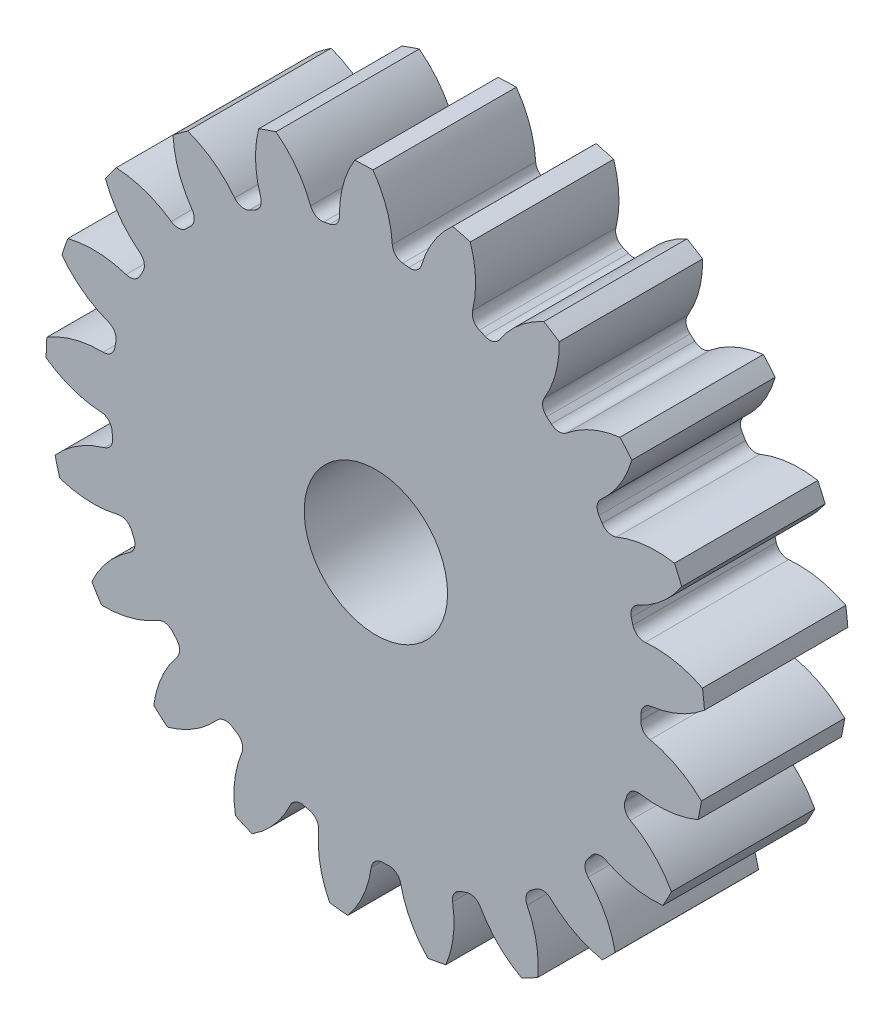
ISO-10303-21;
HEADER;
FILE_DESCRIPTION(('STEP AP214'),'2;1');
FILE_NAME('part.step','',(''),(''),'','','');
FILE_SCHEMA(('AUTOMOTIVE_DESIGN { 1 0 10303 214 1 1 1 1 }'));
ENDSEC;
DATA;
#1=APPLICATION_CONTEXT('core data for automotive mechanical design processes');
#2=APPLICATION_PROTOCOL_DEFINITION('international standard','automotive_design',2000,#1);
#3=PRODUCT_CONTEXT('',#1,'mechanical');
#4=PRODUCT('Part','Part','',(#3));
#5=PRODUCT_RELATED_PRODUCT_CATEGORY('part','',(#4));
#6=PRODUCT_DEFINITION_FORMATION('','',#4);
#7=PRODUCT_DEFINITION_CONTEXT('part definition',#1,'design');
#8=PRODUCT_DEFINITION('design','',#6,#7);
#9=PRODUCT_DEFINITION_SHAPE('','',#8);
#10=(LENGTH_UNIT() NAMED_UNIT(*) SI_UNIT(.MILLI.,.METRE.));
#11=(NAMED_UNIT(*) PLANE_ANGLE_UNIT() SI_UNIT($,.RADIAN.));
#12=(NAMED_UNIT(*) SI_UNIT($,.STERADIAN.) SOLID_ANGLE_UNIT());
#13=UNCERTAINTY_MEASURE_WITH_UNIT(LENGTH_MEASURE(1.E-05),#10,'distance_accuracy_value','');
#14=(GEOMETRIC_REPRESENTATION_CONTEXT(3) GLOBAL_UNCERTAINTY_ASSIGNED_CONTEXT((#13)) GLOBAL_UNIT_ASSIGNED_CONTEXT((#10,
#11,#12)) REPRESENTATION_CONTEXT('',''));
#15=CARTESIAN_POINT('',(0.,0.,0.));
#16=DIRECTION('',(0.,0.,1.));
#17=DIRECTION('',(1.,0.,0.));
#18=AXIS2_PLACEMENT_3D('',#15,#16,#17);
#19=CARTESIAN_POINT('',(0.,0.,101.6));
#20=DIRECTION('',(0.,0.,-1.));
#21=DIRECTION('',(-1.,0.,0.));
#22=AXIS2_PLACEMENT_3D('',#19,#20,#21);
#23=CYLINDRICAL_SURFACE('',#22,233.68);
#24=DIRECTION('',(0.,0.,-1.));
#25=VECTOR('',#24,1.);
#26=CARTESIAN_POINT('',(231.426100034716,32.3775017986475,50.8));
#27=LINE('',#26,#25);
#28=CARTESIAN_POINT('',(231.426100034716,32.3775017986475,101.6));
#29=VERTEX_POINT('',#28);
#30=CARTESIAN_POINT('',(231.426100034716,32.3775017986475,0.));
#31=VERTEX_POINT('',#30);
#32=EDGE_CURVE('E852',#29,#31,#27,.T.);
#33=ORIENTED_EDGE('',*,*,#32,.F.);
#34=CARTESIAN_POINT('',(0.,0.,101.6));
#35=DIRECTION('',(0.,0.,1.));
#36=DIRECTION('',(1.,0.,0.));
#37=AXIS2_PLACEMENT_3D('',#34,#35,#36);
#38=CIRCLE('',#37,233.68);
#39=CARTESIAN_POINT('',(232.862735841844,19.5266140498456,101.6));
#40=VERTEX_POINT('',#39);
#41=EDGE_CURVE('E1611',#40,#29,#38,.T.);
#42=ORIENTED_EDGE('',*,*,#41,.F.);
#43=DIRECTION('',(0.,0.,-1.));
#44=VECTOR('',#43,1.);
#45=CARTESIAN_POINT('',(232.862735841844,19.5266140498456,50.8));
#46=LINE('',#45,#44);
#47=CARTESIAN_POINT('',(232.862735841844,19.5266140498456,0.));
#48=VERTEX_POINT('',#47);
#49=EDGE_CURVE('E1605',#48,#40,#46,.F.);
#50=ORIENTED_EDGE('',*,*,#49,.F.);
#51=CARTESIAN_POINT('',(0.,0.,0.));
#52=DIRECTION('',(0.,0.,1.));
#53=DIRECTION('',(1.,0.,0.));
#54=AXIS2_PLACEMENT_3D('',#51,#52,#53);
#55=CIRCLE('',#54,233.68);
#56=EDGE_CURVE('E1616',#48,#31,#55,.T.);
#57=ORIENTED_EDGE('',*,*,#56,.T.);
#58=EDGE_LOOP('',(#33,#42,#50,#57));
#59=FACE_BOUND('',#58,.T.);
#60=ADVANCED_FACE('F33',(#59),#23,.T.);
#61=DIRECTION('',(0.,0.,-1.));
#62=VECTOR('',#61,1.);
#63=CARTESIAN_POINT('',(216.761727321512,87.296597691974,50.8));
#64=LINE('',#63,#62);
#65=CARTESIAN_POINT('',(216.761727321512,87.296597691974,0.));
#66=VERTEX_POINT('',#65);
#67=CARTESIAN_POINT('',(216.761727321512,87.296597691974,101.6));
#68=VERTEX_POINT('',#67);
#69=EDGE_CURVE('E823',#66,#68,#64,.F.);
#70=ORIENTED_EDGE('',*,*,#69,.F.);
#71=CARTESIAN_POINT('',(211.601051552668,99.1531007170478,0.));
#72=VERTEX_POINT('',#71);
#73=EDGE_CURVE('E1619',#66,#72,#55,.T.);
#74=ORIENTED_EDGE('',*,*,#73,.T.);
#75=DIRECTION('',(0.,0.,-1.));
#76=VECTOR('',#75,1.);
#77=CARTESIAN_POINT('',(211.601051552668,99.1531007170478,50.8));
#78=LINE('',#77,#76);
#79=CARTESIAN_POINT('',(211.601051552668,99.1531007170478,101.6));
#80=VERTEX_POINT('',#79);
#81=EDGE_CURVE('E885',#80,#72,#78,.T.);
#82=ORIENTED_EDGE('',*,*,#81,.F.);
#83=EDGE_CURVE('E1614',#68,#80,#38,.T.);
#84=ORIENTED_EDGE('',*,*,#83,.F.);
#85=EDGE_LOOP('',(#70,#74,#82,#84));
#86=FACE_BOUND('',#85,.T.);
#87=ADVANCED_FACE('F1856',(#86),#23,.T.);
#88=CARTESIAN_POINT('',(0.,0.,101.6));
#89=DIRECTION('',(0.,0.,1.));
#90=DIRECTION('',(1.,0.,0.));
#91=AXIS2_PLACEMENT_3D('',#88,#89,#90);
#92=PLANE('',#91);
#93=CARTESIAN_POINT('',(0.,0.,101.599999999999));
#94=DIRECTION('',(0.,0.,1.));
#95=DIRECTION('',(1.,0.,0.));
#96=AXIS2_PLACEMENT_3D('',#93,#94,#95);
#97=CIRCLE('',#96,50.8);
#98=CARTESIAN_POINT('',(50.8,0.,101.599999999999));
#99=VERTEX_POINT('',#98);
#100=EDGE_CURVE('E840',#99,#99,#97,.T.);
#101=ORIENTED_EDGE('',*,*,#100,.F.);
#102=EDGE_LOOP('',(#101));
#103=FACE_BOUND('',#102,.T.);
#104=ORIENTED_EDGE('',*,*,#41,.T.);
#105=CARTESIAN_POINT('',(197.601373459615,-33.927379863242,101.6));
#106=DIRECTION('',(0.,0.,-1.));
#107=DIRECTION('',(0.955572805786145,0.294755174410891,0.));
#108=AXIS2_PLACEMENT_3D('',#105,#106,#107);
#109=CIRCLE('',#108,74.4341955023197);
#110=CARTESIAN_POINT('',(190.901556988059,40.2046774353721,101.6));
#111=VERTEX_POINT('',#110);
#112=EDGE_CURVE('E832',#111,#29,#109,.T.);
#113=ORIENTED_EDGE('',*,*,#112,.F.);
#114=CARTESIAN_POINT('',(190.157153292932,48.4413474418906,101.6));
#115=DIRECTION('',(0.,0.,1.));
#116=DIRECTION('',(-0.955572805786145,-0.294755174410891,0.));
#117=AXIS2_PLACEMENT_3D('',#114,#115,#116);
#118=CIRCLE('',#117,8.27024000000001);
#119=CARTESIAN_POINT('',(182.142867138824,46.3997580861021,101.6));
#120=VERTEX_POINT('',#119);
#121=EDGE_CURVE('E830',#120,#111,#118,.T.);
#122=ORIENTED_EDGE('',*,*,#121,.F.);
#123=CARTESIAN_POINT('',(0.,0.,101.6));
#124=DIRECTION('',(0.,0.,-1.));
#125=DIRECTION('',(0.955572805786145,0.294755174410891,0.));
#126=AXIS2_PLACEMENT_3D('',#123,#124,#125);
#127=CIRCLE('',#126,187.96);
#128=CARTESIAN_POINT('',(181.02842571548,50.5734187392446,101.6));
#129=VERTEX_POINT('',#128);
#130=EDGE_CURVE('E815',#129,#120,#127,.T.);
#131=ORIENTED_EDGE('',*,*,#130,.F.);
#132=CARTESIAN_POINT('',(188.993676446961,52.7986491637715,101.6));
#133=DIRECTION('',(0.,0.,1.));
#134=DIRECTION('',(-0.955572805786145,-0.294755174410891,0.));
#135=AXIS2_PLACEMENT_3D('',#132,#133,#134);
#136=CIRCLE('',#135,8.27024000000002);
#137=CARTESIAN_POINT('',(185.533067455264,60.3100441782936,101.6));
#138=VERTEX_POINT('',#137);
#139=EDGE_CURVE('E807',#138,#129,#136,.T.);
#140=ORIENTED_EDGE('',*,*,#139,.F.);
#141=CARTESIAN_POINT('',(154.386734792,127.914448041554,101.6));
#142=DIRECTION('',(0.,0.,-1.));
#143=DIRECTION('',(-0.955572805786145,-0.294755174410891,0.));
#144=AXIS2_PLACEMENT_3D('',#141,#142,#143);
#145=CIRCLE('',#144,74.4341955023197);
#146=EDGE_CURVE('E837',#68,#138,#145,.T.);
#147=ORIENTED_EDGE('',*,*,#146,.F.);
#148=ORIENTED_EDGE('',*,*,#83,.T.);
#149=CARTESIAN_POINT('',(198.822769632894,25.8239457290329,101.6));
#150=DIRECTION('',(0.,0.,-1.));
#151=DIRECTION('',(0.826238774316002,0.563320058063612,0.));
#152=AXIS2_PLACEMENT_3D('',#149,#150,#151);
#153=CIRCLE('',#152,74.4341955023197);
#154=CARTESIAN_POINT('',(170.569799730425,94.687718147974,101.6));
#155=VERTEX_POINT('',#154);
#156=EDGE_CURVE('E861',#155,#80,#153,.T.);
#157=ORIENTED_EDGE('',*,*,#156,.F.);
#158=CARTESIAN_POINT('',(167.430666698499,102.339039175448,101.6));
#159=DIRECTION('',(0.,0.,1.));
#160=DIRECTION('',(-0.826238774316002,-0.563320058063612,0.));
#161=AXIS2_PLACEMENT_3D('',#158,#159,#160);
#162=CIRCLE('',#161,8.27024000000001);
#163=CARTESIAN_POINT('',(160.374201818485,98.0258995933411,101.6));
#164=VERTEX_POINT('',#163);
#165=EDGE_CURVE('E859',#164,#155,#162,.T.);
#166=ORIENTED_EDGE('',*,*,#165,.F.);
#167=CARTESIAN_POINT('',(0.,0.,101.6));
#168=DIRECTION('',(0.,0.,-1.));
#169=DIRECTION('',(0.826238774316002,0.563320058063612,0.));
#170=AXIS2_PLACEMENT_3D('',#167,#168,#169);
#171=CIRCLE('',#170,187.96);
#172=CARTESIAN_POINT('',(158.079063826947,101.685648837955,101.6));
#173=VERTEX_POINT('',#172);
#174=EDGE_CURVE('E856',#173,#164,#171,.T.);
#175=ORIENTED_EDGE('',*,*,#174,.F.);
#176=CARTESIAN_POINT('',(165.034542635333,106.159817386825,101.6));
#177=DIRECTION('',(0.,0.,1.));
#178=DIRECTION('',(-0.826238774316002,-0.563320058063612,0.));
#179=AXIS2_PLACEMENT_3D('',#176,#177,#178);
#180=CIRCLE('',#179,8.27024000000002);
#181=CARTESIAN_POINT('',(159.513656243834,112.317469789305,101.6));
#182=VERTEX_POINT('',#181);
#183=EDGE_CURVE('E854',#182,#173,#180,.T.);
#184=ORIENTED_EDGE('',*,*,#183,.F.);
#185=CARTESIAN_POINT('',(109.82431989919,167.737856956,101.6));
#186=DIRECTION('',(0.,0.,-1.));
#187=DIRECTION('',(-0.826238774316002,-0.563320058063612,0.));
#188=AXIS2_PLACEMENT_3D('',#185,#186,#187);
#189=CIRCLE('',#188,74.4341955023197);
#190=CARTESIAN_POINT('',(181.400488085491,147.309895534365,101.6));
#191=VERTEX_POINT('',#190);
#192=EDGE_CURVE('E864',#191,#182,#189,.T.);
#193=ORIENTED_EDGE('',*,*,#192,.F.);
#194=CARTESIAN_POINT('',(172.974321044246,157.118511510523,101.6));
#195=VERTEX_POINT('',#194);
#196=EDGE_CURVE('E1669',#191,#195,#38,.T.);
#197=ORIENTED_EDGE('',*,*,#196,.T.);
#198=CARTESIAN_POINT('',(182.377890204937,83.2807004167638,101.6));
#199=DIRECTION('',(0.,0.,-1.));
#200=DIRECTION('',(0.623489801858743,0.781831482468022,0.));
#201=AXIS2_PLACEMENT_3D('',#198,#199,#200);
#202=CIRCLE('',#201,74.4341955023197);
#203=CARTESIAN_POINT('',(135.082167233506,140.757339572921,101.6));
#204=VERTEX_POINT('',#203);
#205=EDGE_CURVE('E896',#204,#195,#202,.T.);
#206=ORIENTED_EDGE('',*,*,#205,.F.);
#207=CARTESIAN_POINT('',(129.827230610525,147.143458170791,101.6));
#208=DIRECTION('',(0.,0.,1.));
#209=DIRECTION('',(-0.623489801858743,-0.781831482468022,0.));
#210=AXIS2_PLACEMENT_3D('',#207,#208,#209);
#211=CIRCLE('',#210,8.27024000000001);
#212=CARTESIAN_POINT('',(124.355584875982,140.942009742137,101.6));
#213=VERTEX_POINT('',#212);
#214=EDGE_CURVE('E894',#213,#204,#211,.T.);
#215=ORIENTED_EDGE('',*,*,#214,.F.);
#216=CARTESIAN_POINT('',(0.,0.,101.6));
#217=DIRECTION('',(0.,0.,-1.));
#218=DIRECTION('',(0.623489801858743,0.781831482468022,0.));
#219=AXIS2_PLACEMENT_3D('',#216,#217,#218);
#220=CIRCLE('',#219,187.96);
#221=CARTESIAN_POINT('',(121.083683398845,143.762662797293,101.6));
#222=VERTEX_POINT('',#221);
#223=EDGE_CURVE('E891',#222,#213,#220,.T.);
#224=ORIENTED_EDGE('',*,*,#223,.F.);
#225=CARTESIAN_POINT('',(126.411365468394,150.088219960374,101.6));
#226=DIRECTION('',(0.,0.,1.));
#227=DIRECTION('',(-0.623489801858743,-0.781831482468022,0.));
#228=AXIS2_PLACEMENT_3D('',#225,#226,#227);
#229=CIRCLE('',#228,8.27024000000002);
#230=CARTESIAN_POINT('',(119.320756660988,154.344995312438,101.6));
#231=VERTEX_POINT('',#230);
#232=EDGE_CURVE('E889',#231,#222,#229,.T.);
#233=ORIENTED_EDGE('',*,*,#232,.F.);
#234=CARTESIAN_POINT('',(55.5035322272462,192.657021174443,101.6));
#235=DIRECTION('',(0.,0.,-1.));
#236=DIRECTION('',(-0.623489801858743,-0.781831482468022,0.));
#237=AXIS2_PLACEMENT_3D('',#234,#235,#236);
#238=CIRCLE('',#237,74.4341955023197);
#239=CARTESIAN_POINT('',(129.921019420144,194.234062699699,101.6));
#240=VERTEX_POINT('',#239);
#241=EDGE_CURVE('E899',#240,#231,#238,.T.);
#242=ORIENTED_EDGE('',*,*,#241,.F.);
#243=CARTESIAN_POINT('',(118.978063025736,201.123253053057,101.6));
#244=VERTEX_POINT('',#243);
#245=EDGE_CURVE('E1838',#240,#244,#38,.T.);
#246=ORIENTED_EDGE('',*,*,#245,.T.);
#247=CARTESIAN_POINT('',(149.727934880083,133.337599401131,101.6));
#248=DIRECTION('',(0.,0.,-1.));
#249=DIRECTION('',(0.365341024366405,0.9308737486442,0.));
#250=AXIS2_PLACEMENT_3D('',#247,#248,#249);
#251=CIRCLE('',#250,74.4341955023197);
#252=CARTESIAN_POINT('',(87.5918913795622,174.320053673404,101.6));
#253=VERTEX_POINT('',#252);
#254=EDGE_CURVE('E934',#253,#244,#251,.T.);
#255=ORIENTED_EDGE('',*,*,#254,.F.);
#256=CARTESIAN_POINT('',(80.6880753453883,178.873535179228,101.6));
#257=DIRECTION('',(0.,0.,1.));
#258=DIRECTION('',(-0.365341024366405,-0.9308737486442,0.));
#259=AXIS2_PLACEMENT_3D('',#256,#257,#258);
#260=CIRCLE('',#259,8.27024000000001);
#261=CARTESIAN_POINT('',(77.2874284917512,171.334803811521,101.6));
#262=VERTEX_POINT('',#261);
#263=EDGE_CURVE('E932',#262,#253,#260,.T.);
#264=ORIENTED_EDGE('',*,*,#263,.F.);
#265=CARTESIAN_POINT('',(0.,0.,101.6));
#266=DIRECTION('',(0.,0.,-1.));
#267=DIRECTION('',(0.365341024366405,0.9308737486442,0.));
#268=AXIS2_PLACEMENT_3D('',#265,#266,#267);
#269=CIRCLE('',#268,187.96);
#270=CARTESIAN_POINT('',(73.3294863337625,173.065733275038,101.6));
#271=VERTEX_POINT('',#270);
#272=EDGE_CURVE('E929',#271,#262,#269,.T.);
#273=ORIENTED_EDGE('',*,*,#272,.F.);
#274=CARTESIAN_POINT('',(76.555983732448,180.68062553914,101.6));
#275=DIRECTION('',(0.,0.,1.));
#276=DIRECTION('',(-0.365341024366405,-0.9308737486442,0.));
#277=AXIS2_PLACEMENT_3D('',#274,#275,#276);
#278=CIRCLE('',#277,8.27024000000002);
#279=CARTESIAN_POINT('',(68.5256842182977,182.658290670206,101.6));
#280=VERTEX_POINT('',#279);
#281=EDGE_CURVE('E927',#280,#271,#278,.T.);
#282=ORIENTED_EDGE('',*,*,#281,.F.);
#283=CARTESIAN_POINT('',(-3.74898785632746,200.457763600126,101.6));
#284=DIRECTION('',(0.,0.,-1.));
#285=DIRECTION('',(-0.365341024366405,-0.9308737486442,0.));
#286=AXIS2_PLACEMENT_3D('',#283,#284,#285);
#287=CIRCLE('',#286,74.4341955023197);
#288=CARTESIAN_POINT('',(66.8974980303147,223.899681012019,101.6));
#289=VERTEX_POINT('',#288);
#290=EDGE_CURVE('E937',#289,#280,#287,.T.);
#291=ORIENTED_EDGE('',*,*,#290,.F.);
#292=CARTESIAN_POINT('',(54.410081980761,227.257310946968,101.6));
#293=VERTEX_POINT('',#292);
#294=EDGE_CURVE('E1834',#289,#293,#38,.T.);
#295=ORIENTED_EDGE('',*,*,#294,.T.);
#296=CARTESIAN_POINT('',(103.773995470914,171.546867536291,101.6));
#297=DIRECTION('',(0.,0.,-1.));
#298=DIRECTION('',(0.074730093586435,0.997203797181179,0.));
#299=AXIS2_PLACEMENT_3D('',#296,#297,#298);
#300=CIRCLE('',#299,74.4341955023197);
#301=CARTESIAN_POINT('',(32.3186915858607,192.393666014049,101.6));
#302=VERTEX_POINT('',#301);
#303=EDGE_CURVE('E972',#302,#293,#300,.T.);
#304=ORIENTED_EDGE('',*,*,#303,.F.);
#305=CARTESIAN_POINT('',(24.3794304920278,194.709913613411,101.6));
#306=DIRECTION('',(0.,0.,1.));
#307=DIRECTION('',(-0.074730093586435,-0.997203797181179,0.));
#308=AXIS2_PLACEMENT_3D('',#305,#306,#307);
#309=CIRCLE('',#308,8.27024000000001);
#310=CARTESIAN_POINT('',(23.3519449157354,186.50374867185,101.6));
#311=VERTEX_POINT('',#310);
#312=EDGE_CURVE('E970',#311,#302,#309,.T.);
#313=ORIENTED_EDGE('',*,*,#312,.F.);
#314=CARTESIAN_POINT('',(0.,0.,101.6));
#315=DIRECTION('',(0.,0.,-1.));
#316=DIRECTION('',(0.074730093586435,0.997203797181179,0.));
#317=AXIS2_PLACEMENT_3D('',#314,#315,#316);
#318=CIRCLE('',#317,187.96);
#319=CARTESIAN_POINT('',(19.0596426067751,186.991153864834,101.6));
#320=VERTEX_POINT('',#319);
#321=EDGE_CURVE('E967',#320,#311,#318,.T.);
#322=ORIENTED_EDGE('',*,*,#321,.F.);
#323=CARTESIAN_POINT('',(19.8982668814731,195.218764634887,101.6));
#324=DIRECTION('',(0.,0.,1.));
#325=DIRECTION('',(-0.074730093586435,-0.997203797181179,0.));
#326=AXIS2_PLACEMENT_3D('',#323,#324,#325);
#327=CIRCLE('',#326,8.27024000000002);
#328=CARTESIAN_POINT('',(11.6418040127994,194.74159531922,101.6));
#329=VERTEX_POINT('',#328);
#330=EDGE_CURVE('E965',#329,#320,#327,.T.);
#331=ORIENTED_EDGE('',*,*,#330,.F.);
#332=CARTESIAN_POINT('',(-62.668393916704,190.446954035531,101.6));
#333=DIRECTION('',(0.,0.,-1.));
#334=DIRECTION('',(-0.074730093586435,-0.997203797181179,0.));
#335=AXIS2_PLACEMENT_3D('',#332,#333,#334);
#336=CIRCLE('',#335,74.4341955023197);
#337=CARTESIAN_POINT('',(-2.07015963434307,233.670830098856,101.6));
#338=VERTEX_POINT('',#337);
#339=EDGE_CURVE('E975',#338,#329,#336,.T.);
#340=ORIENTED_EDGE('',*,*,#339,.F.);
#341=CARTESIAN_POINT('',(-14.9924736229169,233.198559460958,101.6));
#342=VERTEX_POINT('',#341);
#343=EDGE_CURVE('E1830',#338,#342,#38,.T.);
#344=ORIENTED_EDGE('',*,*,#343,.T.);
#345=CARTESIAN_POINT('',(48.5992811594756,194.513443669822,101.6));
#346=DIRECTION('',(0.,0.,-1.));
#347=DIRECTION('',(-0.222520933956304,0.974927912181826,0.));
#348=AXIS2_PLACEMENT_3D('',#345,#346,#347);
#349=CIRCLE('',#348,74.4341955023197);
#350=CARTESIAN_POINT('',(-25.8261657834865,193.372256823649,101.6));
#351=VERTEX_POINT('',#350);
#352=EDGE_CURVE('E1010',#351,#342,#349,.T.);
#353=ORIENTED_EDGE('',*,*,#352,.F.);
#354=CARTESIAN_POINT('',(-34.095433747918,193.24546175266,101.6));
#355=DIRECTION('',(0.,0.,1.));
#356=DIRECTION('',(0.222520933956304,-0.974927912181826,0.));
#357=AXIS2_PLACEMENT_3D('',#354,#355,#356);
#358=CIRCLE('',#357,8.27024000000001);
#359=CARTESIAN_POINT('',(-32.6584614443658,185.101017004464,101.6));
#360=VERTEX_POINT('',#359);
#361=EDGE_CURVE('E1008',#360,#351,#358,.T.);
#362=ORIENTED_EDGE('',*,*,#361,.F.);
#363=CARTESIAN_POINT('',(0.,0.,101.6));
#364=DIRECTION('',(0.,0.,-1.));
#365=DIRECTION('',(-0.222520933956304,0.974927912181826,0.));
#366=AXIS2_PLACEMENT_3D('',#363,#364,#365);
#367=CIRCLE('',#366,187.96);
#368=CARTESIAN_POINT('',(-36.9037340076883,184.301589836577,101.6));
#369=VERTEX_POINT('',#368);
#370=EDGE_CURVE('E1005',#369,#360,#367,.T.);
#371=ORIENTED_EDGE('',*,*,#370,.F.);
#372=CARTESIAN_POINT('',(-38.5274983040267,192.410859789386,101.6));
#373=DIRECTION('',(0.,0.,1.));
#374=DIRECTION('',(0.222520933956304,-0.974927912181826,0.));
#375=AXIS2_PLACEMENT_3D('',#372,#373,#374);
#376=CIRCLE('',#375,8.27024000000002);
#377=CARTESIAN_POINT('',(-46.2765015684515,189.521254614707,101.6));
#378=VERTEX_POINT('',#377);
#379=EDGE_CURVE('E1003',#378,#369,#376,.T.);
#380=ORIENTED_EDGE('',*,*,#379,.F.);
#381=CARTESIAN_POINT('',(-116.019438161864,163.514096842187,101.6));
#382=DIRECTION('',(0.,0.,-1.));
#383=DIRECTION('',(0.222520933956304,-0.974927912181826,0.));
#384=AXIS2_PLACEMENT_3D('',#381,#382,#383);
#385=CIRCLE('',#384,74.4341955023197);
#386=CARTESIAN_POINT('',(-70.8538745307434,222.679300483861,101.6));
#387=VERTEX_POINT('',#386);
#388=EDGE_CURVE('E1013',#387,#378,#385,.T.);
#389=ORIENTED_EDGE('',*,*,#388,.F.);
#390=CARTESIAN_POINT('',(-83.0628821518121,218.41909259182,101.6));
#391=VERTEX_POINT('',#390);
#392=EDGE_CURVE('E1826',#387,#391,#38,.T.);
#393=ORIENTED_EDGE('',*,*,#392,.T.);
#394=CARTESIAN_POINT('',(-10.8936925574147,200.196646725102,101.6));
#395=DIRECTION('',(0.,0.,-1.));
#396=DIRECTION('',(-0.499999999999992,0.866025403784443,0.));
#397=AXIS2_PLACEMENT_3D('',#394,#395,#396);
#398=CIRCLE('',#397,74.4341955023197);
#399=CARTESIAN_POINT('',(-81.6762549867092,177.168874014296,101.6));
#400=VERTEX_POINT('',#399);
#401=EDGE_CURVE('E1048',#400,#391,#398,.T.);
#402=ORIENTED_EDGE('',*,*,#401,.F.);
#403=CARTESIAN_POINT('',(-89.5407690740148,174.610302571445,101.6));
#404=DIRECTION('',(0.,0.,1.));
#405=DIRECTION('',(0.499999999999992,-0.866025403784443,0.));
#406=AXIS2_PLACEMENT_3D('',#403,#404,#405);
#407=CIRCLE('',#406,8.27024000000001);
#408=CARTESIAN_POINT('',(-85.7670201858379,167.251247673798,101.6));
#409=VERTEX_POINT('',#408);
#410=EDGE_CURVE('E1046',#409,#400,#407,.T.);
#411=ORIENTED_EDGE('',*,*,#410,.F.);
#412=CARTESIAN_POINT('',(0.,0.,101.6));
#413=DIRECTION('',(0.,0.,-1.));
#414=DIRECTION('',(-0.499999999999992,0.866025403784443,0.));
#415=AXIS2_PLACEMENT_3D('',#412,#413,#414);
#416=CIRCLE('',#415,187.96);
#417=CARTESIAN_POINT('',(-89.5880519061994,165.236020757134,101.6));
#418=VERTEX_POINT('',#417);
#419=EDGE_CURVE('E1043',#418,#409,#416,.T.);
#420=ORIENTED_EDGE('',*,*,#419,.F.);
#421=CARTESIAN_POINT('',(-93.5299261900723,172.506405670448,101.6));
#422=DIRECTION('',(0.,0.,1.));
#423=DIRECTION('',(0.499999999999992,-0.866025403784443,0.));
#424=AXIS2_PLACEMENT_3D('',#421,#422,#423);
#425=CIRCLE('',#424,8.27024000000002);
#426=CARTESIAN_POINT('',(-100.082936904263,167.461118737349,101.6));
#427=VERTEX_POINT('',#426);
#428=EDGE_CURVE('E1041',#427,#418,#425,.T.);
#429=ORIENTED_EDGE('',*,*,#428,.F.);
#430=CARTESIAN_POINT('',(-159.061646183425,122.05229457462,101.6));
#431=DIRECTION('',(0.,0.,-1.));
#432=DIRECTION('',(0.499999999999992,-0.866025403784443,0.));
#433=AXIS2_PLACEMENT_3D('',#430,#431,#432);
#434=CIRCLE('',#433,74.4341955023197);
#435=CARTESIAN_POINT('',(-133.341911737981,191.90173780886,101.6));
#436=VERTEX_POINT('',#435);
#437=EDGE_CURVE('E1051',#436,#427,#434,.T.);
#438=ORIENTED_EDGE('',*,*,#437,.F.);
#439=CARTESIAN_POINT('',(-143.752789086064,184.232130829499,101.6));
#440=VERTEX_POINT('',#439);
#441=EDGE_CURVE('E1822',#436,#440,#38,.T.);
#442=ORIENTED_EDGE('',*,*,#441,.T.);
#443=CARTESIAN_POINT('',(-69.4187138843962,188.091499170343,101.6));
#444=DIRECTION('',(0.,0.,-1.));
#445=DIRECTION('',(-0.73305187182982,0.680172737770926,0.));
#446=AXIS2_PLACEMENT_3D('',#443,#444,#445);
#447=CIRCLE('',#446,74.4341955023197);
#448=CARTESIAN_POINT('',(-130.269050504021,145.223259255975,101.6));
#449=VERTEX_POINT('',#448);
#450=EDGE_CURVE('E1086',#449,#440,#447,.T.);
#451=ORIENTED_EDGE('',*,*,#450,.F.);
#452=CARTESIAN_POINT('',(-137.030014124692,140.460251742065,101.6));
#453=DIRECTION('',(0.,0.,1.));
#454=DIRECTION('',(0.73305187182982,-0.680172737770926,0.));
#455=AXIS2_PLACEMENT_3D('',#452,#453,#454);
#456=CIRCLE('',#455,8.27024000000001);
#457=CARTESIAN_POINT('',(-131.254802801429,134.540471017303,101.6));
#458=VERTEX_POINT('',#457);
#459=EDGE_CURVE('E1084',#458,#449,#456,.T.);
#460=ORIENTED_EDGE('',*,*,#459,.F.);
#461=CARTESIAN_POINT('',(0.,0.,101.6));
#462=DIRECTION('',(0.,0.,-1.));
#463=DIRECTION('',(-0.73305187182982,0.680172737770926,0.));
#464=AXIS2_PLACEMENT_3D('',#461,#462,#463);
#465=CIRCLE('',#464,187.96);
#466=CARTESIAN_POINT('',(-134.312078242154,131.488506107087,101.6));
#467=VERTEX_POINT('',#466);
#468=EDGE_CURVE('E1081',#467,#458,#465,.T.);
#469=ORIENTED_EDGE('',*,*,#468,.F.);
#470=CARTESIAN_POINT('',(-140.221809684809,137.274000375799,101.6));
#471=DIRECTION('',(0.,0.,1.));
#472=DIRECTION('',(0.73305187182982,-0.680172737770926,0.));
#473=AXIS2_PLACEMENT_3D('',#470,#471,#472);
#474=CIRCLE('',#473,8.27024000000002);
#475=CARTESIAN_POINT('',(-144.996564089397,130.521327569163,101.6));
#476=VERTEX_POINT('',#475);
#477=EDGE_CURVE('E1079',#476,#467,#474,.T.);
#478=ORIENTED_EDGE('',*,*,#477,.F.);
#479=CARTESIAN_POINT('',(-187.970528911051,69.7456103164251,101.6));
#480=DIRECTION('',(0.,0.,-1.));
#481=DIRECTION('',(0.73305187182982,-0.680172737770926,0.));
#482=AXIS2_PLACEMENT_3D('',#479,#480,#481);
#483=CIRCLE('',#482,74.4341955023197);
#484=CARTESIAN_POINT('',(-183.981934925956,144.072863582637,101.6));
#485=VERTEX_POINT('',#484);
#486=EDGE_CURVE('E1089',#485,#476,#483,.T.);
#487=ORIENTED_EDGE('',*,*,#486,.F.);
#488=CARTESIAN_POINT('',(-191.669629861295,133.675335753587,101.6));
#489=VERTEX_POINT('',#488);
#490=EDGE_CURVE('E1818',#485,#489,#38,.T.);
#491=ORIENTED_EDGE('',*,*,#490,.T.);
#492=CARTESIAN_POINT('',(-121.775577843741,159.273596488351,101.6));
#493=DIRECTION('',(0.,0.,-1.));
#494=DIRECTION('',(-0.900968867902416,0.433883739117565,0.));
#495=AXIS2_PLACEMENT_3D('',#492,#493,#494);
#496=CIRCLE('',#495,74.4341955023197);
#497=CARTESIAN_POINT('',(-167.286869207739,100.373920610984,101.6));
#498=VERTEX_POINT('',#497);
#499=EDGE_CURVE('E1124',#498,#489,#496,.T.);
#500=ORIENTED_EDGE('',*,*,#499,.F.);
#501=CARTESIAN_POINT('',(-172.343541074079,93.8296911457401,101.6));
#502=DIRECTION('',(0.,0.,1.));
#503=DIRECTION('',(0.900968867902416,-0.433883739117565,0.));
#504=AXIS2_PLACEMENT_3D('',#501,#502,#503);
#505=CIRCLE('',#504,8.27024000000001);
#506=CARTESIAN_POINT('',(-165.080020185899,89.8751830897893,101.6));
#507=VERTEX_POINT('',#506);
#508=EDGE_CURVE('E1122',#507,#498,#505,.T.);
#509=ORIENTED_EDGE('',*,*,#508,.F.);
#510=CARTESIAN_POINT('',(0.,0.,101.6));
#511=DIRECTION('',(0.,0.,-1.));
#512=DIRECTION('',(-0.900968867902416,0.433883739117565,0.));
#513=AXIS2_PLACEMENT_3D('',#510,#511,#512);
#514=CIRCLE('',#513,187.96);
#515=CARTESIAN_POINT('',(-167.101887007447,86.0576606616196,101.6));
#516=VERTEX_POINT('',#515);
#517=EDGE_CURVE('E1119',#516,#507,#514,.T.);
#518=ORIENTED_EDGE('',*,*,#517,.F.);
#519=CARTESIAN_POINT('',(-174.454370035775,89.8441977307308,101.6));
#520=DIRECTION('',(0.,0.,1.));
#521=DIRECTION('',(0.900968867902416,-0.433883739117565,0.));
#522=AXIS2_PLACEMENT_3D('',#519,#520,#521);
#523=CIRCLE('',#522,8.27024000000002);
#524=CARTESIAN_POINT('',(-177.026610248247,81.9841436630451,101.6));
#525=VERTEX_POINT('',#524);
#526=EDGE_CURVE('E1117',#525,#516,#523,.T.);
#527=ORIENTED_EDGE('',*,*,#526,.F.);
#528=CARTESIAN_POINT('',(-200.177405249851,11.2417225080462,101.6));
#529=DIRECTION('',(0.,0.,-1.));
#530=DIRECTION('',(0.900968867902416,-0.433883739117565,0.));
#531=AXIS2_PLACEMENT_3D('',#528,#529,#530);
#532=CIRCLE('',#531,74.4341955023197);
#533=CARTESIAN_POINT('',(-218.274355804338,83.4424831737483,101.6));
#534=VERTEX_POINT('',#533);
#535=EDGE_CURVE('E1127',#534,#525,#532,.T.);
#536=ORIENTED_EDGE('',*,*,#535,.F.);
#537=CARTESIAN_POINT('',(-222.555782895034,71.2409004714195,101.6));
#538=VERTEX_POINT('',#537);
#539=EDGE_CURVE('E1814',#534,#538,#38,.T.);
#540=ORIENTED_EDGE('',*,*,#539,.T.);
#541=CARTESIAN_POINT('',(-163.312147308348,116.303535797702,101.6));
#542=DIRECTION('',(0.,0.,-1.));
#543=DIRECTION('',(-0.988830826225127,0.149042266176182,0.));
#544=AXIS2_PLACEMENT_3D('',#541,#542,#543);
#545=CIRCLE('',#544,74.4341955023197);
#546=CARTESIAN_POINT('',(-189.440515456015,46.6059186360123,101.6));
#547=VERTEX_POINT('',#546);
#548=EDGE_CURVE('E1162',#547,#538,#545,.T.);
#549=ORIENTED_EDGE('',*,*,#548,.F.);
#550=CARTESIAN_POINT('',(-192.34358808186,38.8619507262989,101.6));
#551=DIRECTION('',(0.,0.,1.));
#552=DIRECTION('',(0.988830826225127,-0.149042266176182,0.));
#553=AXIS2_PLACEMENT_3D('',#550,#551,#552);
#554=CIRCLE('',#553,8.27024000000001);
#555=CARTESIAN_POINT('',(-184.237153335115,37.2240907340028,101.6));
#556=VERTEX_POINT('',#555);
#557=EDGE_CURVE('E1160',#556,#547,#554,.T.);
#558=ORIENTED_EDGE('',*,*,#557,.F.);
#559=CARTESIAN_POINT('',(0.,0.,101.6));
#560=DIRECTION('',(0.,0.,-1.));
#561=DIRECTION('',(-0.988830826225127,0.149042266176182,0.));
#562=AXIS2_PLACEMENT_3D('',#559,#560,#561);
#563=CIRCLE('',#562,187.96);
#564=CARTESIAN_POINT('',(-185.043959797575,32.9802144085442,101.6));
#565=VERTEX_POINT('',#564);
#566=EDGE_CURVE('E1157',#565,#556,#563,.T.);
#567=ORIENTED_EDGE('',*,*,#566,.F.);
#568=CARTESIAN_POINT('',(-193.185894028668,34.4313438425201,101.6));
#569=DIRECTION('',(0.,0.,1.));
#570=DIRECTION('',(0.988830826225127,-0.149042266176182,0.));
#571=AXIS2_PLACEMENT_3D('',#568,#569,#570);
#572=CIRCLE('',#571,8.27024000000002);
#573=CARTESIAN_POINT('',(-193.327065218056,26.162308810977,101.6));
#574=VERTEX_POINT('',#573);
#575=EDGE_CURVE('E1155',#574,#565,#572,.T.);
#576=ORIENTED_EDGE('',*,*,#575,.F.);
#577=CARTESIAN_POINT('',(-194.597640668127,-48.2610416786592,101.6));
#578=DIRECTION('',(0.,0.,-1.));
#579=DIRECTION('',(0.988830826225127,-0.149042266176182,0.));
#580=AXIS2_PLACEMENT_3D('',#577,#578,#579);
#581=CIRCLE('',#580,74.4341955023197);
#582=CARTESIAN_POINT('',(-233.172142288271,15.3978719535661,101.6));
#583=VERTEX_POINT('',#582);
#584=EDGE_CURVE('E1165',#583,#574,#581,.T.);
#585=ORIENTED_EDGE('',*,*,#584,.F.);
#586=CARTESIAN_POINT('',(-233.666877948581,2.4763985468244,101.6));
#587=VERTEX_POINT('',#586);
#588=EDGE_CURVE('E1810',#583,#587,#38,.T.);
#589=ORIENTED_EDGE('',*,*,#588,.T.);
#590=CARTESIAN_POINT('',(-190.337715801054,62.9993955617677,101.6));
#591=DIRECTION('',(0.,0.,-1.));
#592=DIRECTION('',(-0.98883082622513,-0.149042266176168,0.));
#593=AXIS2_PLACEMENT_3D('',#590,#591,#592);
#594=CIRCLE('',#593,74.4341955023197);
#595=CARTESIAN_POINT('',(-194.761540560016,-11.3032237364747,101.6));
#596=VERTEX_POINT('',#595);
#597=EDGE_CURVE('E1200',#596,#587,#594,.T.);
#598=ORIENTED_EDGE('',*,*,#597,.F.);
#599=CARTESIAN_POINT('',(-195.253063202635,-19.5588445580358,101.6));
#600=DIRECTION('',(0.,0.,1.));
#601=DIRECTION('',(0.98883082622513,0.149042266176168,0.));
#602=AXIS2_PLACEMENT_3D('',#599,#600,#601);
#603=CIRCLE('',#602,8.27024000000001);
#604=CARTESIAN_POINT('',(-187.024006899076,-18.7345254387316,101.6));
#605=VERTEX_POINT('',#604);
#606=EDGE_CURVE('E1198',#605,#596,#603,.T.);
#607=ORIENTED_EDGE('',*,*,#606,.F.);
#608=CARTESIAN_POINT('',(0.,0.,101.6));
#609=DIRECTION('',(0.,0.,-1.));
#610=DIRECTION('',(-0.98883082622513,-0.149042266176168,0.));
#611=AXIS2_PLACEMENT_3D('',#608,#609,#610);
#612=CIRCLE('',#611,187.96);
#613=CARTESIAN_POINT('',(-186.544064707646,-23.0276686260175,101.6));
#614=VERTEX_POINT('',#613);
#615=EDGE_CURVE('E1195',#614,#605,#612,.T.);
#616=ORIENTED_EDGE('',*,*,#615,.F.);
#617=CARTESIAN_POINT('',(-194.752003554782,-24.0408860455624,101.6));
#618=DIRECTION('',(0.,0.,1.));
#619=DIRECTION('',(0.98883082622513,0.149042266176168,0.));
#620=AXIS2_PLACEMENT_3D('',#617,#618,#619);
#621=CIRCLE('',#620,8.27024000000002);
#622=CARTESIAN_POINT('',(-192.449562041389,-31.9841619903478,101.6));
#623=VERTEX_POINT('',#622);
#624=EDGE_CURVE('E1193',#623,#614,#621,.T.);
#625=ORIENTED_EDGE('',*,*,#624,.F.);
#626=CARTESIAN_POINT('',(-171.727021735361,-103.475600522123,101.6));
#627=DIRECTION('',(0.,0.,-1.));
#628=DIRECTION('',(0.98883082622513,0.149042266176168,0.));
#629=AXIS2_PLACEMENT_3D('',#626,#627,#628);
#630=CIRCLE('',#629,74.4341955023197);
#631=CARTESIAN_POINT('',(-227.351560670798,-54.0149077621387,101.6));
#632=VERTEX_POINT('',#631);
#633=EDGE_CURVE('E1203',#632,#623,#630,.T.);
#634=ORIENTED_EDGE('',*,*,#633,.F.);
#635=CARTESIAN_POINT('',(-224.015645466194,-66.5081422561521,101.6));
#636=VERTEX_POINT('',#635);
#637=EDGE_CURVE('E1806',#632,#636,#38,.T.);
#638=ORIENTED_EDGE('',*,*,#637,.T.);
#639=CARTESIAN_POINT('',(-200.450942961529,4.0974825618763,101.6));
#640=DIRECTION('',(0.,0.,-1.));
#641=DIRECTION('',(-0.900968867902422,-0.433883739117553,0.));
#642=AXIS2_PLACEMENT_3D('',#639,#640,#641);
#643=CIRCLE('',#642,74.4341955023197);
#644=CARTESIAN_POINT('',(-182.777148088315,-68.2080250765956,101.6));
#645=VERTEX_POINT('',#644);
#646=EDGE_CURVE('E1238',#645,#636,#643,.T.);
#647=ORIENTED_EDGE('',*,*,#646,.F.);
#648=CARTESIAN_POINT('',(-180.813446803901,-76.2417506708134,101.6));
#649=DIRECTION('',(0.,0.,1.));
#650=DIRECTION('',(0.900968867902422,0.433883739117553,0.));
#651=AXIS2_PLACEMENT_3D('',#648,#649,#650);
#652=CIRCLE('',#651,8.27024000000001);
#653=CARTESIAN_POINT('',(-173.192956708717,-73.0284968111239,101.6));
#654=VERTEX_POINT('',#653);
#655=EDGE_CURVE('E1236',#654,#645,#652,.T.);
#656=ORIENTED_EDGE('',*,*,#655,.F.);
#657=CARTESIAN_POINT('',(0.,0.,101.6));
#658=DIRECTION('',(0.,0.,-1.));
#659=DIRECTION('',(-0.900968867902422,-0.433883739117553,0.));
#660=AXIS2_PLACEMENT_3D('',#657,#658,#659);
#661=CIRCLE('',#660,187.96);
#662=CARTESIAN_POINT('',(-171.468910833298,-76.9894422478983,101.6));
#663=VERTEX_POINT('',#662);
#664=EDGE_CURVE('E1233',#663,#654,#661,.T.);
#665=ORIENTED_EDGE('',*,*,#664,.F.);
#666=CARTESIAN_POINT('',(-179.013542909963,-80.3769777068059,101.6));
#667=DIRECTION('',(0.,0.,1.));
#668=DIRECTION('',(0.900968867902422,0.433883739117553,0.));
#669=AXIS2_PLACEMENT_3D('',#666,#667,#668);
#670=CIRCLE('',#669,8.27024000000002);
#671=CARTESIAN_POINT('',(-174.472070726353,-87.2886996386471,101.6));
#672=VERTEX_POINT('',#671);
#673=EDGE_CURVE('E1231',#672,#663,#670,.T.);
#674=ORIENTED_EDGE('',*,*,#673,.F.);
#675=CARTESIAN_POINT('',(-133.597703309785,-149.495898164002,101.6));
#676=DIRECTION('',(0.,0.,-1.));
#677=DIRECTION('',(0.900968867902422,0.433883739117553,0.));
#678=AXIS2_PLACEMENT_3D('',#675,#676,#677);
#679=CIRCLE('',#678,74.4341955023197);
#680=CARTESIAN_POINT('',(-201.329795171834,-118.628225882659,101.6));
#681=VERTEX_POINT('',#680);
#682=EDGE_CURVE('E1241',#681,#672,#679,.T.);
#683=ORIENTED_EDGE('',*,*,#682,.F.);
#684=CARTESIAN_POINT('',(-194.459639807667,-129.583142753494,101.6));
#685=VERTEX_POINT('',#684);
#686=EDGE_CURVE('E1802',#681,#685,#38,.T.);
#687=ORIENTED_EDGE('',*,*,#686,.T.);
#688=CARTESIAN_POINT('',(-192.753224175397,-55.1685097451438,101.6));
#689=DIRECTION('',(0.,0.,-1.));
#690=DIRECTION('',(-0.73305187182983,-0.680172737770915,0.));
#691=AXIS2_PLACEMENT_3D('',#688,#689,#690);
#692=CIRCLE('',#691,74.4341955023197);
#693=CARTESIAN_POINT('',(-154.552203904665,-119.052244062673,101.6));
#694=VERTEX_POINT('',#693);
#695=EDGE_CURVE('E1276',#694,#685,#692,.T.);
#696=ORIENTED_EDGE('',*,*,#695,.F.);
#697=CARTESIAN_POINT('',(-150.307762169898,-126.150242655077,101.6));
#698=DIRECTION('',(0.,0.,1.));
#699=DIRECTION('',(0.73305187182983,0.680172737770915,0.));
#700=AXIS2_PLACEMENT_3D('',#697,#698,#699);
#701=CIRCLE('',#700,8.27024000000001);
#702=CARTESIAN_POINT('',(-143.972952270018,-120.833565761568,101.6));
#703=VERTEX_POINT('',#702);
#704=EDGE_CURVE('E1274',#703,#694,#701,.T.);
#705=ORIENTED_EDGE('',*,*,#704,.F.);
#706=CARTESIAN_POINT('',(0.,0.,101.6));
#707=DIRECTION('',(0.,0.,-1.));
#708=DIRECTION('',(-0.73305187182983,-0.680172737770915,0.));
#709=AXIS2_PLACEMENT_3D('',#706,#707,#708);
#710=CIRCLE('',#709,187.96);
#711=CARTESIAN_POINT('',(-141.157991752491,-124.110366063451,101.6));
#712=VERTEX_POINT('',#711);
#713=EDGE_CURVE('E1271',#712,#703,#710,.T.);
#714=ORIENTED_EDGE('',*,*,#713,.F.);
#715=CARTESIAN_POINT('',(-147.3689433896,-129.571222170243,101.6));
#716=DIRECTION('',(0.,0.,1.));
#717=DIRECTION('',(0.73305187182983,0.680172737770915,0.));
#718=AXIS2_PLACEMENT_3D('',#715,#716,#717);
#719=CIRCLE('',#718,8.27024000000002);
#720=CARTESIAN_POINT('',(-140.991970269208,-134.837253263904,101.6));
#721=VERTEX_POINT('',#720);
#722=EDGE_CURVE('E1269',#721,#712,#719,.T.);
#723=ORIENTED_EDGE('',*,*,#722,.F.);
#724=CARTESIAN_POINT('',(-83.5976426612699,-182.232829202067,101.6));
#725=DIRECTION('',(0.,0.,-1.));
#726=DIRECTION('',(0.73305187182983,0.680172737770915,0.));
#727=AXIS2_PLACEMENT_3D('',#724,#725,#726);
#728=CIRCLE('',#727,74.4341955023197);
#729=CARTESIAN_POINT('',(-157.418993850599,-172.70090554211,101.6));
#730=VERTEX_POINT('',#729);
#731=EDGE_CURVE('E1279',#730,#721,#728,.T.);
#732=ORIENTED_EDGE('',*,*,#731,.F.);
#733=CARTESIAN_POINT('',(-147.625041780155,-181.144112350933,101.6));
#734=VERTEX_POINT('',#733);
#735=EDGE_CURVE('E1798',#730,#734,#38,.T.);
#736=ORIENTED_EDGE('',*,*,#735,.T.);
#737=CARTESIAN_POINT('',(-167.92853553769,-109.532537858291,101.6));
#738=DIRECTION('',(0.,0.,-1.));
#739=DIRECTION('',(-0.500000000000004,-0.866025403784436,0.));
#740=AXIS2_PLACEMENT_3D('',#737,#738,#739);
#741=CIRCLE('',#740,74.4341955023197);
#742=CARTESIAN_POINT('',(-112.59461816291,-159.318148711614,101.6));
#743=VERTEX_POINT('',#742);
#744=EDGE_CURVE('E1314',#743,#734,#741,.T.);
#745=ORIENTED_EDGE('',*,*,#744,.F.);
#746=CARTESIAN_POINT('',(-106.44657325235,-164.849731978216,101.6));
#747=DIRECTION('',(0.,0.,1.));
#748=DIRECTION('',(0.500000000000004,0.866025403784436,0.));
#749=AXIS2_PLACEMENT_3D('',#746,#747,#748);
#750=CIRCLE('',#749,8.27024000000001);
#751=CARTESIAN_POINT('',(-101.960319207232,-157.902042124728,101.6));
#752=VERTEX_POINT('',#751);
#753=EDGE_CURVE('E1312',#752,#743,#750,.T.);
#754=ORIENTED_EDGE('',*,*,#753,.F.);
#755=CARTESIAN_POINT('',(0.,0.,101.6));
#756=DIRECTION('',(0.,0.,-1.));
#757=DIRECTION('',(-0.500000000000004,-0.866025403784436,0.));
#758=AXIS2_PLACEMENT_3D('',#755,#756,#757);
#759=CIRCLE('',#758,187.96);
#760=CARTESIAN_POINT('',(-98.3045656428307,-160.203539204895,101.6));
#761=VERTEX_POINT('',#760);
#762=EDGE_CURVE('E1309',#761,#752,#759,.T.);
#763=ORIENTED_EDGE('',*,*,#762,.F.);
#764=CARTESIAN_POINT('',(-102.629966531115,-167.252494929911,101.6));
#765=DIRECTION('',(0.,0.,1.));
#766=DIRECTION('',(0.500000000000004,0.866025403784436,0.));
#767=AXIS2_PLACEMENT_3D('',#764,#765,#766);
#768=CIRCLE('',#767,8.27024000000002);
#769=CARTESIAN_POINT('',(-94.9841145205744,-170.404925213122,101.6));
#770=VERTEX_POINT('',#769);
#771=EDGE_CURVE('E1307',#770,#761,#768,.T.);
#772=ORIENTED_EDGE('',*,*,#771,.F.);
#773=CARTESIAN_POINT('',(-26.1695646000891,-198.777573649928,101.6));
#774=DIRECTION('',(0.,0.,-1.));
#775=DIRECTION('',(0.500000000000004,0.866025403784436,0.));
#776=AXIS2_PLACEMENT_3D('',#773,#774,#775);
#777=CIRCLE('',#776,74.4341955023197);
#778=CARTESIAN_POINT('',(-99.5208241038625,-211.428351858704,101.6));
#779=VERTEX_POINT('',#778);
#780=EDGE_CURVE('E1317',#779,#770,#777,.T.);
#781=ORIENTED_EDGE('',*,*,#780,.F.);
#782=CARTESIAN_POINT('',(-87.673310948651,-216.609632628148,101.6));
#783=VERTEX_POINT('',#782);
#784=EDGE_CURVE('E1794',#779,#783,#38,.T.);
#785=ORIENTED_EDGE('',*,*,#784,.T.);
#786=CARTESIAN_POINT('',(-128.182659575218,-154.164119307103,101.6));
#787=DIRECTION('',(0.,0.,-1.));
#788=DIRECTION('',(-0.222520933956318,-0.974927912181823,0.));
#789=AXIS2_PLACEMENT_3D('',#786,#787,#788);
#790=CIRCLE('',#789,74.4341955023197);
#791=CARTESIAN_POINT('',(-60.6325064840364,-185.427936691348,101.6));
#792=VERTEX_POINT('',#791);
#793=EDGE_CURVE('E1352',#792,#783,#790,.T.);
#794=ORIENTED_EDGE('',*,*,#793,.F.);
#795=CARTESIAN_POINT('',(-53.1271391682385,-188.901599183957,101.6));
#796=DIRECTION('',(0.,0.,1.));
#797=DIRECTION('',(0.222520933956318,0.974927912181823,0.));
#798=AXIS2_PLACEMENT_3D('',#795,#796,#797);
#799=CIRCLE('',#798,8.27024000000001);
#800=CARTESIAN_POINT('',(-50.8880643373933,-180.940229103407,101.6));
#801=VERTEX_POINT('',#800);
#802=EDGE_CURVE('E1350',#801,#792,#799,.T.);
#803=ORIENTED_EDGE('',*,*,#802,.F.);
#804=CARTESIAN_POINT('',(0.,0.,101.6));
#805=DIRECTION('',(0.,0.,-1.));
#806=DIRECTION('',(-0.222520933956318,-0.974927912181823,0.));
#807=AXIS2_PLACEMENT_3D('',#804,#805,#806);
#808=CIRCLE('',#807,187.96);
#809=CARTESIAN_POINT('',(-46.7163474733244,-182.061924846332,101.6));
#810=VERTEX_POINT('',#809);
#811=EDGE_CURVE('E1347',#810,#801,#808,.T.);
#812=ORIENTED_EDGE('',*,*,#811,.F.);
#813=CARTESIAN_POINT('',(-48.7718667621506,-190.072649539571,101.6));
#814=DIRECTION('',(0.,0.,1.));
#815=DIRECTION('',(0.222520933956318,0.974927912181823,0.));
#816=AXIS2_PLACEMENT_3D('',#813,#814,#815);
#817=CIRCLE('',#816,8.27024000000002);
#818=CARTESIAN_POINT('',(-40.5365033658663,-190.831371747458,101.6));
#819=VERTEX_POINT('',#818);
#820=EDGE_CURVE('E1345',#819,#810,#817,.T.);
#821=ORIENTED_EDGE('',*,*,#820,.F.);
#822=CARTESIAN_POINT('',(33.5837941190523,-197.66005835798,101.6));
#823=DIRECTION('',(0.,0.,-1.));
#824=DIRECTION('',(0.222520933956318,0.974927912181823,0.));
#825=AXIS2_PLACEMENT_3D('',#822,#823,#824);
#826=CIRCLE('',#825,74.4341955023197);
#827=CARTESIAN_POINT('',(-32.7797923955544,-231.369461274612,101.6));
#828=VERTEX_POINT('',#827);
#829=EDGE_CURVE('E1355',#828,#819,#826,.T.);
#830=ORIENTED_EDGE('',*,*,#829,.F.);
#831=CARTESIAN_POINT('',(-19.9314216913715,-232.828436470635,101.6));
#832=VERTEX_POINT('',#831);
#833=EDGE_CURVE('E1790',#828,#832,#38,.T.);
#834=ORIENTED_EDGE('',*,*,#833,.T.);
#835=CARTESIAN_POINT('',(-77.0471917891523,-185.097542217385,101.6));
#836=DIRECTION('',(0.,0.,-1.));
#837=DIRECTION('',(0.0747300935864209,-0.997203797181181,0.));
#838=AXIS2_PLACEMENT_3D('',#835,#836,#837);
#839=CIRCLE('',#838,74.4341955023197);
#840=CARTESIAN_POINT('',(-3.28293052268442,-195.061638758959,101.6));
#841=VERTEX_POINT('',#840);
#842=EDGE_CURVE('E1390',#841,#832,#839,.T.);
#843=ORIENTED_EDGE('',*,*,#842,.F.);
#844=CARTESIAN_POINT('',(4.91287437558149,-196.168730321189,101.6));
#845=DIRECTION('',(0.,0.,1.));
#846=DIRECTION('',(-0.0747300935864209,0.997203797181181,0.));
#847=AXIS2_PLACEMENT_3D('',#844,#845,#846);
#848=CIRCLE('',#847,8.27024000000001);
#849=CARTESIAN_POINT('',(4.70581836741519,-187.901082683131,101.6));
#850=VERTEX_POINT('',#849);
#851=EDGE_CURVE('E1388',#850,#841,#848,.T.);
#852=ORIENTED_EDGE('',*,*,#851,.F.);
#853=CARTESIAN_POINT('',(0.,0.,101.6));
#854=DIRECTION('',(0.,0.,-1.));
#855=DIRECTION('',(0.0747300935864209,-0.997203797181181,0.));
#856=AXIS2_PLACEMENT_3D('',#853,#854,#855);
#857=CIRCLE('',#856,187.96);
#858=CARTESIAN_POINT('',(9.02282318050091,-187.743309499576,101.6));
#859=VERTEX_POINT('',#858);
#860=EDGE_CURVE('E1385',#859,#850,#857,.T.);
#861=ORIENTED_EDGE('',*,*,#860,.F.);
#862=CARTESIAN_POINT('',(9.41982740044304,-196.004015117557,101.6));
#863=DIRECTION('',(0.,0.,1.));
#864=DIRECTION('',(-0.0747300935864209,0.997203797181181,0.));
#865=AXIS2_PLACEMENT_3D('',#862,#863,#864);
#866=CIRCLE('',#865,8.27024000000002);
#867=CARTESIAN_POINT('',(17.512954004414,-194.301613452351,101.6));
#868=VERTEX_POINT('',#867);
#869=EDGE_CURVE('E1383',#868,#859,#866,.T.);
#870=ORIENTED_EDGE('',*,*,#869,.F.);
#871=CARTESIAN_POINT('',(90.3530853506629,-178.979579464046,101.6));
#872=DIRECTION('',(0.,0.,-1.));
#873=DIRECTION('',(-0.0747300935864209,0.997203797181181,0.));
#874=AXIS2_PLACEMENT_3D('',#871,#872,#873);
#875=CIRCLE('',#874,74.4341955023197);
#876=CARTESIAN_POINT('',(36.8738677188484,-230.752378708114,101.6));
#877=VERTEX_POINT('',#876);
#878=EDGE_CURVE('E1393',#877,#868,#875,.T.);
#879=ORIENTED_EDGE('',*,*,#878,.F.);
#880=CARTESIAN_POINT('',(49.5814618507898,-228.359411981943,101.6));
#881=VERTEX_POINT('',#880);
#882=EDGE_CURVE('E1786',#877,#881,#38,.T.);
#883=ORIENTED_EDGE('',*,*,#882,.T.);
#884=CARTESIAN_POINT('',(-19.0657428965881,-199.584236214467,101.6));
#885=DIRECTION('',(0.,0.,-1.));
#886=DIRECTION('',(0.365341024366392,-0.930873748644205,0.));
#887=AXIS2_PLACEMENT_3D('',#884,#885,#886);
#888=CIRCLE('',#887,74.4341955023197);
#889=CARTESIAN_POINT('',(54.3583482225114,-187.363258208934,101.6));
#890=VERTEX_POINT('',#889);
#891=EDGE_CURVE('E1428',#890,#881,#888,.T.);
#892=ORIENTED_EDGE('',*,*,#891,.F.);
#893=CARTESIAN_POINT('',(62.5163574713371,-186.00540889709,101.6));
#894=DIRECTION('',(0.,0.,1.));
#895=DIRECTION('',(-0.365341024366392,0.930873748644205,0.));
#896=AXIS2_PLACEMENT_3D('',#893,#894,#895);
#897=CIRCLE('',#896,8.27024000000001);
#898=CARTESIAN_POINT('',(59.8815684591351,-178.16610047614,101.6));
#899=VERTEX_POINT('',#898);
#900=EDGE_CURVE('E1426',#899,#890,#897,.T.);
#901=ORIENTED_EDGE('',*,*,#900,.F.);
#902=CARTESIAN_POINT('',(0.,0.,101.6));
#903=DIRECTION('',(0.,0.,-1.));
#904=DIRECTION('',(0.365341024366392,-0.930873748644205,0.));
#905=AXIS2_PLACEMENT_3D('',#902,#903,#904);
#906=CIRCLE('',#905,187.96);
#907=CARTESIAN_POINT('',(63.9602763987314,-176.742877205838,101.6));
#908=VERTEX_POINT('',#907);
#909=EDGE_CURVE('E1423',#908,#899,#906,.T.);
#910=ORIENTED_EDGE('',*,*,#909,.F.);
#911=CARTESIAN_POINT('',(66.7745285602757,-184.519563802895,101.6));
#912=DIRECTION('',(0.,0.,1.));
#913=DIRECTION('',(-0.365341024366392,0.930873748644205,0.));
#914=AXIS2_PLACEMENT_3D('',#911,#912,#913);
#915=CIRCLE('',#914,8.27024000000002);
#916=CARTESIAN_POINT('',(74.0063085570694,-180.507304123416,101.6));
#917=VERTEX_POINT('',#916);
#918=EDGE_CURVE('E1421',#917,#908,#915,.T.);
#919=ORIENTED_EDGE('',*,*,#918,.F.);
#920=CARTESIAN_POINT('',(139.094108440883,-144.395979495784,101.6));
#921=DIRECTION('',(0.,0.,-1.));
#922=DIRECTION('',(-0.365341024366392,0.930873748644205,0.));
#923=AXIS2_PLACEMENT_3D('',#920,#921,#922);
#924=CIRCLE('',#923,74.4341955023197);
#925=CARTESIAN_POINT('',(103.251122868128,-209.631934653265,101.6));
#926=VERTEX_POINT('',#925);
#927=EDGE_CURVE('E1431',#926,#917,#924,.T.);
#928=ORIENTED_EDGE('',*,*,#927,.F.);
#929=CARTESIAN_POINT('',(114.688814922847,-203.599651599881,101.6));
#930=VERTEX_POINT('',#929);
#931=EDGE_CURVE('E1782',#926,#930,#38,.T.);
#932=ORIENTED_EDGE('',*,*,#931,.T.);
#933=CARTESIAN_POINT('',(40.6097809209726,-196.336994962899,101.6));
#934=DIRECTION('',(0.,0.,-1.));
#935=DIRECTION('',(0.623489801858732,-0.781831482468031,0.));
#936=AXIS2_PLACEMENT_3D('',#933,#934,#935);
#937=CIRCLE('',#936,74.4341955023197);
#938=CARTESIAN_POINT('',(107.169649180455,-163.016829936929,101.6));
#939=VERTEX_POINT('',#938);
#940=EDGE_CURVE('E1466',#939,#930,#937,.T.);
#941=ORIENTED_EDGE('',*,*,#940,.F.);
#942=CARTESIAN_POINT('',(114.564987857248,-159.314690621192,101.6));
#943=DIRECTION('',(0.,0.,1.));
#944=DIRECTION('',(-0.623489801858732,0.781831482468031,0.));
#945=AXIS2_PLACEMENT_3D('',#942,#943,#944);
#946=CIRCLE('',#945,8.27024000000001);
#947=CARTESIAN_POINT('',(109.736578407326,-152.600278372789,101.6));
#948=VERTEX_POINT('',#947);
#949=EDGE_CURVE('E1464',#948,#939,#946,.T.);
#950=ORIENTED_EDGE('',*,*,#949,.F.);
#951=CARTESIAN_POINT('',(0.,0.,101.6));
#952=DIRECTION('',(0.,0.,-1.));
#953=DIRECTION('',(0.623489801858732,-0.781831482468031,0.));
#954=AXIS2_PLACEMENT_3D('',#951,#952,#953);
#955=CIRCLE('',#954,187.96);
#956=CARTESIAN_POINT('',(113.214578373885,-150.03806464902,101.6));
#957=VERTEX_POINT('',#956);
#958=EDGE_CURVE('E1461',#957,#948,#955,.T.);
#959=ORIENTED_EDGE('',*,*,#958,.F.);
#960=CARTESIAN_POINT('',(118.196019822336,-156.639739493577,101.6));
#961=DIRECTION('',(0.,0.,1.));
#962=DIRECTION('',(-0.623489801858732,0.781831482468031,0.));
#963=AXIS2_PLACEMENT_3D('',#960,#961,#962);
#964=CIRCLE('',#963,8.27024000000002);
#965=CARTESIAN_POINT('',(123.923877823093,-150.674128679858,101.6));
#966=VERTEX_POINT('',#965);
#967=EDGE_CURVE('E1459',#966,#957,#964,.T.);
#968=ORIENTED_EDGE('',*,*,#967,.F.);
#969=CARTESIAN_POINT('',(175.476009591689,-96.9821630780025,101.6));
#970=DIRECTION('',(0.,0.,-1.));
#971=DIRECTION('',(-0.623489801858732,0.781831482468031,0.));
#972=AXIS2_PLACEMENT_3D('',#969,#970,#971);
#973=CIRCLE('',#972,74.4341955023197);
#974=CARTESIAN_POINT('',(160.454062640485,-169.88477324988,101.6));
#975=VERTEX_POINT('',#974);
#976=EDGE_CURVE('E1469',#975,#966,#973,.T.);
#977=ORIENTED_EDGE('',*,*,#976,.F.);
#978=CARTESIAN_POINT('',(169.605563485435,-160.749168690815,101.6));
#979=VERTEX_POINT('',#978);
#980=EDGE_CURVE('E1778',#975,#979,#38,.T.);
#981=ORIENTED_EDGE('',*,*,#980,.T.);
#982=CARTESIAN_POINT('',(96.6769474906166,-175.644350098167,101.6));
#983=DIRECTION('',(0.,0.,-1.));
#984=DIRECTION('',(0.826238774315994,-0.563320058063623,0.));
#985=AXIS2_PLACEMENT_3D('',#982,#983,#984);
#986=CIRCLE('',#985,74.4341955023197);
#987=CARTESIAN_POINT('',(150.458456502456,-124.185640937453,101.6));
#988=VERTEX_POINT('',#987);
#989=EDGE_CURVE('E1504',#988,#979,#986,.T.);
#990=ORIENTED_EDGE('',*,*,#989,.F.);
#991=CARTESIAN_POINT('',(156.434016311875,-118.468162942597,101.6));
#992=DIRECTION('',(0.,0.,1.));
#993=DIRECTION('',(-0.826238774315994,0.563320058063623,0.));
#994=AXIS2_PLACEMENT_3D('',#991,#992,#993);
#995=CIRCLE('',#994,8.27024000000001);
#996=CARTESIAN_POINT('',(149.841011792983,-113.475251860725,101.6));
#997=VERTEX_POINT('',#996);
#998=EDGE_CURVE('E1502',#997,#988,#995,.T.);
#999=ORIENTED_EDGE('',*,*,#998,.F.);
#1000=CARTESIAN_POINT('',(0.,0.,101.6));
#1001=DIRECTION('',(0.,0.,-1.));
#1002=DIRECTION('',(0.826238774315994,-0.563320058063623,0.));
#1003=AXIS2_PLACEMENT_3D('',#1000,#1001,#1002);
#1004=CIRCLE('',#1003,187.96);
#1005=CARTESIAN_POINT('',(152.409268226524,-110.001711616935,101.6));
#1006=VERTEX_POINT('',#1005);
#1007=EDGE_CURVE('E1499',#1006,#997,#1004,.T.);
#1008=ORIENTED_EDGE('',*,*,#1007,.F.);
#1009=CARTESIAN_POINT('',(159.115276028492,-114.84178692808,101.6));
#1010=DIRECTION('',(0.,0.,1.));
#1011=DIRECTION('',(-0.826238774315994,0.563320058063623,0.));
#1012=AXIS2_PLACEMENT_3D('',#1009,#1010,#1011);
#1013=CIRCLE('',#1012,8.27024000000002);
#1014=CARTESIAN_POINT('',(162.830266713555,-107.452895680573,101.6));
#1015=VERTEX_POINT('',#1014);
#1016=EDGE_CURVE('E1497',#1015,#1006,#1013,.T.);
#1017=ORIENTED_EDGE('',*,*,#1016,.F.);
#1018=CARTESIAN_POINT('',(196.26609722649,-40.9510558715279,101.6));
#1019=DIRECTION('',(0.,0.,-1.));
#1020=DIRECTION('',(-0.826238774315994,0.563320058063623,0.));
#1021=AXIS2_PLACEMENT_3D('',#1018,#1019,#1020);
#1022=CIRCLE('',#1021,74.4341955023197);
#1023=CARTESIAN_POINT('',(203.399954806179,-115.042604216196,101.6));
#1024=VERTEX_POINT('',#1023);
#1025=EDGE_CURVE('E1507',#1024,#1015,#1022,.T.);
#1026=ORIENTED_EDGE('',*,*,#1025,.F.);
#1027=CARTESIAN_POINT('',(209.452113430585,-103.615416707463,101.6));
#1028=VERTEX_POINT('',#1027);
#1029=EDGE_CURVE('E1777',#1024,#1028,#38,.T.);
#1030=ORIENTED_EDGE('',*,*,#1029,.T.);
#1031=CARTESIAN_POINT('',(144.153943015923,-139.344933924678,101.6));
#1032=DIRECTION('',(0.,0.,-1.));
#1033=DIRECTION('',(0.955572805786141,-0.294755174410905,0.));
#1034=AXIS2_PLACEMENT_3D('',#1031,#1032,#1033);
#1035=CIRCLE('',#1034,74.4341955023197);
#1036=CARTESIAN_POINT('',(180.378369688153,-74.320012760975,101.6));
#1037=VERTEX_POINT('',#1036);
#1038=EDGE_CURVE('E1542',#1037,#1028,#1035,.T.);
#1039=ORIENTED_EDGE('',*,*,#1038,.F.);
#1040=CARTESIAN_POINT('',(184.403195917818,-67.0952190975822,101.6));
#1041=DIRECTION('',(0.,0.,1.));
#1042=DIRECTION('',(-0.955572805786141,0.294755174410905,0.));
#1043=AXIS2_PLACEMENT_3D('',#1040,#1041,#1042);
#1044=CIRCLE('',#1043,8.27024000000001);
#1045=CARTESIAN_POINT('',(176.631413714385,-64.2674512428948,101.6));
#1046=VERTEX_POINT('',#1045);
#1047=EDGE_CURVE('E1540',#1046,#1037,#1044,.T.);
#1048=ORIENTED_EDGE('',*,*,#1047,.F.);
#1049=CARTESIAN_POINT('',(0.,0.,101.6));
#1050=DIRECTION('',(0.,0.,-1.));
#1051=DIRECTION('',(0.955572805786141,-0.294755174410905,0.));
#1052=AXIS2_PLACEMENT_3D('',#1049,#1050,#1051);
#1053=CIRCLE('',#1052,187.96);
#1054=CARTESIAN_POINT('',(178.06172576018,-60.1912237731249,101.6));
#1055=VERTEX_POINT('',#1054);
#1056=EDGE_CURVE('E1537',#1055,#1046,#1053,.T.);
#1057=ORIENTED_EDGE('',*,*,#1056,.F.);
#1058=CARTESIAN_POINT('',(185.896441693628,-62.8396376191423,101.6));
#1059=DIRECTION('',(0.,0.,1.));
#1060=DIRECTION('',(-0.955572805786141,0.294755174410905,0.));
#1061=AXIS2_PLACEMENT_3D('',#1058,#1059,#1060);
#1062=CIRCLE('',#1061,8.27024000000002);
#1063=CARTESIAN_POINT('',(187.268471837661,-54.6840013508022,101.6));
#1064=VERTEX_POINT('',#1063);
#1065=EDGE_CURVE('E1535',#1064,#1055,#1062,.T.);
#1066=ORIENTED_EDGE('',*,*,#1065,.F.);
#1067=CARTESIAN_POINT('',(199.617080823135,18.7187323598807,101.6));
#1068=DIRECTION('',(0.,0.,-1.));
#1069=DIRECTION('',(-0.955572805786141,0.294755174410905,0.));
#1070=AXIS2_PLACEMENT_3D('',#1067,#1068,#1069);
#1071=CIRCLE('',#1070,74.4341955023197);
#1072=CARTESIAN_POINT('',(228.272868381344,-49.9783949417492,101.6));
#1073=VERTEX_POINT('',#1072);
#1074=EDGE_CURVE('E1545',#1073,#1064,#1071,.T.);
#1075=ORIENTED_EDGE('',*,*,#1074,.F.);
#1076=CARTESIAN_POINT('',(230.687923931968,-37.2749802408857,101.6));
#1077=VERTEX_POINT('',#1076);
#1078=EDGE_CURVE('E1615',#1073,#1077,#38,.T.);
#1079=ORIENTED_EDGE('',*,*,#1078,.T.);
#1080=CARTESIAN_POINT('',(178.822228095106,-90.664108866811,101.6));
#1081=DIRECTION('',(0.,0.,-1.));
#1082=DIRECTION('',(1.,0.,0.));
#1083=AXIS2_PLACEMENT_3D('',#1080,#1081,#1082);
#1084=CIRCLE('',#1083,74.4341955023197);
#1085=CARTESIAN_POINT('',(194.27087314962,-17.8507253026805,101.6));
#1086=VERTEX_POINT('',#1085);
#1087=EDGE_CURVE('E1580',#1086,#1077,#1084,.T.);
#1088=ORIENTED_EDGE('',*,*,#1087,.F.);
#1089=CARTESIAN_POINT('',(195.987342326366,-9.76057059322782,101.6));
#1090=DIRECTION('',(0.,0.,1.));
#1091=DIRECTION('',(-1.,0.,0.));
#1092=AXIS2_PLACEMENT_3D('',#1089,#1090,#1091);
#1093=CIRCLE('',#1092,8.27024000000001);
#1094=CARTESIAN_POINT('',(187.727339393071,-9.34920554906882,101.6));
#1095=VERTEX_POINT('',#1094);
#1096=EDGE_CURVE('E1578',#1095,#1086,#1093,.T.);
#1097=ORIENTED_EDGE('',*,*,#1096,.F.);
#1098=CARTESIAN_POINT('',(0.,0.,101.6));
#1099=DIRECTION('',(0.,0.,-1.));
#1100=DIRECTION('',(1.,0.,0.));
#1101=AXIS2_PLACEMENT_3D('',#1098,#1099,#1100);
#1102=CIRCLE('',#1101,187.96);
#1103=CARTESIAN_POINT('',(187.892617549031,-5.03248155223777,101.6));
#1104=VERTEX_POINT('',#1103);
#1105=EDGE_CURVE('E1575',#1104,#1095,#1102,.T.);
#1106=ORIENTED_EDGE('',*,*,#1105,.F.);
#1107=CARTESIAN_POINT('',(196.159892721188,-5.25391074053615,101.6));
#1108=DIRECTION('',(0.,0.,1.));
#1109=DIRECTION('',(-1.,0.,0.));
#1110=AXIS2_PLACEMENT_3D('',#1107,#1108,#1109);
#1111=CIRCLE('',#1110,8.27024000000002);
#1112=CARTESIAN_POINT('',(195.067051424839,2.9438064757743,101.6));
#1113=VERTEX_POINT('',#1112);
#1114=EDGE_CURVE('E1573',#1113,#1104,#1111,.T.);
#1115=ORIENTED_EDGE('',*,*,#1114,.F.);
#1116=CARTESIAN_POINT('',(185.231210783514,76.7252790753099,101.6));
#1117=DIRECTION('',(0.,0.,-1.));
#1118=DIRECTION('',(-1.,0.,0.));
#1119=AXIS2_PLACEMENT_3D('',#1116,#1117,#1118);
#1120=CIRCLE('',#1119,74.4341955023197);
#1121=EDGE_CURVE('E1583',#40,#1113,#1120,.T.);
#1122=ORIENTED_EDGE('',*,*,#1121,.F.);
#1123=EDGE_LOOP('',(#104,#113,#122,#131,#140,#147,#148,#157,#166,#175,#184,#193,#197,#206,#215,
#224,#233,#242,#246,#255,#264,#273,#282,#291,#295,#304,#313,#322,#331,#340,#344,#353,#362,#371,
#380,#389,#393,#402,#411,#420,#429,#438,#442,#451,#460,#469,#478,#487,#491,#500,#509,#518,#527,
#536,#540,#549,#558,#567,#576,#585,#589,#598,#607,#616,#625,#634,#638,#647,#656,#665,#674,#683,
#687,#696,#705,#714,#723,#732,#736,#745,#754,#763,#772,#781,#785,#794,#803,#812,#821,#830,#834,
#843,#852,#861,#870,#879,#883,#892,#901,#910,#919,#928,#932,#941,#950,#959,#968,#977,#981,#990,
#999,#1008,#1017,#1026,#1030,#1039,#1048,#1057,#1066,#1075,#1079,#1088,#1097,#1106,#1115,#1122));
#1124=FACE_BOUND('',#1123,.T.);
#1125=ADVANCED_FACE('F828',(#103,#1124),#92,.T.);
#1126=CARTESIAN_POINT('',(0.,0.,0.));
#1127=DIRECTION('',(0.,0.,1.));
#1128=DIRECTION('',(1.,0.,0.));
#1129=AXIS2_PLACEMENT_3D('',#1126,#1127,#1128);
#1130=PLANE('',#1129);
#1131=CARTESIAN_POINT('',(0.,0.,0.));
#1132=DIRECTION('',(0.,0.,1.));
#1133=DIRECTION('',(1.,0.,0.));
#1134=AXIS2_PLACEMENT_3D('',#1131,#1132,#1133);
#1135=CIRCLE('',#1134,50.8);
#1136=CARTESIAN_POINT('',(50.8,0.,-1.77635683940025E-12));
#1137=VERTEX_POINT('',#1136);
#1138=EDGE_CURVE('E36',#1137,#1137,#1135,.T.);
#1139=ORIENTED_EDGE('',*,*,#1138,.T.);
#1140=EDGE_LOOP('',(#1139));
#1141=FACE_BOUND('',#1140,.T.);
#1142=CARTESIAN_POINT('',(197.601373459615,-33.927379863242,0.));
#1143=DIRECTION('',(0.,0.,-1.));
#1144=DIRECTION('',(0.955572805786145,0.294755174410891,0.));
#1145=AXIS2_PLACEMENT_3D('',#1142,#1143,#1144);
#1146=CIRCLE('',#1145,74.4341955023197);
#1147=CARTESIAN_POINT('',(190.901556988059,40.2046774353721,0.));
#1148=VERTEX_POINT('',#1147);
#1149=EDGE_CURVE('E816',#1148,#31,#1146,.T.);
#1150=ORIENTED_EDGE('',*,*,#1149,.T.);
#1151=ORIENTED_EDGE('',*,*,#56,.F.);
#1152=CARTESIAN_POINT('',(185.231210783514,76.7252790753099,0.));
#1153=DIRECTION('',(0.,0.,1.));
#1154=DIRECTION('',(1.,0.,0.));
#1155=AXIS2_PLACEMENT_3D('',#1152,#1153,#1154);
#1156=CIRCLE('',#1155,74.4341955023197);
#1157=CARTESIAN_POINT('',(195.067051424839,2.9438064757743,0.));
#1158=VERTEX_POINT('',#1157);
#1159=EDGE_CURVE('E1613',#1158,#48,#1156,.T.);
#1160=ORIENTED_EDGE('',*,*,#1159,.F.);
#1161=CARTESIAN_POINT('',(196.159892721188,-5.25391074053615,0.));
#1162=DIRECTION('',(0.,0.,1.));
#1163=DIRECTION('',(-1.,0.,0.));
#1164=AXIS2_PLACEMENT_3D('',#1161,#1162,#1163);
#1165=CIRCLE('',#1164,8.27024000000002);
#1166=CARTESIAN_POINT('',(187.892617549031,-5.03248155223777,0.));
#1167=VERTEX_POINT('',#1166);
#1168=EDGE_CURVE('E1572',#1158,#1167,#1165,.T.);
#1169=ORIENTED_EDGE('',*,*,#1168,.T.);
#1170=CARTESIAN_POINT('',(0.,0.,0.));
#1171=DIRECTION('',(0.,0.,-1.));
#1172=DIRECTION('',(1.,0.,0.));
#1173=AXIS2_PLACEMENT_3D('',#1170,#1171,#1172);
#1174=CIRCLE('',#1173,187.96);
#1175=CARTESIAN_POINT('',(187.727339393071,-9.34920554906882,0.));
#1176=VERTEX_POINT('',#1175);
#1177=EDGE_CURVE('E1588',#1167,#1176,#1174,.T.);
#1178=ORIENTED_EDGE('',*,*,#1177,.T.);
#1179=CARTESIAN_POINT('',(195.987342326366,-9.76057059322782,0.));
#1180=DIRECTION('',(0.,0.,1.));
#1181=DIRECTION('',(-1.,0.,0.));
#1182=AXIS2_PLACEMENT_3D('',#1179,#1180,#1181);
#1183=CIRCLE('',#1182,8.27024000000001);
#1184=CARTESIAN_POINT('',(194.27087314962,-17.8507253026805,0.));
#1185=VERTEX_POINT('',#1184);
#1186=EDGE_CURVE('E1591',#1176,#1185,#1183,.T.);
#1187=ORIENTED_EDGE('',*,*,#1186,.T.);
#1188=CARTESIAN_POINT('',(178.822228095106,-90.664108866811,0.));
#1189=DIRECTION('',(0.,0.,-1.));
#1190=DIRECTION('',(1.,0.,0.));
#1191=AXIS2_PLACEMENT_3D('',#1188,#1189,#1190);
#1192=CIRCLE('',#1191,74.4341955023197);
#1193=CARTESIAN_POINT('',(230.687923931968,-37.2749802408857,0.));
#1194=VERTEX_POINT('',#1193);
#1195=EDGE_CURVE('E1576',#1185,#1194,#1192,.T.);
#1196=ORIENTED_EDGE('',*,*,#1195,.T.);
#1197=CARTESIAN_POINT('',(228.272868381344,-49.9783949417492,0.));
#1198=VERTEX_POINT('',#1197);
#1199=EDGE_CURVE('E1610',#1198,#1194,#55,.T.);
#1200=ORIENTED_EDGE('',*,*,#1199,.F.);
#1201=CARTESIAN_POINT('',(199.617080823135,18.7187323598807,0.));
#1202=DIRECTION('',(0.,0.,1.));
#1203=DIRECTION('',(1.,0.,0.));
#1204=AXIS2_PLACEMENT_3D('',#1201,#1202,#1203);
#1205=CIRCLE('',#1204,74.4341955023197);
#1206=CARTESIAN_POINT('',(187.268471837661,-54.6840013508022,0.));
#1207=VERTEX_POINT('',#1206);
#1208=EDGE_CURVE('E1621',#1207,#1198,#1205,.T.);
#1209=ORIENTED_EDGE('',*,*,#1208,.F.);
#1210=CARTESIAN_POINT('',(185.896441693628,-62.8396376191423,0.));
#1211=DIRECTION('',(0.,0.,1.));
#1212=DIRECTION('',(-0.955572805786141,0.294755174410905,0.));
#1213=AXIS2_PLACEMENT_3D('',#1210,#1211,#1212);
#1214=CIRCLE('',#1213,8.27024000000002);
#1215=CARTESIAN_POINT('',(178.06172576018,-60.1912237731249,0.));
#1216=VERTEX_POINT('',#1215);
#1217=EDGE_CURVE('E1534',#1207,#1216,#1214,.T.);
#1218=ORIENTED_EDGE('',*,*,#1217,.T.);
#1219=CARTESIAN_POINT('',(0.,0.,0.));
#1220=DIRECTION('',(0.,0.,-1.));
#1221=DIRECTION('',(0.955572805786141,-0.294755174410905,0.));
#1222=AXIS2_PLACEMENT_3D('',#1219,#1220,#1221);
#1223=CIRCLE('',#1222,187.96);
#1224=CARTESIAN_POINT('',(176.631413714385,-64.2674512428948,0.));
#1225=VERTEX_POINT('',#1224);
#1226=EDGE_CURVE('E1550',#1216,#1225,#1223,.T.);
#1227=ORIENTED_EDGE('',*,*,#1226,.T.);
#1228=CARTESIAN_POINT('',(184.403195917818,-67.0952190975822,0.));
#1229=DIRECTION('',(0.,0.,1.));
#1230=DIRECTION('',(-0.955572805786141,0.294755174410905,0.));
#1231=AXIS2_PLACEMENT_3D('',#1228,#1229,#1230);
#1232=CIRCLE('',#1231,8.27024000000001);
#1233=CARTESIAN_POINT('',(180.378369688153,-74.320012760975,0.));
#1234=VERTEX_POINT('',#1233);
#1235=EDGE_CURVE('E1553',#1225,#1234,#1232,.T.);
#1236=ORIENTED_EDGE('',*,*,#1235,.T.);
#1237=CARTESIAN_POINT('',(144.153943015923,-139.344933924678,0.));
#1238=DIRECTION('',(0.,0.,-1.));
#1239=DIRECTION('',(0.955572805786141,-0.294755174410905,0.));
#1240=AXIS2_PLACEMENT_3D('',#1237,#1238,#1239);
#1241=CIRCLE('',#1240,74.4341955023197);
#1242=CARTESIAN_POINT('',(209.452113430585,-103.615416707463,0.));
#1243=VERTEX_POINT('',#1242);
#1244=EDGE_CURVE('E1538',#1234,#1243,#1241,.T.);
#1245=ORIENTED_EDGE('',*,*,#1244,.T.);
#1246=CARTESIAN_POINT('',(203.399954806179,-115.042604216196,0.));
#1247=VERTEX_POINT('',#1246);
#1248=EDGE_CURVE('E1748',#1247,#1243,#55,.T.);
#1249=ORIENTED_EDGE('',*,*,#1248,.F.);
#1250=CARTESIAN_POINT('',(196.26609722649,-40.9510558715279,0.));
#1251=DIRECTION('',(0.,0.,1.));
#1252=DIRECTION('',(1.,0.,0.));
#1253=AXIS2_PLACEMENT_3D('',#1250,#1251,#1252);
#1254=CIRCLE('',#1253,74.4341955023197);
#1255=CARTESIAN_POINT('',(162.830266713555,-107.452895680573,0.));
#1256=VERTEX_POINT('',#1255);
#1257=EDGE_CURVE('E1623',#1256,#1247,#1254,.T.);
#1258=ORIENTED_EDGE('',*,*,#1257,.F.);
#1259=CARTESIAN_POINT('',(159.115276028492,-114.84178692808,0.));
#1260=DIRECTION('',(0.,0.,1.));
#1261=DIRECTION('',(-0.826238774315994,0.563320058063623,0.));
#1262=AXIS2_PLACEMENT_3D('',#1259,#1260,#1261);
#1263=CIRCLE('',#1262,8.27024000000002);
#1264=CARTESIAN_POINT('',(152.409268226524,-110.001711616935,0.));
#1265=VERTEX_POINT('',#1264);
#1266=EDGE_CURVE('E1496',#1256,#1265,#1263,.T.);
#1267=ORIENTED_EDGE('',*,*,#1266,.T.);
#1268=CARTESIAN_POINT('',(0.,0.,0.));
#1269=DIRECTION('',(0.,0.,-1.));
#1270=DIRECTION('',(0.826238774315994,-0.563320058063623,0.));
#1271=AXIS2_PLACEMENT_3D('',#1268,#1269,#1270);
#1272=CIRCLE('',#1271,187.96);
#1273=CARTESIAN_POINT('',(149.841011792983,-113.475251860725,0.));
#1274=VERTEX_POINT('',#1273);
#1275=EDGE_CURVE('E1512',#1265,#1274,#1272,.T.);
#1276=ORIENTED_EDGE('',*,*,#1275,.T.);
#1277=CARTESIAN_POINT('',(156.434016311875,-118.468162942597,0.));
#1278=DIRECTION('',(0.,0.,1.));
#1279=DIRECTION('',(-0.826238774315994,0.563320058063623,0.));
#1280=AXIS2_PLACEMENT_3D('',#1277,#1278,#1279);
#1281=CIRCLE('',#1280,8.27024000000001);
#1282=CARTESIAN_POINT('',(150.458456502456,-124.185640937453,0.));
#1283=VERTEX_POINT('',#1282);
#1284=EDGE_CURVE('E1515',#1274,#1283,#1281,.T.);
#1285=ORIENTED_EDGE('',*,*,#1284,.T.);
#1286=CARTESIAN_POINT('',(96.6769474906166,-175.644350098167,0.));
#1287=DIRECTION('',(0.,0.,-1.));
#1288=DIRECTION('',(0.826238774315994,-0.563320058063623,0.));
#1289=AXIS2_PLACEMENT_3D('',#1286,#1287,#1288);
#1290=CIRCLE('',#1289,74.4341955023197);
#1291=CARTESIAN_POINT('',(169.605563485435,-160.749168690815,0.));
#1292=VERTEX_POINT('',#1291);
#1293=EDGE_CURVE('E1500',#1283,#1292,#1290,.T.);
#1294=ORIENTED_EDGE('',*,*,#1293,.T.);
#1295=CARTESIAN_POINT('',(160.454062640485,-169.88477324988,0.));
#1296=VERTEX_POINT('',#1295);
#1297=EDGE_CURVE('E1743',#1296,#1292,#55,.T.);
#1298=ORIENTED_EDGE('',*,*,#1297,.F.);
#1299=CARTESIAN_POINT('',(175.476009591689,-96.9821630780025,0.));
#1300=DIRECTION('',(0.,0.,1.));
#1301=DIRECTION('',(1.,0.,0.));
#1302=AXIS2_PLACEMENT_3D('',#1299,#1300,#1301);
#1303=CIRCLE('',#1302,74.4341955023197);
#1304=CARTESIAN_POINT('',(123.923877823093,-150.674128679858,0.));
#1305=VERTEX_POINT('',#1304);
#1306=EDGE_CURVE('E1625',#1305,#1296,#1303,.T.);
#1307=ORIENTED_EDGE('',*,*,#1306,.F.);
#1308=CARTESIAN_POINT('',(118.196019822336,-156.639739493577,0.));
#1309=DIRECTION('',(0.,0.,1.));
#1310=DIRECTION('',(-0.623489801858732,0.781831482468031,0.));
#1311=AXIS2_PLACEMENT_3D('',#1308,#1309,#1310);
#1312=CIRCLE('',#1311,8.27024000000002);
#1313=CARTESIAN_POINT('',(113.214578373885,-150.03806464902,0.));
#1314=VERTEX_POINT('',#1313);
#1315=EDGE_CURVE('E1458',#1305,#1314,#1312,.T.);
#1316=ORIENTED_EDGE('',*,*,#1315,.T.);
#1317=CARTESIAN_POINT('',(0.,0.,0.));
#1318=DIRECTION('',(0.,0.,-1.));
#1319=DIRECTION('',(0.623489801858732,-0.781831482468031,0.));
#1320=AXIS2_PLACEMENT_3D('',#1317,#1318,#1319);
#1321=CIRCLE('',#1320,187.96);
#1322=CARTESIAN_POINT('',(109.736578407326,-152.600278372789,0.));
#1323=VERTEX_POINT('',#1322);
#1324=EDGE_CURVE('E1474',#1314,#1323,#1321,.T.);
#1325=ORIENTED_EDGE('',*,*,#1324,.T.);
#1326=CARTESIAN_POINT('',(114.564987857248,-159.314690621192,0.));
#1327=DIRECTION('',(0.,0.,1.));
#1328=DIRECTION('',(-0.623489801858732,0.781831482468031,0.));
#1329=AXIS2_PLACEMENT_3D('',#1326,#1327,#1328);
#1330=CIRCLE('',#1329,8.27024000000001);
#1331=CARTESIAN_POINT('',(107.169649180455,-163.016829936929,0.));
#1332=VERTEX_POINT('',#1331);
#1333=EDGE_CURVE('E1477',#1323,#1332,#1330,.T.);
#1334=ORIENTED_EDGE('',*,*,#1333,.T.);
#1335=CARTESIAN_POINT('',(40.6097809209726,-196.336994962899,0.));
#1336=DIRECTION('',(0.,0.,-1.));
#1337=DIRECTION('',(0.623489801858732,-0.781831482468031,0.));
#1338=AXIS2_PLACEMENT_3D('',#1335,#1336,#1337);
#1339=CIRCLE('',#1338,74.4341955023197);
#1340=CARTESIAN_POINT('',(114.688814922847,-203.599651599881,0.));
#1341=VERTEX_POINT('',#1340);
#1342=EDGE_CURVE('E1462',#1332,#1341,#1339,.T.);
#1343=ORIENTED_EDGE('',*,*,#1342,.T.);
#1344=CARTESIAN_POINT('',(103.251122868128,-209.631934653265,0.));
#1345=VERTEX_POINT('',#1344);
#1346=EDGE_CURVE('E1738',#1345,#1341,#55,.T.);
#1347=ORIENTED_EDGE('',*,*,#1346,.F.);
#1348=CARTESIAN_POINT('',(139.094108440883,-144.395979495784,0.));
#1349=DIRECTION('',(0.,0.,1.));
#1350=DIRECTION('',(1.,0.,0.));
#1351=AXIS2_PLACEMENT_3D('',#1348,#1349,#1350);
#1352=CIRCLE('',#1351,74.4341955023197);
#1353=CARTESIAN_POINT('',(74.0063085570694,-180.507304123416,0.));
#1354=VERTEX_POINT('',#1353);
#1355=EDGE_CURVE('E1627',#1354,#1345,#1352,.T.);
#1356=ORIENTED_EDGE('',*,*,#1355,.F.);
#1357=CARTESIAN_POINT('',(66.7745285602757,-184.519563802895,0.));
#1358=DIRECTION('',(0.,0.,1.));
#1359=DIRECTION('',(-0.365341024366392,0.930873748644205,0.));
#1360=AXIS2_PLACEMENT_3D('',#1357,#1358,#1359);
#1361=CIRCLE('',#1360,8.27024000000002);
#1362=CARTESIAN_POINT('',(63.9602763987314,-176.742877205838,0.));
#1363=VERTEX_POINT('',#1362);
#1364=EDGE_CURVE('E1420',#1354,#1363,#1361,.T.);
#1365=ORIENTED_EDGE('',*,*,#1364,.T.);
#1366=CARTESIAN_POINT('',(0.,0.,0.));
#1367=DIRECTION('',(0.,0.,-1.));
#1368=DIRECTION('',(0.365341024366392,-0.930873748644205,0.));
#1369=AXIS2_PLACEMENT_3D('',#1366,#1367,#1368);
#1370=CIRCLE('',#1369,187.96);
#1371=CARTESIAN_POINT('',(59.8815684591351,-178.16610047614,0.));
#1372=VERTEX_POINT('',#1371);
#1373=EDGE_CURVE('E1436',#1363,#1372,#1370,.T.);
#1374=ORIENTED_EDGE('',*,*,#1373,.T.);
#1375=CARTESIAN_POINT('',(62.5163574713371,-186.00540889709,0.));
#1376=DIRECTION('',(0.,0.,1.));
#1377=DIRECTION('',(-0.365341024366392,0.930873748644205,0.));
#1378=AXIS2_PLACEMENT_3D('',#1375,#1376,#1377);
#1379=CIRCLE('',#1378,8.27024000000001);
#1380=CARTESIAN_POINT('',(54.3583482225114,-187.363258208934,0.));
#1381=VERTEX_POINT('',#1380);
#1382=EDGE_CURVE('E1439',#1372,#1381,#1379,.T.);
#1383=ORIENTED_EDGE('',*,*,#1382,.T.);
#1384=CARTESIAN_POINT('',(-19.0657428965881,-199.584236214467,0.));
#1385=DIRECTION('',(0.,0.,-1.));
#1386=DIRECTION('',(0.365341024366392,-0.930873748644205,0.));
#1387=AXIS2_PLACEMENT_3D('',#1384,#1385,#1386);
#1388=CIRCLE('',#1387,74.4341955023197);
#1389=CARTESIAN_POINT('',(49.5814618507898,-228.359411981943,0.));
#1390=VERTEX_POINT('',#1389);
#1391=EDGE_CURVE('E1424',#1381,#1390,#1388,.T.);
#1392=ORIENTED_EDGE('',*,*,#1391,.T.);
#1393=CARTESIAN_POINT('',(36.8738677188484,-230.752378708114,0.));
#1394=VERTEX_POINT('',#1393);
#1395=EDGE_CURVE('E1733',#1394,#1390,#55,.T.);
#1396=ORIENTED_EDGE('',*,*,#1395,.F.);
#1397=CARTESIAN_POINT('',(90.3530853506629,-178.979579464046,0.));
#1398=DIRECTION('',(0.,0.,1.));
#1399=DIRECTION('',(1.,0.,0.));
#1400=AXIS2_PLACEMENT_3D('',#1397,#1398,#1399);
#1401=CIRCLE('',#1400,74.4341955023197);
#1402=CARTESIAN_POINT('',(17.512954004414,-194.301613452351,0.));
#1403=VERTEX_POINT('',#1402);
#1404=EDGE_CURVE('E1629',#1403,#1394,#1401,.T.);
#1405=ORIENTED_EDGE('',*,*,#1404,.F.);
#1406=CARTESIAN_POINT('',(9.41982740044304,-196.004015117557,0.));
#1407=DIRECTION('',(0.,0.,1.));
#1408=DIRECTION('',(-0.0747300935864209,0.997203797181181,0.));
#1409=AXIS2_PLACEMENT_3D('',#1406,#1407,#1408);
#1410=CIRCLE('',#1409,8.27024000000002);
#1411=CARTESIAN_POINT('',(9.02282318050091,-187.743309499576,0.));
#1412=VERTEX_POINT('',#1411);
#1413=EDGE_CURVE('E1382',#1403,#1412,#1410,.T.);
#1414=ORIENTED_EDGE('',*,*,#1413,.T.);
#1415=CARTESIAN_POINT('',(0.,0.,0.));
#1416=DIRECTION('',(0.,0.,-1.));
#1417=DIRECTION('',(0.0747300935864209,-0.997203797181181,0.));
#1418=AXIS2_PLACEMENT_3D('',#1415,#1416,#1417);
#1419=CIRCLE('',#1418,187.96);
#1420=CARTESIAN_POINT('',(4.70581836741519,-187.901082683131,0.));
#1421=VERTEX_POINT('',#1420);
#1422=EDGE_CURVE('E1398',#1412,#1421,#1419,.T.);
#1423=ORIENTED_EDGE('',*,*,#1422,.T.);
#1424=CARTESIAN_POINT('',(4.91287437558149,-196.168730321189,0.));
#1425=DIRECTION('',(0.,0.,1.));
#1426=DIRECTION('',(-0.0747300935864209,0.997203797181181,0.));
#1427=AXIS2_PLACEMENT_3D('',#1424,#1425,#1426);
#1428=CIRCLE('',#1427,8.27024000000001);
#1429=CARTESIAN_POINT('',(-3.28293052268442,-195.061638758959,0.));
#1430=VERTEX_POINT('',#1429);
#1431=EDGE_CURVE('E1401',#1421,#1430,#1428,.T.);
#1432=ORIENTED_EDGE('',*,*,#1431,.T.);
#1433=CARTESIAN_POINT('',(-77.0471917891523,-185.097542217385,0.));
#1434=DIRECTION('',(0.,0.,-1.));
#1435=DIRECTION('',(0.0747300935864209,-0.997203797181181,0.));
#1436=AXIS2_PLACEMENT_3D('',#1433,#1434,#1435);
#1437=CIRCLE('',#1436,74.4341955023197);
#1438=CARTESIAN_POINT('',(-19.9314216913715,-232.828436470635,0.));
#1439=VERTEX_POINT('',#1438);
#1440=EDGE_CURVE('E1386',#1430,#1439,#1437,.T.);
#1441=ORIENTED_EDGE('',*,*,#1440,.T.);
#1442=CARTESIAN_POINT('',(-32.7797923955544,-231.369461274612,0.));
#1443=VERTEX_POINT('',#1442);
#1444=EDGE_CURVE('E1728',#1443,#1439,#55,.T.);
#1445=ORIENTED_EDGE('',*,*,#1444,.F.);
#1446=CARTESIAN_POINT('',(33.5837941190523,-197.66005835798,0.));
#1447=DIRECTION('',(0.,0.,1.));
#1448=DIRECTION('',(1.,0.,0.));
#1449=AXIS2_PLACEMENT_3D('',#1446,#1447,#1448);
#1450=CIRCLE('',#1449,74.4341955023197);
#1451=CARTESIAN_POINT('',(-40.5365033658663,-190.831371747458,0.));
#1452=VERTEX_POINT('',#1451);
#1453=EDGE_CURVE('E1631',#1452,#1443,#1450,.T.);
#1454=ORIENTED_EDGE('',*,*,#1453,.F.);
#1455=CARTESIAN_POINT('',(-48.7718667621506,-190.072649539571,0.));
#1456=DIRECTION('',(0.,0.,1.));
#1457=DIRECTION('',(0.222520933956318,0.974927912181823,0.));
#1458=AXIS2_PLACEMENT_3D('',#1455,#1456,#1457);
#1459=CIRCLE('',#1458,8.27024000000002);
#1460=CARTESIAN_POINT('',(-46.7163474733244,-182.061924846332,0.));
#1461=VERTEX_POINT('',#1460);
#1462=EDGE_CURVE('E1344',#1452,#1461,#1459,.T.);
#1463=ORIENTED_EDGE('',*,*,#1462,.T.);
#1464=CARTESIAN_POINT('',(0.,0.,0.));
#1465=DIRECTION('',(0.,0.,-1.));
#1466=DIRECTION('',(-0.222520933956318,-0.974927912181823,0.));
#1467=AXIS2_PLACEMENT_3D('',#1464,#1465,#1466);
#1468=CIRCLE('',#1467,187.96);
#1469=CARTESIAN_POINT('',(-50.8880643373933,-180.940229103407,0.));
#1470=VERTEX_POINT('',#1469);
#1471=EDGE_CURVE('E1360',#1461,#1470,#1468,.T.);
#1472=ORIENTED_EDGE('',*,*,#1471,.T.);
#1473=CARTESIAN_POINT('',(-53.1271391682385,-188.901599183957,0.));
#1474=DIRECTION('',(0.,0.,1.));
#1475=DIRECTION('',(0.222520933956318,0.974927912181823,0.));
#1476=AXIS2_PLACEMENT_3D('',#1473,#1474,#1475);
#1477=CIRCLE('',#1476,8.27024000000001);
#1478=CARTESIAN_POINT('',(-60.6325064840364,-185.427936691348,0.));
#1479=VERTEX_POINT('',#1478);
#1480=EDGE_CURVE('E1363',#1470,#1479,#1477,.T.);
#1481=ORIENTED_EDGE('',*,*,#1480,.T.);
#1482=CARTESIAN_POINT('',(-128.182659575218,-154.164119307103,0.));
#1483=DIRECTION('',(0.,0.,-1.));
#1484=DIRECTION('',(-0.222520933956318,-0.974927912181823,0.));
#1485=AXIS2_PLACEMENT_3D('',#1482,#1483,#1484);
#1486=CIRCLE('',#1485,74.4341955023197);
#1487=CARTESIAN_POINT('',(-87.673310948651,-216.609632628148,0.));
#1488=VERTEX_POINT('',#1487);
#1489=EDGE_CURVE('E1348',#1479,#1488,#1486,.T.);
#1490=ORIENTED_EDGE('',*,*,#1489,.T.);
#1491=CARTESIAN_POINT('',(-99.5208241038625,-211.428351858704,0.));
#1492=VERTEX_POINT('',#1491);
#1493=EDGE_CURVE('E1723',#1492,#1488,#55,.T.);
#1494=ORIENTED_EDGE('',*,*,#1493,.F.);
#1495=CARTESIAN_POINT('',(-26.1695646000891,-198.777573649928,0.));
#1496=DIRECTION('',(0.,0.,1.));
#1497=DIRECTION('',(1.,0.,0.));
#1498=AXIS2_PLACEMENT_3D('',#1495,#1496,#1497);
#1499=CIRCLE('',#1498,74.4341955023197);
#1500=CARTESIAN_POINT('',(-94.9841145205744,-170.404925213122,0.));
#1501=VERTEX_POINT('',#1500);
#1502=EDGE_CURVE('E1633',#1501,#1492,#1499,.T.);
#1503=ORIENTED_EDGE('',*,*,#1502,.F.);
#1504=CARTESIAN_POINT('',(-102.629966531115,-167.252494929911,0.));
#1505=DIRECTION('',(0.,0.,1.));
#1506=DIRECTION('',(0.500000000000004,0.866025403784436,0.));
#1507=AXIS2_PLACEMENT_3D('',#1504,#1505,#1506);
#1508=CIRCLE('',#1507,8.27024000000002);
#1509=CARTESIAN_POINT('',(-98.3045656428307,-160.203539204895,0.));
#1510=VERTEX_POINT('',#1509);
#1511=EDGE_CURVE('E1306',#1501,#1510,#1508,.T.);
#1512=ORIENTED_EDGE('',*,*,#1511,.T.);
#1513=CARTESIAN_POINT('',(0.,0.,0.));
#1514=DIRECTION('',(0.,0.,-1.));
#1515=DIRECTION('',(-0.500000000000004,-0.866025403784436,0.));
#1516=AXIS2_PLACEMENT_3D('',#1513,#1514,#1515);
#1517=CIRCLE('',#1516,187.96);
#1518=CARTESIAN_POINT('',(-101.960319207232,-157.902042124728,0.));
#1519=VERTEX_POINT('',#1518);
#1520=EDGE_CURVE('E1322',#1510,#1519,#1517,.T.);
#1521=ORIENTED_EDGE('',*,*,#1520,.T.);
#1522=CARTESIAN_POINT('',(-106.44657325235,-164.849731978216,0.));
#1523=DIRECTION('',(0.,0.,1.));
#1524=DIRECTION('',(0.500000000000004,0.866025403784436,0.));
#1525=AXIS2_PLACEMENT_3D('',#1522,#1523,#1524);
#1526=CIRCLE('',#1525,8.27024000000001);
#1527=CARTESIAN_POINT('',(-112.59461816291,-159.318148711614,0.));
#1528=VERTEX_POINT('',#1527);
#1529=EDGE_CURVE('E1325',#1519,#1528,#1526,.T.);
#1530=ORIENTED_EDGE('',*,*,#1529,.T.);
#1531=CARTESIAN_POINT('',(-167.92853553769,-109.532537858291,0.));
#1532=DIRECTION('',(0.,0.,-1.));
#1533=DIRECTION('',(-0.500000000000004,-0.866025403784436,0.));
#1534=AXIS2_PLACEMENT_3D('',#1531,#1532,#1533);
#1535=CIRCLE('',#1534,74.4341955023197);
#1536=CARTESIAN_POINT('',(-147.625041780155,-181.144112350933,0.));
#1537=VERTEX_POINT('',#1536);
#1538=EDGE_CURVE('E1310',#1528,#1537,#1535,.T.);
#1539=ORIENTED_EDGE('',*,*,#1538,.T.);
#1540=CARTESIAN_POINT('',(-157.418993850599,-172.70090554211,0.));
#1541=VERTEX_POINT('',#1540);
#1542=EDGE_CURVE('E1718',#1541,#1537,#55,.T.);
#1543=ORIENTED_EDGE('',*,*,#1542,.F.);
#1544=CARTESIAN_POINT('',(-83.5976426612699,-182.232829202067,0.));
#1545=DIRECTION('',(0.,0.,1.));
#1546=DIRECTION('',(1.,0.,0.));
#1547=AXIS2_PLACEMENT_3D('',#1544,#1545,#1546);
#1548=CIRCLE('',#1547,74.4341955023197);
#1549=CARTESIAN_POINT('',(-140.991970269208,-134.837253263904,0.));
#1550=VERTEX_POINT('',#1549);
#1551=EDGE_CURVE('E1635',#1550,#1541,#1548,.T.);
#1552=ORIENTED_EDGE('',*,*,#1551,.F.);
#1553=CARTESIAN_POINT('',(-147.3689433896,-129.571222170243,0.));
#1554=DIRECTION('',(0.,0.,1.));
#1555=DIRECTION('',(0.73305187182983,0.680172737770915,0.));
#1556=AXIS2_PLACEMENT_3D('',#1553,#1554,#1555);
#1557=CIRCLE('',#1556,8.27024000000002);
#1558=CARTESIAN_POINT('',(-141.157991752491,-124.110366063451,0.));
#1559=VERTEX_POINT('',#1558);
#1560=EDGE_CURVE('E1268',#1550,#1559,#1557,.T.);
#1561=ORIENTED_EDGE('',*,*,#1560,.T.);
#1562=CARTESIAN_POINT('',(0.,0.,0.));
#1563=DIRECTION('',(0.,0.,-1.));
#1564=DIRECTION('',(-0.73305187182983,-0.680172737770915,0.));
#1565=AXIS2_PLACEMENT_3D('',#1562,#1563,#1564);
#1566=CIRCLE('',#1565,187.96);
#1567=CARTESIAN_POINT('',(-143.972952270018,-120.833565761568,0.));
#1568=VERTEX_POINT('',#1567);
#1569=EDGE_CURVE('E1284',#1559,#1568,#1566,.T.);
#1570=ORIENTED_EDGE('',*,*,#1569,.T.);
#1571=CARTESIAN_POINT('',(-150.307762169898,-126.150242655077,0.));
#1572=DIRECTION('',(0.,0.,1.));
#1573=DIRECTION('',(0.73305187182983,0.680172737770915,0.));
#1574=AXIS2_PLACEMENT_3D('',#1571,#1572,#1573);
#1575=CIRCLE('',#1574,8.27024000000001);
#1576=CARTESIAN_POINT('',(-154.552203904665,-119.052244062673,0.));
#1577=VERTEX_POINT('',#1576);
#1578=EDGE_CURVE('E1287',#1568,#1577,#1575,.T.);
#1579=ORIENTED_EDGE('',*,*,#1578,.T.);
#1580=CARTESIAN_POINT('',(-192.753224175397,-55.1685097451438,0.));
#1581=DIRECTION('',(0.,0.,-1.));
#1582=DIRECTION('',(-0.73305187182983,-0.680172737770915,0.));
#1583=AXIS2_PLACEMENT_3D('',#1580,#1581,#1582);
#1584=CIRCLE('',#1583,74.4341955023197);
#1585=CARTESIAN_POINT('',(-194.459639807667,-129.583142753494,0.));
#1586=VERTEX_POINT('',#1585);
#1587=EDGE_CURVE('E1272',#1577,#1586,#1584,.T.);
#1588=ORIENTED_EDGE('',*,*,#1587,.T.);
#1589=CARTESIAN_POINT('',(-201.329795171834,-118.628225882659,0.));
#1590=VERTEX_POINT('',#1589);
#1591=EDGE_CURVE('E1713',#1590,#1586,#55,.T.);
#1592=ORIENTED_EDGE('',*,*,#1591,.F.);
#1593=CARTESIAN_POINT('',(-133.597703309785,-149.495898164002,0.));
#1594=DIRECTION('',(0.,0.,1.));
#1595=DIRECTION('',(1.,0.,0.));
#1596=AXIS2_PLACEMENT_3D('',#1593,#1594,#1595);
#1597=CIRCLE('',#1596,74.4341955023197);
#1598=CARTESIAN_POINT('',(-174.472070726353,-87.288699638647,0.));
#1599=VERTEX_POINT('',#1598);
#1600=EDGE_CURVE('E1637',#1599,#1590,#1597,.T.);
#1601=ORIENTED_EDGE('',*,*,#1600,.F.);
#1602=CARTESIAN_POINT('',(-179.013542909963,-80.3769777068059,0.));
#1603=DIRECTION('',(0.,0.,1.));
#1604=DIRECTION('',(0.900968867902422,0.433883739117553,0.));
#1605=AXIS2_PLACEMENT_3D('',#1602,#1603,#1604);
#1606=CIRCLE('',#1605,8.27024000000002);
#1607=CARTESIAN_POINT('',(-171.468910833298,-76.9894422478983,0.));
#1608=VERTEX_POINT('',#1607);
#1609=EDGE_CURVE('E1230',#1599,#1608,#1606,.T.);
#1610=ORIENTED_EDGE('',*,*,#1609,.T.);
#1611=CARTESIAN_POINT('',(0.,0.,0.));
#1612=DIRECTION('',(0.,0.,-1.));
#1613=DIRECTION('',(-0.900968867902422,-0.433883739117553,0.));
#1614=AXIS2_PLACEMENT_3D('',#1611,#1612,#1613);
#1615=CIRCLE('',#1614,187.96);
#1616=CARTESIAN_POINT('',(-173.192956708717,-73.0284968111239,0.));
#1617=VERTEX_POINT('',#1616);
#1618=EDGE_CURVE('E1246',#1608,#1617,#1615,.T.);
#1619=ORIENTED_EDGE('',*,*,#1618,.T.);
#1620=CARTESIAN_POINT('',(-180.813446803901,-76.2417506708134,0.));
#1621=DIRECTION('',(0.,0.,1.));
#1622=DIRECTION('',(0.900968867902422,0.433883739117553,0.));
#1623=AXIS2_PLACEMENT_3D('',#1620,#1621,#1622);
#1624=CIRCLE('',#1623,8.27024000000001);
#1625=CARTESIAN_POINT('',(-182.777148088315,-68.2080250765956,0.));
#1626=VERTEX_POINT('',#1625);
#1627=EDGE_CURVE('E1249',#1617,#1626,#1624,.T.);
#1628=ORIENTED_EDGE('',*,*,#1627,.T.);
#1629=CARTESIAN_POINT('',(-200.450942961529,4.0974825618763,0.));
#1630=DIRECTION('',(0.,0.,-1.));
#1631=DIRECTION('',(-0.900968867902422,-0.433883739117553,0.));
#1632=AXIS2_PLACEMENT_3D('',#1629,#1630,#1631);
#1633=CIRCLE('',#1632,74.4341955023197);
#1634=CARTESIAN_POINT('',(-224.015645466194,-66.5081422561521,0.));
#1635=VERTEX_POINT('',#1634);
#1636=EDGE_CURVE('E1234',#1626,#1635,#1633,.T.);
#1637=ORIENTED_EDGE('',*,*,#1636,.T.);
#1638=CARTESIAN_POINT('',(-227.351560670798,-54.0149077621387,0.));
#1639=VERTEX_POINT('',#1638);
#1640=EDGE_CURVE('E1708',#1639,#1635,#55,.T.);
#1641=ORIENTED_EDGE('',*,*,#1640,.F.);
#1642=CARTESIAN_POINT('',(-171.727021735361,-103.475600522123,0.));
#1643=DIRECTION('',(0.,0.,1.));
#1644=DIRECTION('',(1.,0.,0.));
#1645=AXIS2_PLACEMENT_3D('',#1642,#1643,#1644);
#1646=CIRCLE('',#1645,74.4341955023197);
#1647=CARTESIAN_POINT('',(-192.449562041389,-31.9841619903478,0.));
#1648=VERTEX_POINT('',#1647);
#1649=EDGE_CURVE('E1639',#1648,#1639,#1646,.T.);
#1650=ORIENTED_EDGE('',*,*,#1649,.F.);
#1651=CARTESIAN_POINT('',(-194.752003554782,-24.0408860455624,0.));
#1652=DIRECTION('',(0.,0.,1.));
#1653=DIRECTION('',(0.98883082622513,0.149042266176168,0.));
#1654=AXIS2_PLACEMENT_3D('',#1651,#1652,#1653);
#1655=CIRCLE('',#1654,8.27024000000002);
#1656=CARTESIAN_POINT('',(-186.544064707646,-23.0276686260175,0.));
#1657=VERTEX_POINT('',#1656);
#1658=EDGE_CURVE('E1192',#1648,#1657,#1655,.T.);
#1659=ORIENTED_EDGE('',*,*,#1658,.T.);
#1660=CARTESIAN_POINT('',(0.,0.,0.));
#1661=DIRECTION('',(0.,0.,-1.));
#1662=DIRECTION('',(-0.98883082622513,-0.149042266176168,0.));
#1663=AXIS2_PLACEMENT_3D('',#1660,#1661,#1662);
#1664=CIRCLE('',#1663,187.96);
#1665=CARTESIAN_POINT('',(-187.024006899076,-18.7345254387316,0.));
#1666=VERTEX_POINT('',#1665);
#1667=EDGE_CURVE('E1208',#1657,#1666,#1664,.T.);
#1668=ORIENTED_EDGE('',*,*,#1667,.T.);
#1669=CARTESIAN_POINT('',(-195.253063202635,-19.5588445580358,0.));
#1670=DIRECTION('',(0.,0.,1.));
#1671=DIRECTION('',(0.98883082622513,0.149042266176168,0.));
#1672=AXIS2_PLACEMENT_3D('',#1669,#1670,#1671);
#1673=CIRCLE('',#1672,8.27024000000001);
#1674=CARTESIAN_POINT('',(-194.761540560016,-11.3032237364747,0.));
#1675=VERTEX_POINT('',#1674);
#1676=EDGE_CURVE('E1211',#1666,#1675,#1673,.T.);
#1677=ORIENTED_EDGE('',*,*,#1676,.T.);
#1678=CARTESIAN_POINT('',(-190.337715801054,62.9993955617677,0.));
#1679=DIRECTION('',(0.,0.,-1.));
#1680=DIRECTION('',(-0.98883082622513,-0.149042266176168,0.));
#1681=AXIS2_PLACEMENT_3D('',#1678,#1679,#1680);
#1682=CIRCLE('',#1681,74.4341955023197);
#1683=CARTESIAN_POINT('',(-233.666877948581,2.4763985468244,0.));
#1684=VERTEX_POINT('',#1683);
#1685=EDGE_CURVE('E1196',#1675,#1684,#1682,.T.);
#1686=ORIENTED_EDGE('',*,*,#1685,.T.);
#1687=CARTESIAN_POINT('',(-233.172142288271,15.3978719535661,0.));
#1688=VERTEX_POINT('',#1687);
#1689=EDGE_CURVE('E1703',#1688,#1684,#55,.T.);
#1690=ORIENTED_EDGE('',*,*,#1689,.F.);
#1691=CARTESIAN_POINT('',(-194.597640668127,-48.2610416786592,0.));
#1692=DIRECTION('',(0.,0.,1.));
#1693=DIRECTION('',(1.,0.,0.));
#1694=AXIS2_PLACEMENT_3D('',#1691,#1692,#1693);
#1695=CIRCLE('',#1694,74.4341955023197);
#1696=CARTESIAN_POINT('',(-193.327065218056,26.162308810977,0.));
#1697=VERTEX_POINT('',#1696);
#1698=EDGE_CURVE('E1641',#1697,#1688,#1695,.T.);
#1699=ORIENTED_EDGE('',*,*,#1698,.F.);
#1700=CARTESIAN_POINT('',(-193.185894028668,34.4313438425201,0.));
#1701=DIRECTION('',(0.,0.,1.));
#1702=DIRECTION('',(0.988830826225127,-0.149042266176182,0.));
#1703=AXIS2_PLACEMENT_3D('',#1700,#1701,#1702);
#1704=CIRCLE('',#1703,8.27024000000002);
#1705=CARTESIAN_POINT('',(-185.043959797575,32.9802144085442,0.));
#1706=VERTEX_POINT('',#1705);
#1707=EDGE_CURVE('E1154',#1697,#1706,#1704,.T.);
#1708=ORIENTED_EDGE('',*,*,#1707,.T.);
#1709=CARTESIAN_POINT('',(0.,0.,0.));
#1710=DIRECTION('',(0.,0.,-1.));
#1711=DIRECTION('',(-0.988830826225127,0.149042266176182,0.));
#1712=AXIS2_PLACEMENT_3D('',#1709,#1710,#1711);
#1713=CIRCLE('',#1712,187.96);
#1714=CARTESIAN_POINT('',(-184.237153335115,37.2240907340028,0.));
#1715=VERTEX_POINT('',#1714);
#1716=EDGE_CURVE('E1170',#1706,#1715,#1713,.T.);
#1717=ORIENTED_EDGE('',*,*,#1716,.T.);
#1718=CARTESIAN_POINT('',(-192.34358808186,38.8619507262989,0.));
#1719=DIRECTION('',(0.,0.,1.));
#1720=DIRECTION('',(0.988830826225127,-0.149042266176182,0.));
#1721=AXIS2_PLACEMENT_3D('',#1718,#1719,#1720);
#1722=CIRCLE('',#1721,8.27024000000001);
#1723=CARTESIAN_POINT('',(-189.440515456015,46.6059186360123,0.));
#1724=VERTEX_POINT('',#1723);
#1725=EDGE_CURVE('E1173',#1715,#1724,#1722,.T.);
#1726=ORIENTED_EDGE('',*,*,#1725,.T.);
#1727=CARTESIAN_POINT('',(-163.312147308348,116.303535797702,0.));
#1728=DIRECTION('',(0.,0.,-1.));
#1729=DIRECTION('',(-0.988830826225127,0.149042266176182,0.));
#1730=AXIS2_PLACEMENT_3D('',#1727,#1728,#1729);
#1731=CIRCLE('',#1730,74.4341955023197);
#1732=CARTESIAN_POINT('',(-222.555782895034,71.2409004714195,0.));
#1733=VERTEX_POINT('',#1732);
#1734=EDGE_CURVE('E1158',#1724,#1733,#1731,.T.);
#1735=ORIENTED_EDGE('',*,*,#1734,.T.);
#1736=CARTESIAN_POINT('',(-218.274355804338,83.4424831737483,0.));
#1737=VERTEX_POINT('',#1736);
#1738=EDGE_CURVE('E1698',#1737,#1733,#55,.T.);
#1739=ORIENTED_EDGE('',*,*,#1738,.F.);
#1740=CARTESIAN_POINT('',(-200.177405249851,11.2417225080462,0.));
#1741=DIRECTION('',(0.,0.,1.));
#1742=DIRECTION('',(1.,0.,0.));
#1743=AXIS2_PLACEMENT_3D('',#1740,#1741,#1742);
#1744=CIRCLE('',#1743,74.4341955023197);
#1745=CARTESIAN_POINT('',(-177.026610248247,81.9841436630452,0.));
#1746=VERTEX_POINT('',#1745);
#1747=EDGE_CURVE('E1643',#1746,#1737,#1744,.T.);
#1748=ORIENTED_EDGE('',*,*,#1747,.F.);
#1749=CARTESIAN_POINT('',(-174.454370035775,89.8441977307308,0.));
#1750=DIRECTION('',(0.,0.,1.));
#1751=DIRECTION('',(0.900968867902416,-0.433883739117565,0.));
#1752=AXIS2_PLACEMENT_3D('',#1749,#1750,#1751);
#1753=CIRCLE('',#1752,8.27024000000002);
#1754=CARTESIAN_POINT('',(-167.101887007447,86.0576606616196,0.));
#1755=VERTEX_POINT('',#1754);
#1756=EDGE_CURVE('E1116',#1746,#1755,#1753,.T.);
#1757=ORIENTED_EDGE('',*,*,#1756,.T.);
#1758=CARTESIAN_POINT('',(0.,0.,0.));
#1759=DIRECTION('',(0.,0.,-1.));
#1760=DIRECTION('',(-0.900968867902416,0.433883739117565,0.));
#1761=AXIS2_PLACEMENT_3D('',#1758,#1759,#1760);
#1762=CIRCLE('',#1761,187.96);
#1763=CARTESIAN_POINT('',(-165.080020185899,89.8751830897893,0.));
#1764=VERTEX_POINT('',#1763);
#1765=EDGE_CURVE('E1132',#1755,#1764,#1762,.T.);
#1766=ORIENTED_EDGE('',*,*,#1765,.T.);
#1767=CARTESIAN_POINT('',(-172.343541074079,93.8296911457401,0.));
#1768=DIRECTION('',(0.,0.,1.));
#1769=DIRECTION('',(0.900968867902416,-0.433883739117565,0.));
#1770=AXIS2_PLACEMENT_3D('',#1767,#1768,#1769);
#1771=CIRCLE('',#1770,8.27024000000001);
#1772=CARTESIAN_POINT('',(-167.286869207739,100.373920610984,0.));
#1773=VERTEX_POINT('',#1772);
#1774=EDGE_CURVE('E1135',#1764,#1773,#1771,.T.);
#1775=ORIENTED_EDGE('',*,*,#1774,.T.);
#1776=CARTESIAN_POINT('',(-121.775577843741,159.273596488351,0.));
#1777=DIRECTION('',(0.,0.,-1.));
#1778=DIRECTION('',(-0.900968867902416,0.433883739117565,0.));
#1779=AXIS2_PLACEMENT_3D('',#1776,#1777,#1778);
#1780=CIRCLE('',#1779,74.4341955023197);
#1781=CARTESIAN_POINT('',(-191.669629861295,133.675335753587,0.));
#1782=VERTEX_POINT('',#1781);
#1783=EDGE_CURVE('E1120',#1773,#1782,#1780,.T.);
#1784=ORIENTED_EDGE('',*,*,#1783,.T.);
#1785=CARTESIAN_POINT('',(-183.981934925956,144.072863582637,0.));
#1786=VERTEX_POINT('',#1785);
#1787=EDGE_CURVE('E1693',#1786,#1782,#55,.T.);
#1788=ORIENTED_EDGE('',*,*,#1787,.F.);
#1789=CARTESIAN_POINT('',(-187.970528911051,69.7456103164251,0.));
#1790=DIRECTION('',(0.,0.,1.));
#1791=DIRECTION('',(1.,0.,0.));
#1792=AXIS2_PLACEMENT_3D('',#1789,#1790,#1791);
#1793=CIRCLE('',#1792,74.4341955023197);
#1794=CARTESIAN_POINT('',(-144.996564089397,130.521327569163,0.));
#1795=VERTEX_POINT('',#1794);
#1796=EDGE_CURVE('E1645',#1795,#1786,#1793,.T.);
#1797=ORIENTED_EDGE('',*,*,#1796,.F.);
#1798=CARTESIAN_POINT('',(-140.221809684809,137.274000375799,0.));
#1799=DIRECTION('',(0.,0.,1.));
#1800=DIRECTION('',(0.73305187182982,-0.680172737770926,0.));
#1801=AXIS2_PLACEMENT_3D('',#1798,#1799,#1800);
#1802=CIRCLE('',#1801,8.27024000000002);
#1803=CARTESIAN_POINT('',(-134.312078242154,131.488506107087,0.));
#1804=VERTEX_POINT('',#1803);
#1805=EDGE_CURVE('E1078',#1795,#1804,#1802,.T.);
#1806=ORIENTED_EDGE('',*,*,#1805,.T.);
#1807=CARTESIAN_POINT('',(0.,0.,0.));
#1808=DIRECTION('',(0.,0.,-1.));
#1809=DIRECTION('',(-0.73305187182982,0.680172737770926,0.));
#1810=AXIS2_PLACEMENT_3D('',#1807,#1808,#1809);
#1811=CIRCLE('',#1810,187.96);
#1812=CARTESIAN_POINT('',(-131.254802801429,134.540471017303,0.));
#1813=VERTEX_POINT('',#1812);
#1814=EDGE_CURVE('E1094',#1804,#1813,#1811,.T.);
#1815=ORIENTED_EDGE('',*,*,#1814,.T.);
#1816=CARTESIAN_POINT('',(-137.030014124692,140.460251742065,0.));
#1817=DIRECTION('',(0.,0.,1.));
#1818=DIRECTION('',(0.73305187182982,-0.680172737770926,0.));
#1819=AXIS2_PLACEMENT_3D('',#1816,#1817,#1818);
#1820=CIRCLE('',#1819,8.27024000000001);
#1821=CARTESIAN_POINT('',(-130.269050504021,145.223259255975,0.));
#1822=VERTEX_POINT('',#1821);
#1823=EDGE_CURVE('E1097',#1813,#1822,#1820,.T.);
#1824=ORIENTED_EDGE('',*,*,#1823,.T.);
#1825=CARTESIAN_POINT('',(-69.4187138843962,188.091499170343,0.));
#1826=DIRECTION('',(0.,0.,-1.));
#1827=DIRECTION('',(-0.73305187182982,0.680172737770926,0.));
#1828=AXIS2_PLACEMENT_3D('',#1825,#1826,#1827);
#1829=CIRCLE('',#1828,74.4341955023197);
#1830=CARTESIAN_POINT('',(-143.752789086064,184.232130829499,0.));
#1831=VERTEX_POINT('',#1830);
#1832=EDGE_CURVE('E1082',#1822,#1831,#1829,.T.);
#1833=ORIENTED_EDGE('',*,*,#1832,.T.);
#1834=CARTESIAN_POINT('',(-133.341911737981,191.90173780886,0.));
#1835=VERTEX_POINT('',#1834);
#1836=EDGE_CURVE('E1688',#1835,#1831,#55,.T.);
#1837=ORIENTED_EDGE('',*,*,#1836,.F.);
#1838=CARTESIAN_POINT('',(-159.061646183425,122.05229457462,0.));
#1839=DIRECTION('',(0.,0.,1.));
#1840=DIRECTION('',(1.,0.,0.));
#1841=AXIS2_PLACEMENT_3D('',#1838,#1839,#1840);
#1842=CIRCLE('',#1841,74.4341955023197);
#1843=CARTESIAN_POINT('',(-100.082936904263,167.461118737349,0.));
#1844=VERTEX_POINT('',#1843);
#1845=EDGE_CURVE('E1647',#1844,#1835,#1842,.T.);
#1846=ORIENTED_EDGE('',*,*,#1845,.F.);
#1847=CARTESIAN_POINT('',(-93.5299261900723,172.506405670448,0.));
#1848=DIRECTION('',(0.,0.,1.));
#1849=DIRECTION('',(0.499999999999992,-0.866025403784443,0.));
#1850=AXIS2_PLACEMENT_3D('',#1847,#1848,#1849);
#1851=CIRCLE('',#1850,8.27024000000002);
#1852=CARTESIAN_POINT('',(-89.5880519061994,165.236020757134,0.));
#1853=VERTEX_POINT('',#1852);
#1854=EDGE_CURVE('E1040',#1844,#1853,#1851,.T.);
#1855=ORIENTED_EDGE('',*,*,#1854,.T.);
#1856=CARTESIAN_POINT('',(0.,0.,0.));
#1857=DIRECTION('',(0.,0.,-1.));
#1858=DIRECTION('',(-0.499999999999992,0.866025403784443,0.));
#1859=AXIS2_PLACEMENT_3D('',#1856,#1857,#1858);
#1860=CIRCLE('',#1859,187.96);
#1861=CARTESIAN_POINT('',(-85.7670201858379,167.251247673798,0.));
#1862=VERTEX_POINT('',#1861);
#1863=EDGE_CURVE('E1056',#1853,#1862,#1860,.T.);
#1864=ORIENTED_EDGE('',*,*,#1863,.T.);
#1865=CARTESIAN_POINT('',(-89.5407690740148,174.610302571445,0.));
#1866=DIRECTION('',(0.,0.,1.));
#1867=DIRECTION('',(0.499999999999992,-0.866025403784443,0.));
#1868=AXIS2_PLACEMENT_3D('',#1865,#1866,#1867);
#1869=CIRCLE('',#1868,8.27024000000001);
#1870=CARTESIAN_POINT('',(-81.6762549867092,177.168874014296,0.));
#1871=VERTEX_POINT('',#1870);
#1872=EDGE_CURVE('E1059',#1862,#1871,#1869,.T.);
#1873=ORIENTED_EDGE('',*,*,#1872,.T.);
#1874=CARTESIAN_POINT('',(-10.8936925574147,200.196646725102,0.));
#1875=DIRECTION('',(0.,0.,-1.));
#1876=DIRECTION('',(-0.499999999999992,0.866025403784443,0.));
#1877=AXIS2_PLACEMENT_3D('',#1874,#1875,#1876);
#1878=CIRCLE('',#1877,74.4341955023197);
#1879=CARTESIAN_POINT('',(-83.0628821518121,218.41909259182,0.));
#1880=VERTEX_POINT('',#1879);
#1881=EDGE_CURVE('E1044',#1871,#1880,#1878,.T.);
#1882=ORIENTED_EDGE('',*,*,#1881,.T.);
#1883=CARTESIAN_POINT('',(-70.8538745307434,222.679300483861,0.));
#1884=VERTEX_POINT('',#1883);
#1885=EDGE_CURVE('E1683',#1884,#1880,#55,.T.);
#1886=ORIENTED_EDGE('',*,*,#1885,.F.);
#1887=CARTESIAN_POINT('',(-116.019438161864,163.514096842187,0.));
#1888=DIRECTION('',(0.,0.,1.));
#1889=DIRECTION('',(1.,0.,0.));
#1890=AXIS2_PLACEMENT_3D('',#1887,#1888,#1889);
#1891=CIRCLE('',#1890,74.4341955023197);
#1892=CARTESIAN_POINT('',(-46.2765015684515,189.521254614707,0.));
#1893=VERTEX_POINT('',#1892);
#1894=EDGE_CURVE('E1649',#1893,#1884,#1891,.T.);
#1895=ORIENTED_EDGE('',*,*,#1894,.F.);
#1896=CARTESIAN_POINT('',(-38.5274983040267,192.410859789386,0.));
#1897=DIRECTION('',(0.,0.,1.));
#1898=DIRECTION('',(0.222520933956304,-0.974927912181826,0.));
#1899=AXIS2_PLACEMENT_3D('',#1896,#1897,#1898);
#1900=CIRCLE('',#1899,8.27024000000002);
#1901=CARTESIAN_POINT('',(-36.9037340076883,184.301589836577,0.));
#1902=VERTEX_POINT('',#1901);
#1903=EDGE_CURVE('E1002',#1893,#1902,#1900,.T.);
#1904=ORIENTED_EDGE('',*,*,#1903,.T.);
#1905=CARTESIAN_POINT('',(0.,0.,0.));
#1906=DIRECTION('',(0.,0.,-1.));
#1907=DIRECTION('',(-0.222520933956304,0.974927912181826,0.));
#1908=AXIS2_PLACEMENT_3D('',#1905,#1906,#1907);
#1909=CIRCLE('',#1908,187.96);
#1910=CARTESIAN_POINT('',(-32.6584614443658,185.101017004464,0.));
#1911=VERTEX_POINT('',#1910);
#1912=EDGE_CURVE('E1018',#1902,#1911,#1909,.T.);
#1913=ORIENTED_EDGE('',*,*,#1912,.T.);
#1914=CARTESIAN_POINT('',(-34.095433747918,193.24546175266,0.));
#1915=DIRECTION('',(0.,0.,1.));
#1916=DIRECTION('',(0.222520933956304,-0.974927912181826,0.));
#1917=AXIS2_PLACEMENT_3D('',#1914,#1915,#1916);
#1918=CIRCLE('',#1917,8.27024000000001);
#1919=CARTESIAN_POINT('',(-25.8261657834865,193.372256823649,0.));
#1920=VERTEX_POINT('',#1919);
#1921=EDGE_CURVE('E1021',#1911,#1920,#1918,.T.);
#1922=ORIENTED_EDGE('',*,*,#1921,.T.);
#1923=CARTESIAN_POINT('',(48.5992811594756,194.513443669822,0.));
#1924=DIRECTION('',(0.,0.,-1.));
#1925=DIRECTION('',(-0.222520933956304,0.974927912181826,0.));
#1926=AXIS2_PLACEMENT_3D('',#1923,#1924,#1925);
#1927=CIRCLE('',#1926,74.4341955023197);
#1928=CARTESIAN_POINT('',(-14.9924736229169,233.198559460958,0.));
#1929=VERTEX_POINT('',#1928);
#1930=EDGE_CURVE('E1006',#1920,#1929,#1927,.T.);
#1931=ORIENTED_EDGE('',*,*,#1930,.T.);
#1932=CARTESIAN_POINT('',(-2.07015963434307,233.670830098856,0.));
#1933=VERTEX_POINT('',#1932);
#1934=EDGE_CURVE('E1678',#1933,#1929,#55,.T.);
#1935=ORIENTED_EDGE('',*,*,#1934,.F.);
#1936=CARTESIAN_POINT('',(-62.668393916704,190.446954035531,0.));
#1937=DIRECTION('',(0.,0.,1.));
#1938=DIRECTION('',(1.,0.,0.));
#1939=AXIS2_PLACEMENT_3D('',#1936,#1937,#1938);
#1940=CIRCLE('',#1939,74.4341955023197);
#1941=CARTESIAN_POINT('',(11.6418040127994,194.74159531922,0.));
#1942=VERTEX_POINT('',#1941);
#1943=EDGE_CURVE('E1651',#1942,#1933,#1940,.T.);
#1944=ORIENTED_EDGE('',*,*,#1943,.F.);
#1945=CARTESIAN_POINT('',(19.8982668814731,195.218764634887,0.));
#1946=DIRECTION('',(0.,0.,1.));
#1947=DIRECTION('',(-0.074730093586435,-0.997203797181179,0.));
#1948=AXIS2_PLACEMENT_3D('',#1945,#1946,#1947);
#1949=CIRCLE('',#1948,8.27024000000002);
#1950=CARTESIAN_POINT('',(19.0596426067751,186.991153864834,0.));
#1951=VERTEX_POINT('',#1950);
#1952=EDGE_CURVE('E964',#1942,#1951,#1949,.T.);
#1953=ORIENTED_EDGE('',*,*,#1952,.T.);
#1954=CARTESIAN_POINT('',(0.,0.,0.));
#1955=DIRECTION('',(0.,0.,-1.));
#1956=DIRECTION('',(0.074730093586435,0.997203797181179,0.));
#1957=AXIS2_PLACEMENT_3D('',#1954,#1955,#1956);
#1958=CIRCLE('',#1957,187.96);
#1959=CARTESIAN_POINT('',(23.3519449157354,186.50374867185,0.));
#1960=VERTEX_POINT('',#1959);
#1961=EDGE_CURVE('E980',#1951,#1960,#1958,.T.);
#1962=ORIENTED_EDGE('',*,*,#1961,.T.);
#1963=CARTESIAN_POINT('',(24.3794304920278,194.709913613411,0.));
#1964=DIRECTION('',(0.,0.,1.));
#1965=DIRECTION('',(-0.074730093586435,-0.997203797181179,0.));
#1966=AXIS2_PLACEMENT_3D('',#1963,#1964,#1965);
#1967=CIRCLE('',#1966,8.27024000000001);
#1968=CARTESIAN_POINT('',(32.3186915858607,192.393666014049,0.));
#1969=VERTEX_POINT('',#1968);
#1970=EDGE_CURVE('E983',#1960,#1969,#1967,.T.);
#1971=ORIENTED_EDGE('',*,*,#1970,.T.);
#1972=CARTESIAN_POINT('',(103.773995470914,171.546867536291,0.));
#1973=DIRECTION('',(0.,0.,-1.));
#1974=DIRECTION('',(0.074730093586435,0.997203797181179,0.));
#1975=AXIS2_PLACEMENT_3D('',#1972,#1973,#1974);
#1976=CIRCLE('',#1975,74.4341955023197);
#1977=CARTESIAN_POINT('',(54.410081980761,227.257310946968,0.));
#1978=VERTEX_POINT('',#1977);
#1979=EDGE_CURVE('E968',#1969,#1978,#1976,.T.);
#1980=ORIENTED_EDGE('',*,*,#1979,.T.);
#1981=CARTESIAN_POINT('',(66.8974980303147,223.899681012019,0.));
#1982=VERTEX_POINT('',#1981);
#1983=EDGE_CURVE('E1673',#1982,#1978,#55,.T.);
#1984=ORIENTED_EDGE('',*,*,#1983,.F.);
#1985=CARTESIAN_POINT('',(-3.74898785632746,200.457763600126,0.));
#1986=DIRECTION('',(0.,0.,1.));
#1987=DIRECTION('',(1.,0.,0.));
#1988=AXIS2_PLACEMENT_3D('',#1985,#1986,#1987);
#1989=CIRCLE('',#1988,74.4341955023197);
#1990=CARTESIAN_POINT('',(68.5256842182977,182.658290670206,0.));
#1991=VERTEX_POINT('',#1990);
#1992=EDGE_CURVE('E1653',#1991,#1982,#1989,.T.);
#1993=ORIENTED_EDGE('',*,*,#1992,.F.);
#1994=CARTESIAN_POINT('',(76.555983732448,180.68062553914,0.));
#1995=DIRECTION('',(0.,0.,1.));
#1996=DIRECTION('',(-0.365341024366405,-0.9308737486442,0.));
#1997=AXIS2_PLACEMENT_3D('',#1994,#1995,#1996);
#1998=CIRCLE('',#1997,8.27024000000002);
#1999=CARTESIAN_POINT('',(73.3294863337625,173.065733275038,0.));
#2000=VERTEX_POINT('',#1999);
#2001=EDGE_CURVE('E926',#1991,#2000,#1998,.T.);
#2002=ORIENTED_EDGE('',*,*,#2001,.T.);
#2003=CARTESIAN_POINT('',(0.,0.,0.));
#2004=DIRECTION('',(0.,0.,-1.));
#2005=DIRECTION('',(0.365341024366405,0.9308737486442,0.));
#2006=AXIS2_PLACEMENT_3D('',#2003,#2004,#2005);
#2007=CIRCLE('',#2006,187.96);
#2008=CARTESIAN_POINT('',(77.2874284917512,171.334803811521,0.));
#2009=VERTEX_POINT('',#2008);
#2010=EDGE_CURVE('E942',#2000,#2009,#2007,.T.);
#2011=ORIENTED_EDGE('',*,*,#2010,.T.);
#2012=CARTESIAN_POINT('',(80.6880753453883,178.873535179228,0.));
#2013=DIRECTION('',(0.,0.,1.));
#2014=DIRECTION('',(-0.365341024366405,-0.9308737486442,0.));
#2015=AXIS2_PLACEMENT_3D('',#2012,#2013,#2014);
#2016=CIRCLE('',#2015,8.27024000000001);
#2017=CARTESIAN_POINT('',(87.5918913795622,174.320053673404,0.));
#2018=VERTEX_POINT('',#2017);
#2019=EDGE_CURVE('E945',#2009,#2018,#2016,.T.);
#2020=ORIENTED_EDGE('',*,*,#2019,.T.);
#2021=CARTESIAN_POINT('',(149.727934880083,133.337599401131,0.));
#2022=DIRECTION('',(0.,0.,-1.));
#2023=DIRECTION('',(0.365341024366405,0.9308737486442,0.));
#2024=AXIS2_PLACEMENT_3D('',#2021,#2022,#2023);
#2025=CIRCLE('',#2024,74.4341955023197);
#2026=CARTESIAN_POINT('',(118.978063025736,201.123253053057,0.));
#2027=VERTEX_POINT('',#2026);
#2028=EDGE_CURVE('E930',#2018,#2027,#2025,.T.);
#2029=ORIENTED_EDGE('',*,*,#2028,.T.);
#2030=CARTESIAN_POINT('',(129.921019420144,194.234062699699,0.));
#2031=VERTEX_POINT('',#2030);
#2032=EDGE_CURVE('E1672',#2031,#2027,#55,.T.);
#2033=ORIENTED_EDGE('',*,*,#2032,.F.);
#2034=CARTESIAN_POINT('',(55.5035322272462,192.657021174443,0.));
#2035=DIRECTION('',(0.,0.,1.));
#2036=DIRECTION('',(1.,0.,0.));
#2037=AXIS2_PLACEMENT_3D('',#2034,#2035,#2036);
#2038=CIRCLE('',#2037,74.4341955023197);
#2039=CARTESIAN_POINT('',(119.320756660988,154.344995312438,0.));
#2040=VERTEX_POINT('',#2039);
#2041=EDGE_CURVE('E1655',#2040,#2031,#2038,.T.);
#2042=ORIENTED_EDGE('',*,*,#2041,.F.);
#2043=CARTESIAN_POINT('',(126.411365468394,150.088219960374,0.));
#2044=DIRECTION('',(0.,0.,1.));
#2045=DIRECTION('',(-0.623489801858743,-0.781831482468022,0.));
#2046=AXIS2_PLACEMENT_3D('',#2043,#2044,#2045);
#2047=CIRCLE('',#2046,8.27024000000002);
#2048=CARTESIAN_POINT('',(121.083683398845,143.762662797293,0.));
#2049=VERTEX_POINT('',#2048);
#2050=EDGE_CURVE('E888',#2040,#2049,#2047,.T.);
#2051=ORIENTED_EDGE('',*,*,#2050,.T.);
#2052=CARTESIAN_POINT('',(0.,0.,0.));
#2053=DIRECTION('',(0.,0.,-1.));
#2054=DIRECTION('',(0.623489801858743,0.781831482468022,0.));
#2055=AXIS2_PLACEMENT_3D('',#2052,#2053,#2054);
#2056=CIRCLE('',#2055,187.96);
#2057=CARTESIAN_POINT('',(124.355584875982,140.942009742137,0.));
#2058=VERTEX_POINT('',#2057);
#2059=EDGE_CURVE('E904',#2049,#2058,#2056,.T.);
#2060=ORIENTED_EDGE('',*,*,#2059,.T.);
#2061=CARTESIAN_POINT('',(129.827230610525,147.143458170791,0.));
#2062=DIRECTION('',(0.,0.,1.));
#2063=DIRECTION('',(-0.623489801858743,-0.781831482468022,0.));
#2064=AXIS2_PLACEMENT_3D('',#2061,#2062,#2063);
#2065=CIRCLE('',#2064,8.27024000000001);
#2066=CARTESIAN_POINT('',(135.082167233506,140.757339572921,0.));
#2067=VERTEX_POINT('',#2066);
#2068=EDGE_CURVE('E907',#2058,#2067,#2065,.T.);
#2069=ORIENTED_EDGE('',*,*,#2068,.T.);
#2070=CARTESIAN_POINT('',(182.377890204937,83.2807004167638,0.));
#2071=DIRECTION('',(0.,0.,-1.));
#2072=DIRECTION('',(0.623489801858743,0.781831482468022,0.));
#2073=AXIS2_PLACEMENT_3D('',#2070,#2071,#2072);
#2074=CIRCLE('',#2073,74.4341955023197);
#2075=CARTESIAN_POINT('',(172.974321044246,157.118511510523,0.));
#2076=VERTEX_POINT('',#2075);
#2077=EDGE_CURVE('E892',#2067,#2076,#2074,.T.);
#2078=ORIENTED_EDGE('',*,*,#2077,.T.);
#2079=CARTESIAN_POINT('',(181.400488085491,147.309895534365,0.));
#2080=VERTEX_POINT('',#2079);
#2081=EDGE_CURVE('E1668',#2080,#2076,#55,.T.);
#2082=ORIENTED_EDGE('',*,*,#2081,.F.);
#2083=CARTESIAN_POINT('',(109.82431989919,167.737856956,0.));
#2084=DIRECTION('',(0.,0.,1.));
#2085=DIRECTION('',(1.,0.,0.));
#2086=AXIS2_PLACEMENT_3D('',#2083,#2084,#2085);
#2087=CIRCLE('',#2086,74.4341955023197);
#2088=CARTESIAN_POINT('',(159.513656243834,112.317469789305,0.));
#2089=VERTEX_POINT('',#2088);
#2090=EDGE_CURVE('E41',#2089,#2080,#2087,.T.);
#2091=ORIENTED_EDGE('',*,*,#2090,.F.);
#2092=CARTESIAN_POINT('',(165.034542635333,106.159817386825,0.));
#2093=DIRECTION('',(0.,0.,1.));
#2094=DIRECTION('',(-0.826238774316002,-0.563320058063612,0.));
#2095=AXIS2_PLACEMENT_3D('',#2092,#2093,#2094);
#2096=CIRCLE('',#2095,8.27024000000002);
#2097=CARTESIAN_POINT('',(158.079063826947,101.685648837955,0.));
#2098=VERTEX_POINT('',#2097);
#2099=EDGE_CURVE('E56',#2089,#2098,#2096,.T.);
#2100=ORIENTED_EDGE('',*,*,#2099,.T.);
#2101=CARTESIAN_POINT('',(0.,0.,0.));
#2102=DIRECTION('',(0.,0.,-1.));
#2103=DIRECTION('',(0.826238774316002,0.563320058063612,0.));
#2104=AXIS2_PLACEMENT_3D('',#2101,#2102,#2103);
#2105=CIRCLE('',#2104,187.96);
#2106=CARTESIAN_POINT('',(160.374201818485,98.0258995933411,0.));
#2107=VERTEX_POINT('',#2106);
#2108=EDGE_CURVE('E868',#2098,#2107,#2105,.T.);
#2109=ORIENTED_EDGE('',*,*,#2108,.T.);
#2110=CARTESIAN_POINT('',(167.430666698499,102.339039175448,0.));
#2111=DIRECTION('',(0.,0.,1.));
#2112=DIRECTION('',(-0.826238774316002,-0.563320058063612,0.));
#2113=AXIS2_PLACEMENT_3D('',#2110,#2111,#2112);
#2114=CIRCLE('',#2113,8.27024000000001);
#2115=CARTESIAN_POINT('',(170.569799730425,94.687718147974,0.));
#2116=VERTEX_POINT('',#2115);
#2117=EDGE_CURVE('E871',#2107,#2116,#2114,.T.);
#2118=ORIENTED_EDGE('',*,*,#2117,.T.);
#2119=CARTESIAN_POINT('',(198.822769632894,25.8239457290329,0.));
#2120=DIRECTION('',(0.,0.,-1.));
#2121=DIRECTION('',(0.826238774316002,0.563320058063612,0.));
#2122=AXIS2_PLACEMENT_3D('',#2119,#2120,#2121);
#2123=CIRCLE('',#2122,74.4341955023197);
#2124=EDGE_CURVE('E857',#2116,#72,#2123,.T.);
#2125=ORIENTED_EDGE('',*,*,#2124,.T.);
#2126=ORIENTED_EDGE('',*,*,#73,.F.);
#2127=CARTESIAN_POINT('',(154.386734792,127.914448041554,0.));
#2128=DIRECTION('',(0.,0.,1.));
#2129=DIRECTION('',(1.,0.,0.));
#2130=AXIS2_PLACEMENT_3D('',#2127,#2128,#2129);
#2131=CIRCLE('',#2130,74.4341955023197);
#2132=CARTESIAN_POINT('',(185.533067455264,60.3100441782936,0.));
#2133=VERTEX_POINT('',#2132);
#2134=EDGE_CURVE('E11',#2133,#66,#2131,.T.);
#2135=ORIENTED_EDGE('',*,*,#2134,.F.);
#2136=CARTESIAN_POINT('',(188.993676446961,52.7986491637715,0.));
#2137=DIRECTION('',(0.,0.,1.));
#2138=DIRECTION('',(-0.955572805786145,-0.294755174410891,0.));
#2139=AXIS2_PLACEMENT_3D('',#2136,#2137,#2138);
#2140=CIRCLE('',#2139,8.27024000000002);
#2141=CARTESIAN_POINT('',(181.02842571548,50.5734187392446,0.));
#2142=VERTEX_POINT('',#2141);
#2143=EDGE_CURVE('E48',#2133,#2142,#2140,.T.);
#2144=ORIENTED_EDGE('',*,*,#2143,.T.);
#2145=CARTESIAN_POINT('',(0.,0.,0.));
#2146=DIRECTION('',(0.,0.,-1.));
#2147=DIRECTION('',(0.955572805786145,0.294755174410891,0.));
#2148=AXIS2_PLACEMENT_3D('',#2145,#2146,#2147);
#2149=CIRCLE('',#2148,187.96);
#2150=CARTESIAN_POINT('',(182.142867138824,46.3997580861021,0.));
#2151=VERTEX_POINT('',#2150);
#2152=EDGE_CURVE('E822',#2142,#2151,#2149,.T.);
#2153=ORIENTED_EDGE('',*,*,#2152,.T.);
#2154=CARTESIAN_POINT('',(190.157153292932,48.4413474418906,0.));
#2155=DIRECTION('',(0.,0.,1.));
#2156=DIRECTION('',(-0.955572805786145,-0.294755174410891,0.));
#2157=AXIS2_PLACEMENT_3D('',#2154,#2155,#2156);
#2158=CIRCLE('',#2157,8.27024000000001);
#2159=EDGE_CURVE('E842',#2151,#1148,#2158,.T.);
#2160=ORIENTED_EDGE('',*,*,#2159,.T.);
#2161=EDGE_LOOP('',(#1150,#1151,#1160,#1169,#1178,#1187,#1196,#1200,#1209,#1218,#1227,#1236,
#1245,#1249,#1258,#1267,#1276,#1285,#1294,#1298,#1307,#1316,#1325,#1334,#1343,#1347,#1356,#1365,
#1374,#1383,#1392,#1396,#1405,#1414,#1423,#1432,#1441,#1445,#1454,#1463,#1472,#1481,#1490,#1494,
#1503,#1512,#1521,#1530,#1539,#1543,#1552,#1561,#1570,#1579,#1588,#1592,#1601,#1610,#1619,#1628,
#1637,#1641,#1650,#1659,#1668,#1677,#1686,#1690,#1699,#1708,#1717,#1726,#1735,#1739,#1748,#1757,
#1766,#1775,#1784,#1788,#1797,#1806,#1815,#1824,#1833,#1837,#1846,#1855,#1864,#1873,#1882,#1886,
#1895,#1904,#1913,#1922,#1931,#1935,#1944,#1953,#1962,#1971,#1980,#1984,#1993,#2002,#2011,#2020,
#2029,#2033,#2042,#2051,#2060,#2069,#2078,#2082,#2091,#2100,#2109,#2118,#2125,#2126,#2135,#2144,
#2153,#2160));
#2162=FACE_BOUND('',#2161,.T.);
#2163=ADVANCED_FACE('F1670',(#1141,#2162),#1130,.F.);
#2164=DIRECTION('',(0.,0.,-1.));
#2165=VECTOR('',#2164,1.);
#2166=CARTESIAN_POINT('',(181.400488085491,147.309895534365,50.8));
#2167=LINE('',#2166,#2165);
#2168=EDGE_CURVE('E883',#2080,#191,#2167,.F.);
#2169=ORIENTED_EDGE('',*,*,#2168,.F.);
#2170=ORIENTED_EDGE('',*,*,#2081,.T.);
#2171=DIRECTION('',(0.,0.,-1.));
#2172=VECTOR('',#2171,1.);
#2173=CARTESIAN_POINT('',(172.974321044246,157.118511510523,50.8));
#2174=LINE('',#2173,#2172);
#2175=EDGE_CURVE('E923',#195,#2076,#2174,.T.);
#2176=ORIENTED_EDGE('',*,*,#2175,.F.);
#2177=ORIENTED_EDGE('',*,*,#196,.F.);
#2178=EDGE_LOOP('',(#2169,#2170,#2176,#2177));
#2179=FACE_BOUND('',#2178,.T.);
#2180=ADVANCED_FACE('F1666',(#2179),#23,.T.);
#2181=DIRECTION('',(0.,0.,-1.));
#2182=VECTOR('',#2181,1.);
#2183=CARTESIAN_POINT('',(129.921019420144,194.234062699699,50.8));
#2184=LINE('',#2183,#2182);
#2185=EDGE_CURVE('E921',#2031,#240,#2184,.F.);
#2186=ORIENTED_EDGE('',*,*,#2185,.F.);
#2187=ORIENTED_EDGE('',*,*,#2032,.T.);
#2188=DIRECTION('',(0.,0.,-1.));
#2189=VECTOR('',#2188,1.);
#2190=CARTESIAN_POINT('',(118.978063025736,201.123253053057,50.8));
#2191=LINE('',#2190,#2189);
#2192=EDGE_CURVE('E961',#244,#2027,#2191,.T.);
#2193=ORIENTED_EDGE('',*,*,#2192,.F.);
#2194=ORIENTED_EDGE('',*,*,#245,.F.);
#2195=EDGE_LOOP('',(#2186,#2187,#2193,#2194));
#2196=FACE_BOUND('',#2195,.T.);
#2197=ADVANCED_FACE('F1954',(#2196),#23,.T.);
#2198=DIRECTION('',(0.,0.,-1.));
#2199=VECTOR('',#2198,1.);
#2200=CARTESIAN_POINT('',(66.8974980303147,223.899681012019,50.8));
#2201=LINE('',#2200,#2199);
#2202=EDGE_CURVE('E959',#1982,#289,#2201,.F.);
#2203=ORIENTED_EDGE('',*,*,#2202,.F.);
#2204=ORIENTED_EDGE('',*,*,#1983,.T.);
#2205=DIRECTION('',(0.,0.,-1.));
#2206=VECTOR('',#2205,1.);
#2207=CARTESIAN_POINT('',(54.410081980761,227.257310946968,50.8));
#2208=LINE('',#2207,#2206);
#2209=EDGE_CURVE('E999',#293,#1978,#2208,.T.);
#2210=ORIENTED_EDGE('',*,*,#2209,.F.);
#2211=ORIENTED_EDGE('',*,*,#294,.F.);
#2212=EDGE_LOOP('',(#2203,#2204,#2210,#2211));
#2213=FACE_BOUND('',#2212,.T.);
#2214=ADVANCED_FACE('F2042',(#2213),#23,.T.);
#2215=DIRECTION('',(0.,0.,-1.));
#2216=VECTOR('',#2215,1.);
#2217=CARTESIAN_POINT('',(-2.07015963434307,233.670830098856,50.8));
#2218=LINE('',#2217,#2216);
#2219=EDGE_CURVE('E997',#1933,#338,#2218,.F.);
#2220=ORIENTED_EDGE('',*,*,#2219,.F.);
#2221=ORIENTED_EDGE('',*,*,#1934,.T.);
#2222=DIRECTION('',(0.,0.,-1.));
#2223=VECTOR('',#2222,1.);
#2224=CARTESIAN_POINT('',(-14.9924736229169,233.198559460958,50.8));
#2225=LINE('',#2224,#2223);
#2226=EDGE_CURVE('E1037',#342,#1929,#2225,.T.);
#2227=ORIENTED_EDGE('',*,*,#2226,.F.);
#2228=ORIENTED_EDGE('',*,*,#343,.F.);
#2229=EDGE_LOOP('',(#2220,#2221,#2227,#2228));
#2230=FACE_BOUND('',#2229,.T.);
#2231=ADVANCED_FACE('F2049',(#2230),#23,.T.);
#2232=DIRECTION('',(0.,0.,-1.));
#2233=VECTOR('',#2232,1.);
#2234=CARTESIAN_POINT('',(-70.8538745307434,222.679300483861,50.8));
#2235=LINE('',#2234,#2233);
#2236=EDGE_CURVE('E1035',#1884,#387,#2235,.F.);
#2237=ORIENTED_EDGE('',*,*,#2236,.F.);
#2238=ORIENTED_EDGE('',*,*,#1885,.T.);
#2239=DIRECTION('',(0.,0.,-1.));
#2240=VECTOR('',#2239,1.);
#2241=CARTESIAN_POINT('',(-83.0628821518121,218.41909259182,50.8));
#2242=LINE('',#2241,#2240);
#2243=EDGE_CURVE('E1075',#391,#1880,#2242,.T.);
#2244=ORIENTED_EDGE('',*,*,#2243,.F.);
#2245=ORIENTED_EDGE('',*,*,#392,.F.);
#2246=EDGE_LOOP('',(#2237,#2238,#2244,#2245));
#2247=FACE_BOUND('',#2246,.T.);
#2248=ADVANCED_FACE('F2056',(#2247),#23,.T.);
#2249=DIRECTION('',(0.,0.,-1.));
#2250=VECTOR('',#2249,1.);
#2251=CARTESIAN_POINT('',(-133.341911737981,191.90173780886,50.8));
#2252=LINE('',#2251,#2250);
#2253=EDGE_CURVE('E1073',#1835,#436,#2252,.F.);
#2254=ORIENTED_EDGE('',*,*,#2253,.F.);
#2255=ORIENTED_EDGE('',*,*,#1836,.T.);
#2256=DIRECTION('',(0.,0.,-1.));
#2257=VECTOR('',#2256,1.);
#2258=CARTESIAN_POINT('',(-143.752789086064,184.232130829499,50.8));
#2259=LINE('',#2258,#2257);
#2260=EDGE_CURVE('E1113',#440,#1831,#2259,.T.);
#2261=ORIENTED_EDGE('',*,*,#2260,.F.);
#2262=ORIENTED_EDGE('',*,*,#441,.F.);
#2263=EDGE_LOOP('',(#2254,#2255,#2261,#2262));
#2264=FACE_BOUND('',#2263,.T.);
#2265=ADVANCED_FACE('F2063',(#2264),#23,.T.);
#2266=DIRECTION('',(0.,0.,-1.));
#2267=VECTOR('',#2266,1.);
#2268=CARTESIAN_POINT('',(-183.981934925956,144.072863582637,50.8));
#2269=LINE('',#2268,#2267);
#2270=EDGE_CURVE('E1111',#1786,#485,#2269,.F.);
#2271=ORIENTED_EDGE('',*,*,#2270,.F.);
#2272=ORIENTED_EDGE('',*,*,#1787,.T.);
#2273=DIRECTION('',(0.,0.,-1.));
#2274=VECTOR('',#2273,1.);
#2275=CARTESIAN_POINT('',(-191.669629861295,133.675335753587,50.8));
#2276=LINE('',#2275,#2274);
#2277=EDGE_CURVE('E1151',#489,#1782,#2276,.T.);
#2278=ORIENTED_EDGE('',*,*,#2277,.F.);
#2279=ORIENTED_EDGE('',*,*,#490,.F.);
#2280=EDGE_LOOP('',(#2271,#2272,#2278,#2279));
#2281=FACE_BOUND('',#2280,.T.);
#2282=ADVANCED_FACE('F2070',(#2281),#23,.T.);
#2283=DIRECTION('',(0.,0.,-1.));
#2284=VECTOR('',#2283,1.);
#2285=CARTESIAN_POINT('',(-218.274355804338,83.4424831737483,50.8));
#2286=LINE('',#2285,#2284);
#2287=EDGE_CURVE('E1149',#1737,#534,#2286,.F.);
#2288=ORIENTED_EDGE('',*,*,#2287,.F.);
#2289=ORIENTED_EDGE('',*,*,#1738,.T.);
#2290=DIRECTION('',(0.,0.,-1.));
#2291=VECTOR('',#2290,1.);
#2292=CARTESIAN_POINT('',(-222.555782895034,71.2409004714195,50.8));
#2293=LINE('',#2292,#2291);
#2294=EDGE_CURVE('E1189',#538,#1733,#2293,.T.);
#2295=ORIENTED_EDGE('',*,*,#2294,.F.);
#2296=ORIENTED_EDGE('',*,*,#539,.F.);
#2297=EDGE_LOOP('',(#2288,#2289,#2295,#2296));
#2298=FACE_BOUND('',#2297,.T.);
#2299=ADVANCED_FACE('F2077',(#2298),#23,.T.);
#2300=DIRECTION('',(0.,0.,-1.));
#2301=VECTOR('',#2300,1.);
#2302=CARTESIAN_POINT('',(-233.172142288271,15.3978719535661,50.8));
#2303=LINE('',#2302,#2301);
#2304=EDGE_CURVE('E1187',#1688,#583,#2303,.F.);
#2305=ORIENTED_EDGE('',*,*,#2304,.F.);
#2306=ORIENTED_EDGE('',*,*,#1689,.T.);
#2307=DIRECTION('',(0.,0.,-1.));
#2308=VECTOR('',#2307,1.);
#2309=CARTESIAN_POINT('',(-233.666877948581,2.47639854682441,50.8));
#2310=LINE('',#2309,#2308);
#2311=EDGE_CURVE('E1227',#587,#1684,#2310,.T.);
#2312=ORIENTED_EDGE('',*,*,#2311,.F.);
#2313=ORIENTED_EDGE('',*,*,#588,.F.);
#2314=EDGE_LOOP('',(#2305,#2306,#2312,#2313));
#2315=FACE_BOUND('',#2314,.T.);
#2316=ADVANCED_FACE('F2084',(#2315),#23,.T.);
#2317=DIRECTION('',(0.,0.,-1.));
#2318=VECTOR('',#2317,1.);
#2319=CARTESIAN_POINT('',(-227.351560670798,-54.0149077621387,50.8));
#2320=LINE('',#2319,#2318);
#2321=EDGE_CURVE('E1225',#1639,#632,#2320,.F.);
#2322=ORIENTED_EDGE('',*,*,#2321,.F.);
#2323=ORIENTED_EDGE('',*,*,#1640,.T.);
#2324=DIRECTION('',(0.,0.,-1.));
#2325=VECTOR('',#2324,1.);
#2326=CARTESIAN_POINT('',(-224.015645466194,-66.5081422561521,50.8));
#2327=LINE('',#2326,#2325);
#2328=EDGE_CURVE('E1265',#636,#1635,#2327,.T.);
#2329=ORIENTED_EDGE('',*,*,#2328,.F.);
#2330=ORIENTED_EDGE('',*,*,#637,.F.);
#2331=EDGE_LOOP('',(#2322,#2323,#2329,#2330));
#2332=FACE_BOUND('',#2331,.T.);
#2333=ADVANCED_FACE('F2091',(#2332),#23,.T.);
#2334=DIRECTION('',(0.,0.,-1.));
#2335=VECTOR('',#2334,1.);
#2336=CARTESIAN_POINT('',(-201.329795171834,-118.628225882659,50.8));
#2337=LINE('',#2336,#2335);
#2338=EDGE_CURVE('E1263',#1590,#681,#2337,.F.);
#2339=ORIENTED_EDGE('',*,*,#2338,.F.);
#2340=ORIENTED_EDGE('',*,*,#1591,.T.);
#2341=DIRECTION('',(0.,0.,-1.));
#2342=VECTOR('',#2341,1.);
#2343=CARTESIAN_POINT('',(-194.459639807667,-129.583142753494,50.8));
#2344=LINE('',#2343,#2342);
#2345=EDGE_CURVE('E1303',#685,#1586,#2344,.T.);
#2346=ORIENTED_EDGE('',*,*,#2345,.F.);
#2347=ORIENTED_EDGE('',*,*,#686,.F.);
#2348=EDGE_LOOP('',(#2339,#2340,#2346,#2347));
#2349=FACE_BOUND('',#2348,.T.);
#2350=ADVANCED_FACE('F2098',(#2349),#23,.T.);
#2351=DIRECTION('',(0.,0.,-1.));
#2352=VECTOR('',#2351,1.);
#2353=CARTESIAN_POINT('',(-157.418993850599,-172.70090554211,50.8));
#2354=LINE('',#2353,#2352);
#2355=EDGE_CURVE('E1301',#1541,#730,#2354,.F.);
#2356=ORIENTED_EDGE('',*,*,#2355,.F.);
#2357=ORIENTED_EDGE('',*,*,#1542,.T.);
#2358=DIRECTION('',(0.,0.,-1.));
#2359=VECTOR('',#2358,1.);
#2360=CARTESIAN_POINT('',(-147.625041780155,-181.144112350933,50.8));
#2361=LINE('',#2360,#2359);
#2362=EDGE_CURVE('E1341',#734,#1537,#2361,.T.);
#2363=ORIENTED_EDGE('',*,*,#2362,.F.);
#2364=ORIENTED_EDGE('',*,*,#735,.F.);
#2365=EDGE_LOOP('',(#2356,#2357,#2363,#2364));
#2366=FACE_BOUND('',#2365,.T.);
#2367=ADVANCED_FACE('F2105',(#2366),#23,.T.);
#2368=DIRECTION('',(0.,0.,-1.));
#2369=VECTOR('',#2368,1.);
#2370=CARTESIAN_POINT('',(-99.5208241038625,-211.428351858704,50.8));
#2371=LINE('',#2370,#2369);
#2372=EDGE_CURVE('E1339',#1492,#779,#2371,.F.);
#2373=ORIENTED_EDGE('',*,*,#2372,.F.);
#2374=ORIENTED_EDGE('',*,*,#1493,.T.);
#2375=DIRECTION('',(0.,0.,-1.));
#2376=VECTOR('',#2375,1.);
#2377=CARTESIAN_POINT('',(-87.673310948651,-216.609632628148,50.8));
#2378=LINE('',#2377,#2376);
#2379=EDGE_CURVE('E1379',#783,#1488,#2378,.T.);
#2380=ORIENTED_EDGE('',*,*,#2379,.F.);
#2381=ORIENTED_EDGE('',*,*,#784,.F.);
#2382=EDGE_LOOP('',(#2373,#2374,#2380,#2381));
#2383=FACE_BOUND('',#2382,.T.);
#2384=ADVANCED_FACE('F2112',(#2383),#23,.T.);
#2385=DIRECTION('',(0.,0.,-1.));
#2386=VECTOR('',#2385,1.);
#2387=CARTESIAN_POINT('',(-32.7797923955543,-231.369461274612,50.8));
#2388=LINE('',#2387,#2386);
#2389=EDGE_CURVE('E1377',#1443,#828,#2388,.F.);
#2390=ORIENTED_EDGE('',*,*,#2389,.F.);
#2391=ORIENTED_EDGE('',*,*,#1444,.T.);
#2392=DIRECTION('',(0.,0.,-1.));
#2393=VECTOR('',#2392,1.);
#2394=CARTESIAN_POINT('',(-19.9314216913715,-232.828436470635,50.8));
#2395=LINE('',#2394,#2393);
#2396=EDGE_CURVE('E1417',#832,#1439,#2395,.T.);
#2397=ORIENTED_EDGE('',*,*,#2396,.F.);
#2398=ORIENTED_EDGE('',*,*,#833,.F.);
#2399=EDGE_LOOP('',(#2390,#2391,#2397,#2398));
#2400=FACE_BOUND('',#2399,.T.);
#2401=ADVANCED_FACE('F2119',(#2400),#23,.T.);
#2402=DIRECTION('',(0.,0.,-1.));
#2403=VECTOR('',#2402,1.);
#2404=CARTESIAN_POINT('',(36.8738677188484,-230.752378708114,50.8));
#2405=LINE('',#2404,#2403);
#2406=EDGE_CURVE('E1415',#1394,#877,#2405,.F.);
#2407=ORIENTED_EDGE('',*,*,#2406,.F.);
#2408=ORIENTED_EDGE('',*,*,#1395,.T.);
#2409=DIRECTION('',(0.,0.,-1.));
#2410=VECTOR('',#2409,1.);
#2411=CARTESIAN_POINT('',(49.5814618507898,-228.359411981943,50.8));
#2412=LINE('',#2411,#2410);
#2413=EDGE_CURVE('E1455',#881,#1390,#2412,.T.);
#2414=ORIENTED_EDGE('',*,*,#2413,.F.);
#2415=ORIENTED_EDGE('',*,*,#882,.F.);
#2416=EDGE_LOOP('',(#2407,#2408,#2414,#2415));
#2417=FACE_BOUND('',#2416,.T.);
#2418=ADVANCED_FACE('F2126',(#2417),#23,.T.);
#2419=DIRECTION('',(0.,0.,-1.));
#2420=VECTOR('',#2419,1.);
#2421=CARTESIAN_POINT('',(103.251122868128,-209.631934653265,50.8));
#2422=LINE('',#2421,#2420);
#2423=EDGE_CURVE('E1453',#1345,#926,#2422,.F.);
#2424=ORIENTED_EDGE('',*,*,#2423,.F.);
#2425=ORIENTED_EDGE('',*,*,#1346,.T.);
#2426=DIRECTION('',(0.,0.,-1.));
#2427=VECTOR('',#2426,1.);
#2428=CARTESIAN_POINT('',(114.688814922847,-203.599651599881,50.8));
#2429=LINE('',#2428,#2427);
#2430=EDGE_CURVE('E1493',#930,#1341,#2429,.T.);
#2431=ORIENTED_EDGE('',*,*,#2430,.F.);
#2432=ORIENTED_EDGE('',*,*,#931,.F.);
#2433=EDGE_LOOP('',(#2424,#2425,#2431,#2432));
#2434=FACE_BOUND('',#2433,.T.);
#2435=ADVANCED_FACE('F1896',(#2434),#23,.T.);
#2436=DIRECTION('',(0.,0.,-1.));
#2437=VECTOR('',#2436,1.);
#2438=CARTESIAN_POINT('',(160.454062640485,-169.88477324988,50.8));
#2439=LINE('',#2438,#2437);
#2440=EDGE_CURVE('E1491',#1296,#975,#2439,.F.);
#2441=ORIENTED_EDGE('',*,*,#2440,.F.);
#2442=ORIENTED_EDGE('',*,*,#1297,.T.);
#2443=DIRECTION('',(0.,0.,-1.));
#2444=VECTOR('',#2443,1.);
#2445=CARTESIAN_POINT('',(169.605563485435,-160.749168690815,50.8));
#2446=LINE('',#2445,#2444);
#2447=EDGE_CURVE('E1531',#979,#1292,#2446,.T.);
#2448=ORIENTED_EDGE('',*,*,#2447,.F.);
#2449=ORIENTED_EDGE('',*,*,#980,.F.);
#2450=EDGE_LOOP('',(#2441,#2442,#2448,#2449));
#2451=FACE_BOUND('',#2450,.T.);
#2452=ADVANCED_FACE('F1892',(#2451),#23,.T.);
#2453=DIRECTION('',(0.,0.,-1.));
#2454=VECTOR('',#2453,1.);
#2455=CARTESIAN_POINT('',(203.399954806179,-115.042604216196,50.8));
#2456=LINE('',#2455,#2454);
#2457=EDGE_CURVE('E1529',#1247,#1024,#2456,.F.);
#2458=ORIENTED_EDGE('',*,*,#2457,.F.);
#2459=ORIENTED_EDGE('',*,*,#1248,.T.);
#2460=DIRECTION('',(0.,0.,-1.));
#2461=VECTOR('',#2460,1.);
#2462=CARTESIAN_POINT('',(209.452113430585,-103.615416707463,50.8));
#2463=LINE('',#2462,#2461);
#2464=EDGE_CURVE('E1569',#1028,#1243,#2463,.T.);
#2465=ORIENTED_EDGE('',*,*,#2464,.F.);
#2466=ORIENTED_EDGE('',*,*,#1029,.F.);
#2467=EDGE_LOOP('',(#2458,#2459,#2465,#2466));
#2468=FACE_BOUND('',#2467,.T.);
#2469=ADVANCED_FACE('F1885',(#2468),#23,.T.);
#2470=DIRECTION('',(0.,0.,-1.));
#2471=VECTOR('',#2470,1.);
#2472=CARTESIAN_POINT('',(228.272868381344,-49.9783949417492,50.8));
#2473=LINE('',#2472,#2471);
#2474=EDGE_CURVE('E1567',#1198,#1073,#2473,.F.);
#2475=ORIENTED_EDGE('',*,*,#2474,.F.);
#2476=ORIENTED_EDGE('',*,*,#1199,.T.);
#2477=DIRECTION('',(0.,0.,-1.));
#2478=VECTOR('',#2477,1.);
#2479=CARTESIAN_POINT('',(230.687923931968,-37.2749802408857,50.8));
#2480=LINE('',#2479,#2478);
#2481=EDGE_CURVE('E1607',#1077,#1194,#2480,.T.);
#2482=ORIENTED_EDGE('',*,*,#2481,.F.);
#2483=ORIENTED_EDGE('',*,*,#1078,.F.);
#2484=EDGE_LOOP('',(#2475,#2476,#2482,#2483));
#2485=FACE_BOUND('',#2484,.T.);
#2486=ADVANCED_FACE('F1761',(#2485),#23,.T.);
#2487=CARTESIAN_POINT('',(178.822228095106,-90.664108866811,101.6));
#2488=DIRECTION('',(0.,0.,-1.));
#2489=DIRECTION('',(-1.,0.,0.));
#2490=AXIS2_PLACEMENT_3D('',#2487,#2488,#2489);
#2491=CYLINDRICAL_SURFACE('',#2490,74.4341955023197);
#2492=ORIENTED_EDGE('',*,*,#2481,.T.);
#2493=ORIENTED_EDGE('',*,*,#1195,.F.);
#2494=DIRECTION('',(0.,0.,-1.));
#2495=VECTOR('',#2494,1.);
#2496=CARTESIAN_POINT('',(194.27087314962,-17.8507253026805,101.6));
#2497=LINE('',#2496,#2495);
#2498=EDGE_CURVE('E1598',#1086,#1185,#2497,.T.);
#2499=ORIENTED_EDGE('',*,*,#2498,.F.);
#2500=ORIENTED_EDGE('',*,*,#1087,.T.);
#2501=EDGE_LOOP('',(#2492,#2493,#2499,#2500));
#2502=FACE_BOUND('',#2501,.T.);
#2503=ADVANCED_FACE('F1766',(#2502),#2491,.T.);
#2504=CARTESIAN_POINT('',(185.231210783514,76.7252790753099,101.6));
#2505=DIRECTION('',(0.,0.,-1.));
#2506=DIRECTION('',(-1.,0.,0.));
#2507=AXIS2_PLACEMENT_3D('',#2504,#2505,#2506);
#2508=CYLINDRICAL_SURFACE('',#2507,74.4341955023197);
#2509=ORIENTED_EDGE('',*,*,#49,.T.);
#2510=ORIENTED_EDGE('',*,*,#1121,.T.);
#2511=DIRECTION('',(0.,0.,-1.));
#2512=VECTOR('',#2511,1.);
#2513=CARTESIAN_POINT('',(195.067051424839,2.9438064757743,101.6));
#2514=LINE('',#2513,#2512);
#2515=EDGE_CURVE('E1585',#1113,#1158,#2514,.T.);
#2516=ORIENTED_EDGE('',*,*,#2515,.T.);
#2517=ORIENTED_EDGE('',*,*,#1159,.T.);
#2518=EDGE_LOOP('',(#2509,#2510,#2516,#2517));
#2519=FACE_BOUND('',#2518,.T.);
#2520=ADVANCED_FACE('F1890',(#2519),#2508,.T.);
#2521=CARTESIAN_POINT('',(196.159892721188,-5.25391074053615,101.6));
#2522=DIRECTION('',(0.,0.,-1.));
#2523=DIRECTION('',(-1.,0.,0.));
#2524=AXIS2_PLACEMENT_3D('',#2521,#2522,#2523);
#2525=CYLINDRICAL_SURFACE('',#2524,8.27024000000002);
#2526=ORIENTED_EDGE('',*,*,#1168,.F.);
#2527=ORIENTED_EDGE('',*,*,#2515,.F.);
#2528=ORIENTED_EDGE('',*,*,#1114,.T.);
#2529=DIRECTION('',(0.,0.,-1.));
#2530=VECTOR('',#2529,1.);
#2531=CARTESIAN_POINT('',(187.892617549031,-5.03248155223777,101.6));
#2532=LINE('',#2531,#2530);
#2533=EDGE_CURVE('E1602',#1104,#1167,#2532,.T.);
#2534=ORIENTED_EDGE('',*,*,#2533,.T.);
#2535=EDGE_LOOP('',(#2526,#2527,#2528,#2534));
#2536=FACE_BOUND('',#2535,.T.);
#2537=ADVANCED_FACE('F1935',(#2536),#2525,.F.);
#2538=CARTESIAN_POINT('',(0.,0.,101.6));
#2539=DIRECTION('',(0.,0.,-1.));
#2540=DIRECTION('',(-1.,0.,0.));
#2541=AXIS2_PLACEMENT_3D('',#2538,#2539,#2540);
#2542=CYLINDRICAL_SURFACE('',#2541,187.96);
#2543=ORIENTED_EDGE('',*,*,#1177,.F.);
#2544=ORIENTED_EDGE('',*,*,#2533,.F.);
#2545=ORIENTED_EDGE('',*,*,#1105,.T.);
#2546=DIRECTION('',(0.,0.,-1.));
#2547=VECTOR('',#2546,1.);
#2548=CARTESIAN_POINT('',(187.727339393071,-9.34920554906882,101.6));
#2549=LINE('',#2548,#2547);
#2550=EDGE_CURVE('E1600',#1095,#1176,#2549,.T.);
#2551=ORIENTED_EDGE('',*,*,#2550,.T.);
#2552=EDGE_LOOP('',(#2543,#2544,#2545,#2551));
#2553=FACE_BOUND('',#2552,.T.);
#2554=ADVANCED_FACE('F1940',(#2553),#2542,.T.);
#2555=CARTESIAN_POINT('',(195.987342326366,-9.76057059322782,101.6));
#2556=DIRECTION('',(0.,0.,-1.));
#2557=DIRECTION('',(-1.,0.,0.));
#2558=AXIS2_PLACEMENT_3D('',#2555,#2556,#2557);
#2559=CYLINDRICAL_SURFACE('',#2558,8.27024000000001);
#2560=ORIENTED_EDGE('',*,*,#1186,.F.);
#2561=ORIENTED_EDGE('',*,*,#2550,.F.);
#2562=ORIENTED_EDGE('',*,*,#1096,.T.);
#2563=ORIENTED_EDGE('',*,*,#2498,.T.);
#2564=EDGE_LOOP('',(#2560,#2561,#2562,#2563));
#2565=FACE_BOUND('',#2564,.T.);
#2566=ADVANCED_FACE('F1772',(#2565),#2559,.F.);
#2567=CARTESIAN_POINT('',(144.153943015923,-139.344933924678,101.6));
#2568=DIRECTION('',(0.,0.,-1.));
#2569=DIRECTION('',(-1.,0.,0.));
#2570=AXIS2_PLACEMENT_3D('',#2567,#2568,#2569);
#2571=CYLINDRICAL_SURFACE('',#2570,74.4341955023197);
#2572=ORIENTED_EDGE('',*,*,#2464,.T.);
#2573=ORIENTED_EDGE('',*,*,#1244,.F.);
#2574=DIRECTION('',(0.,0.,-1.));
#2575=VECTOR('',#2574,1.);
#2576=CARTESIAN_POINT('',(180.378369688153,-74.320012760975,101.6));
#2577=LINE('',#2576,#2575);
#2578=EDGE_CURVE('E1560',#1037,#1234,#2577,.T.);
#2579=ORIENTED_EDGE('',*,*,#2578,.F.);
#2580=ORIENTED_EDGE('',*,*,#1038,.T.);
#2581=EDGE_LOOP('',(#2572,#2573,#2579,#2580));
#2582=FACE_BOUND('',#2581,.T.);
#2583=ADVANCED_FACE('F1903',(#2582),#2571,.T.);
#2584=CARTESIAN_POINT('',(199.617080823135,18.7187323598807,101.6));
#2585=DIRECTION('',(0.,0.,-1.));
#2586=DIRECTION('',(-1.,0.,0.));
#2587=AXIS2_PLACEMENT_3D('',#2584,#2585,#2586);
#2588=CYLINDRICAL_SURFACE('',#2587,74.4341955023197);
#2589=ORIENTED_EDGE('',*,*,#2474,.T.);
#2590=ORIENTED_EDGE('',*,*,#1074,.T.);
#2591=DIRECTION('',(0.,0.,-1.));
#2592=VECTOR('',#2591,1.);
#2593=CARTESIAN_POINT('',(187.268471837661,-54.6840013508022,101.6));
#2594=LINE('',#2593,#2592);
#2595=EDGE_CURVE('E1547',#1064,#1207,#2594,.T.);
#2596=ORIENTED_EDGE('',*,*,#2595,.T.);
#2597=ORIENTED_EDGE('',*,*,#1208,.T.);
#2598=EDGE_LOOP('',(#2589,#2590,#2596,#2597));
#2599=FACE_BOUND('',#2598,.T.);
#2600=ADVANCED_FACE('F1916',(#2599),#2588,.T.);
#2601=CARTESIAN_POINT('',(185.896441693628,-62.8396376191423,101.6));
#2602=DIRECTION('',(0.,0.,-1.));
#2603=DIRECTION('',(-1.,0.,0.));
#2604=AXIS2_PLACEMENT_3D('',#2601,#2602,#2603);
#2605=CYLINDRICAL_SURFACE('',#2604,8.27024000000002);
#2606=ORIENTED_EDGE('',*,*,#1217,.F.);
#2607=ORIENTED_EDGE('',*,*,#2595,.F.);
#2608=ORIENTED_EDGE('',*,*,#1065,.T.);
#2609=DIRECTION('',(0.,0.,-1.));
#2610=VECTOR('',#2609,1.);
#2611=CARTESIAN_POINT('',(178.06172576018,-60.1912237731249,101.6));
#2612=LINE('',#2611,#2610);
#2613=EDGE_CURVE('E1564',#1055,#1216,#2612,.T.);
#2614=ORIENTED_EDGE('',*,*,#2613,.T.);
#2615=EDGE_LOOP('',(#2606,#2607,#2608,#2614));
#2616=FACE_BOUND('',#2615,.T.);
#2617=ADVANCED_FACE('F1913',(#2616),#2605,.F.);
#2618=CARTESIAN_POINT('',(0.,0.,101.6));
#2619=DIRECTION('',(0.,0.,-1.));
#2620=DIRECTION('',(-1.,0.,0.));
#2621=AXIS2_PLACEMENT_3D('',#2618,#2619,#2620);
#2622=CYLINDRICAL_SURFACE('',#2621,187.96);
#2623=ORIENTED_EDGE('',*,*,#1226,.F.);
#2624=ORIENTED_EDGE('',*,*,#2613,.F.);
#2625=ORIENTED_EDGE('',*,*,#1056,.T.);
#2626=DIRECTION('',(0.,0.,-1.));
#2627=VECTOR('',#2626,1.);
#2628=CARTESIAN_POINT('',(176.631413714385,-64.2674512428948,101.6));
#2629=LINE('',#2628,#2627);
#2630=EDGE_CURVE('E1562',#1046,#1225,#2629,.T.);
#2631=ORIENTED_EDGE('',*,*,#2630,.T.);
#2632=EDGE_LOOP('',(#2623,#2624,#2625,#2631));
#2633=FACE_BOUND('',#2632,.T.);
#2634=ADVANCED_FACE('F1910',(#2633),#2622,.T.);
#2635=CARTESIAN_POINT('',(184.403195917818,-67.0952190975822,101.6));
#2636=DIRECTION('',(0.,0.,-1.));
#2637=DIRECTION('',(-1.,0.,0.));
#2638=AXIS2_PLACEMENT_3D('',#2635,#2636,#2637);
#2639=CYLINDRICAL_SURFACE('',#2638,8.27024000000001);
#2640=ORIENTED_EDGE('',*,*,#1235,.F.);
#2641=ORIENTED_EDGE('',*,*,#2630,.F.);
#2642=ORIENTED_EDGE('',*,*,#1047,.T.);
#2643=ORIENTED_EDGE('',*,*,#2578,.T.);
#2644=EDGE_LOOP('',(#2640,#2641,#2642,#2643));
#2645=FACE_BOUND('',#2644,.T.);
#2646=ADVANCED_FACE('F1908',(#2645),#2639,.F.);
#2647=CARTESIAN_POINT('',(96.6769474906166,-175.644350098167,101.6));
#2648=DIRECTION('',(0.,0.,-1.));
#2649=DIRECTION('',(-1.,0.,0.));
#2650=AXIS2_PLACEMENT_3D('',#2647,#2648,#2649);
#2651=CYLINDRICAL_SURFACE('',#2650,74.4341955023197);
#2652=ORIENTED_EDGE('',*,*,#2447,.T.);
#2653=ORIENTED_EDGE('',*,*,#1293,.F.);
#2654=DIRECTION('',(0.,0.,-1.));
#2655=VECTOR('',#2654,1.);
#2656=CARTESIAN_POINT('',(150.458456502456,-124.185640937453,101.6));
#2657=LINE('',#2656,#2655);
#2658=EDGE_CURVE('E1522',#988,#1283,#2657,.T.);
#2659=ORIENTED_EDGE('',*,*,#2658,.F.);
#2660=ORIENTED_EDGE('',*,*,#989,.T.);
#2661=EDGE_LOOP('',(#2652,#2653,#2659,#2660));
#2662=FACE_BOUND('',#2661,.T.);
#2663=ADVANCED_FACE('F1931',(#2662),#2651,.T.);
#2664=CARTESIAN_POINT('',(196.26609722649,-40.9510558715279,101.6));
#2665=DIRECTION('',(0.,0.,-1.));
#2666=DIRECTION('',(-1.,0.,0.));
#2667=AXIS2_PLACEMENT_3D('',#2664,#2665,#2666);
#2668=CYLINDRICAL_SURFACE('',#2667,74.4341955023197);
#2669=ORIENTED_EDGE('',*,*,#2457,.T.);
#2670=ORIENTED_EDGE('',*,*,#1025,.T.);
#2671=DIRECTION('',(0.,0.,-1.));
#2672=VECTOR('',#2671,1.);
#2673=CARTESIAN_POINT('',(162.830266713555,-107.452895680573,101.6));
#2674=LINE('',#2673,#2672);
#2675=EDGE_CURVE('E1509',#1015,#1256,#2674,.T.);
#2676=ORIENTED_EDGE('',*,*,#2675,.T.);
#2677=ORIENTED_EDGE('',*,*,#1257,.T.);
#2678=EDGE_LOOP('',(#2669,#2670,#2676,#2677));
#2679=FACE_BOUND('',#2678,.T.);
#2680=ADVANCED_FACE('F2216',(#2679),#2668,.T.);
#2681=CARTESIAN_POINT('',(159.115276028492,-114.84178692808,101.6));
#2682=DIRECTION('',(0.,0.,-1.));
#2683=DIRECTION('',(-1.,0.,0.));
#2684=AXIS2_PLACEMENT_3D('',#2681,#2682,#2683);
#2685=CYLINDRICAL_SURFACE('',#2684,8.27024000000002);
#2686=ORIENTED_EDGE('',*,*,#1266,.F.);
#2687=ORIENTED_EDGE('',*,*,#2675,.F.);
#2688=ORIENTED_EDGE('',*,*,#1016,.T.);
#2689=DIRECTION('',(0.,0.,-1.));
#2690=VECTOR('',#2689,1.);
#2691=CARTESIAN_POINT('',(152.409268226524,-110.001711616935,101.6));
#2692=LINE('',#2691,#2690);
#2693=EDGE_CURVE('E1526',#1006,#1265,#2692,.T.);
#2694=ORIENTED_EDGE('',*,*,#2693,.T.);
#2695=EDGE_LOOP('',(#2686,#2687,#2688,#2694));
#2696=FACE_BOUND('',#2695,.T.);
#2697=ADVANCED_FACE('F1926',(#2696),#2685,.F.);
#2698=CARTESIAN_POINT('',(0.,0.,101.6));
#2699=DIRECTION('',(0.,0.,-1.));
#2700=DIRECTION('',(-1.,0.,0.));
#2701=AXIS2_PLACEMENT_3D('',#2698,#2699,#2700);
#2702=CYLINDRICAL_SURFACE('',#2701,187.96);
#2703=ORIENTED_EDGE('',*,*,#1275,.F.);
#2704=ORIENTED_EDGE('',*,*,#2693,.F.);
#2705=ORIENTED_EDGE('',*,*,#1007,.T.);
#2706=DIRECTION('',(0.,0.,-1.));
#2707=VECTOR('',#2706,1.);
#2708=CARTESIAN_POINT('',(149.841011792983,-113.475251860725,101.6));
#2709=LINE('',#2708,#2707);
#2710=EDGE_CURVE('E1524',#997,#1274,#2709,.T.);
#2711=ORIENTED_EDGE('',*,*,#2710,.T.);
#2712=EDGE_LOOP('',(#2703,#2704,#2705,#2711));
#2713=FACE_BOUND('',#2712,.T.);
#2714=ADVANCED_FACE('F2234',(#2713),#2702,.T.);
#2715=CARTESIAN_POINT('',(156.434016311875,-118.468162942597,101.6));
#2716=DIRECTION('',(0.,0.,-1.));
#2717=DIRECTION('',(-1.,0.,0.));
#2718=AXIS2_PLACEMENT_3D('',#2715,#2716,#2717);
#2719=CYLINDRICAL_SURFACE('',#2718,8.27024000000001);
#2720=ORIENTED_EDGE('',*,*,#1284,.F.);
#2721=ORIENTED_EDGE('',*,*,#2710,.F.);
#2722=ORIENTED_EDGE('',*,*,#998,.T.);
#2723=ORIENTED_EDGE('',*,*,#2658,.T.);
#2724=EDGE_LOOP('',(#2720,#2721,#2722,#2723));
#2725=FACE_BOUND('',#2724,.T.);
#2726=ADVANCED_FACE('F2243',(#2725),#2719,.F.);
#2727=CARTESIAN_POINT('',(40.6097809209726,-196.336994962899,101.6));
#2728=DIRECTION('',(0.,0.,-1.));
#2729=DIRECTION('',(-1.,0.,0.));
#2730=AXIS2_PLACEMENT_3D('',#2727,#2728,#2729);
#2731=CYLINDRICAL_SURFACE('',#2730,74.4341955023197);
#2732=ORIENTED_EDGE('',*,*,#2430,.T.);
#2733=ORIENTED_EDGE('',*,*,#1342,.F.);
#2734=DIRECTION('',(0.,0.,-1.));
#2735=VECTOR('',#2734,1.);
#2736=CARTESIAN_POINT('',(107.169649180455,-163.016829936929,101.6));
#2737=LINE('',#2736,#2735);
#2738=EDGE_CURVE('E1484',#939,#1332,#2737,.T.);
#2739=ORIENTED_EDGE('',*,*,#2738,.F.);
#2740=ORIENTED_EDGE('',*,*,#940,.T.);
#2741=EDGE_LOOP('',(#2732,#2733,#2739,#2740));
#2742=FACE_BOUND('',#2741,.T.);
#2743=ADVANCED_FACE('F2252',(#2742),#2731,.T.);
#2744=CARTESIAN_POINT('',(175.476009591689,-96.9821630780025,101.6));
#2745=DIRECTION('',(0.,0.,-1.));
#2746=DIRECTION('',(-1.,0.,0.));
#2747=AXIS2_PLACEMENT_3D('',#2744,#2745,#2746);
#2748=CYLINDRICAL_SURFACE('',#2747,74.4341955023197);
#2749=ORIENTED_EDGE('',*,*,#2440,.T.);
#2750=ORIENTED_EDGE('',*,*,#976,.T.);
#2751=DIRECTION('',(0.,0.,-1.));
#2752=VECTOR('',#2751,1.);
#2753=CARTESIAN_POINT('',(123.923877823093,-150.674128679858,101.6));
#2754=LINE('',#2753,#2752);
#2755=EDGE_CURVE('E1471',#966,#1305,#2754,.T.);
#2756=ORIENTED_EDGE('',*,*,#2755,.T.);
#2757=ORIENTED_EDGE('',*,*,#1306,.T.);
#2758=EDGE_LOOP('',(#2749,#2750,#2756,#2757));
#2759=FACE_BOUND('',#2758,.T.);
#2760=ADVANCED_FACE('F2262',(#2759),#2748,.T.);
#2761=CARTESIAN_POINT('',(118.196019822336,-156.639739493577,101.6));
#2762=DIRECTION('',(0.,0.,-1.));
#2763=DIRECTION('',(-1.,0.,0.));
#2764=AXIS2_PLACEMENT_3D('',#2761,#2762,#2763);
#2765=CYLINDRICAL_SURFACE('',#2764,8.27024000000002);
#2766=ORIENTED_EDGE('',*,*,#1315,.F.);
#2767=ORIENTED_EDGE('',*,*,#2755,.F.);
#2768=ORIENTED_EDGE('',*,*,#967,.T.);
#2769=DIRECTION('',(0.,0.,-1.));
#2770=VECTOR('',#2769,1.);
#2771=CARTESIAN_POINT('',(113.214578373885,-150.03806464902,101.6));
#2772=LINE('',#2771,#2770);
#2773=EDGE_CURVE('E1488',#957,#1314,#2772,.T.);
#2774=ORIENTED_EDGE('',*,*,#2773,.T.);
#2775=EDGE_LOOP('',(#2766,#2767,#2768,#2774));
#2776=FACE_BOUND('',#2775,.T.);
#2777=ADVANCED_FACE('F2272',(#2776),#2765,.F.);
#2778=CARTESIAN_POINT('',(0.,0.,101.6));
#2779=DIRECTION('',(0.,0.,-1.));
#2780=DIRECTION('',(-1.,0.,0.));
#2781=AXIS2_PLACEMENT_3D('',#2778,#2779,#2780);
#2782=CYLINDRICAL_SURFACE('',#2781,187.96);
#2783=ORIENTED_EDGE('',*,*,#1324,.F.);
#2784=ORIENTED_EDGE('',*,*,#2773,.F.);
#2785=ORIENTED_EDGE('',*,*,#958,.T.);
#2786=DIRECTION('',(0.,0.,-1.));
#2787=VECTOR('',#2786,1.);
#2788=CARTESIAN_POINT('',(109.736578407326,-152.600278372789,101.6));
#2789=LINE('',#2788,#2787);
#2790=EDGE_CURVE('E1486',#948,#1323,#2789,.T.);
#2791=ORIENTED_EDGE('',*,*,#2790,.T.);
#2792=EDGE_LOOP('',(#2783,#2784,#2785,#2791));
#2793=FACE_BOUND('',#2792,.T.);
#2794=ADVANCED_FACE('F2282',(#2793),#2782,.T.);
#2795=CARTESIAN_POINT('',(114.564987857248,-159.314690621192,101.6));
#2796=DIRECTION('',(0.,0.,-1.));
#2797=DIRECTION('',(-1.,0.,0.));
#2798=AXIS2_PLACEMENT_3D('',#2795,#2796,#2797);
#2799=CYLINDRICAL_SURFACE('',#2798,8.27024000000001);
#2800=ORIENTED_EDGE('',*,*,#1333,.F.);
#2801=ORIENTED_EDGE('',*,*,#2790,.F.);
#2802=ORIENTED_EDGE('',*,*,#949,.T.);
#2803=ORIENTED_EDGE('',*,*,#2738,.T.);
#2804=EDGE_LOOP('',(#2800,#2801,#2802,#2803));
#2805=FACE_BOUND('',#2804,.T.);
#2806=ADVANCED_FACE('F2292',(#2805),#2799,.F.);
#2807=CARTESIAN_POINT('',(-19.0657428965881,-199.584236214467,101.6));
#2808=DIRECTION('',(0.,0.,-1.));
#2809=DIRECTION('',(-1.,0.,0.));
#2810=AXIS2_PLACEMENT_3D('',#2807,#2808,#2809);
#2811=CYLINDRICAL_SURFACE('',#2810,74.4341955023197);
#2812=ORIENTED_EDGE('',*,*,#2413,.T.);
#2813=ORIENTED_EDGE('',*,*,#1391,.F.);
#2814=DIRECTION('',(0.,0.,-1.));
#2815=VECTOR('',#2814,1.);
#2816=CARTESIAN_POINT('',(54.3583482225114,-187.363258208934,101.6));
#2817=LINE('',#2816,#2815);
#2818=EDGE_CURVE('E1446',#890,#1381,#2817,.T.);
#2819=ORIENTED_EDGE('',*,*,#2818,.F.);
#2820=ORIENTED_EDGE('',*,*,#891,.T.);
#2821=EDGE_LOOP('',(#2812,#2813,#2819,#2820));
#2822=FACE_BOUND('',#2821,.T.);
#2823=ADVANCED_FACE('F2302',(#2822),#2811,.T.);
#2824=CARTESIAN_POINT('',(139.094108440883,-144.395979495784,101.6));
#2825=DIRECTION('',(0.,0.,-1.));
#2826=DIRECTION('',(-1.,0.,0.));
#2827=AXIS2_PLACEMENT_3D('',#2824,#2825,#2826);
#2828=CYLINDRICAL_SURFACE('',#2827,74.4341955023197);
#2829=ORIENTED_EDGE('',*,*,#2423,.T.);
#2830=ORIENTED_EDGE('',*,*,#927,.T.);
#2831=DIRECTION('',(0.,0.,-1.));
#2832=VECTOR('',#2831,1.);
#2833=CARTESIAN_POINT('',(74.0063085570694,-180.507304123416,101.6));
#2834=LINE('',#2833,#2832);
#2835=EDGE_CURVE('E1433',#917,#1354,#2834,.T.);
#2836=ORIENTED_EDGE('',*,*,#2835,.T.);
#2837=ORIENTED_EDGE('',*,*,#1355,.T.);
#2838=EDGE_LOOP('',(#2829,#2830,#2836,#2837));
#2839=FACE_BOUND('',#2838,.T.);
#2840=ADVANCED_FACE('F2312',(#2839),#2828,.T.);
#2841=CARTESIAN_POINT('',(66.7745285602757,-184.519563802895,101.6));
#2842=DIRECTION('',(0.,0.,-1.));
#2843=DIRECTION('',(-1.,0.,0.));
#2844=AXIS2_PLACEMENT_3D('',#2841,#2842,#2843);
#2845=CYLINDRICAL_SURFACE('',#2844,8.27024000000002);
#2846=ORIENTED_EDGE('',*,*,#1364,.F.);
#2847=ORIENTED_EDGE('',*,*,#2835,.F.);
#2848=ORIENTED_EDGE('',*,*,#918,.T.);
#2849=DIRECTION('',(0.,0.,-1.));
#2850=VECTOR('',#2849,1.);
#2851=CARTESIAN_POINT('',(63.9602763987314,-176.742877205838,101.6));
#2852=LINE('',#2851,#2850);
#2853=EDGE_CURVE('E1450',#908,#1363,#2852,.T.);
#2854=ORIENTED_EDGE('',*,*,#2853,.T.);
#2855=EDGE_LOOP('',(#2846,#2847,#2848,#2854));
#2856=FACE_BOUND('',#2855,.T.);
#2857=ADVANCED_FACE('F2322',(#2856),#2845,.F.);
#2858=CARTESIAN_POINT('',(0.,0.,101.6));
#2859=DIRECTION('',(0.,0.,-1.));
#2860=DIRECTION('',(-1.,0.,0.));
#2861=AXIS2_PLACEMENT_3D('',#2858,#2859,#2860);
#2862=CYLINDRICAL_SURFACE('',#2861,187.96);
#2863=ORIENTED_EDGE('',*,*,#1373,.F.);
#2864=ORIENTED_EDGE('',*,*,#2853,.F.);
#2865=ORIENTED_EDGE('',*,*,#909,.T.);
#2866=DIRECTION('',(0.,0.,-1.));
#2867=VECTOR('',#2866,1.);
#2868=CARTESIAN_POINT('',(59.8815684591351,-178.16610047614,101.6));
#2869=LINE('',#2868,#2867);
#2870=EDGE_CURVE('E1448',#899,#1372,#2869,.T.);
#2871=ORIENTED_EDGE('',*,*,#2870,.T.);
#2872=EDGE_LOOP('',(#2863,#2864,#2865,#2871));
#2873=FACE_BOUND('',#2872,.T.);
#2874=ADVANCED_FACE('F2332',(#2873),#2862,.T.);
#2875=CARTESIAN_POINT('',(62.5163574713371,-186.00540889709,101.6));
#2876=DIRECTION('',(0.,0.,-1.));
#2877=DIRECTION('',(-1.,0.,0.));
#2878=AXIS2_PLACEMENT_3D('',#2875,#2876,#2877);
#2879=CYLINDRICAL_SURFACE('',#2878,8.27024000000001);
#2880=ORIENTED_EDGE('',*,*,#1382,.F.);
#2881=ORIENTED_EDGE('',*,*,#2870,.F.);
#2882=ORIENTED_EDGE('',*,*,#900,.T.);
#2883=ORIENTED_EDGE('',*,*,#2818,.T.);
#2884=EDGE_LOOP('',(#2880,#2881,#2882,#2883));
#2885=FACE_BOUND('',#2884,.T.);
#2886=ADVANCED_FACE('F2342',(#2885),#2879,.F.);
#2887=CARTESIAN_POINT('',(-77.0471917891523,-185.097542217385,101.6));
#2888=DIRECTION('',(0.,0.,-1.));
#2889=DIRECTION('',(-1.,0.,0.));
#2890=AXIS2_PLACEMENT_3D('',#2887,#2888,#2889);
#2891=CYLINDRICAL_SURFACE('',#2890,74.4341955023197);
#2892=ORIENTED_EDGE('',*,*,#2396,.T.);
#2893=ORIENTED_EDGE('',*,*,#1440,.F.);
#2894=DIRECTION('',(0.,0.,-1.));
#2895=VECTOR('',#2894,1.);
#2896=CARTESIAN_POINT('',(-3.28293052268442,-195.061638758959,101.6));
#2897=LINE('',#2896,#2895);
#2898=EDGE_CURVE('E1408',#841,#1430,#2897,.T.);
#2899=ORIENTED_EDGE('',*,*,#2898,.F.);
#2900=ORIENTED_EDGE('',*,*,#842,.T.);
#2901=EDGE_LOOP('',(#2892,#2893,#2899,#2900));
#2902=FACE_BOUND('',#2901,.T.);
#2903=ADVANCED_FACE('F2352',(#2902),#2891,.T.);
#2904=CARTESIAN_POINT('',(90.3530853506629,-178.979579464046,101.6));
#2905=DIRECTION('',(0.,0.,-1.));
#2906=DIRECTION('',(-1.,0.,0.));
#2907=AXIS2_PLACEMENT_3D('',#2904,#2905,#2906);
#2908=CYLINDRICAL_SURFACE('',#2907,74.4341955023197);
#2909=ORIENTED_EDGE('',*,*,#2406,.T.);
#2910=ORIENTED_EDGE('',*,*,#878,.T.);
#2911=DIRECTION('',(0.,0.,-1.));
#2912=VECTOR('',#2911,1.);
#2913=CARTESIAN_POINT('',(17.512954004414,-194.301613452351,101.6));
#2914=LINE('',#2913,#2912);
#2915=EDGE_CURVE('E1395',#868,#1403,#2914,.T.);
#2916=ORIENTED_EDGE('',*,*,#2915,.T.);
#2917=ORIENTED_EDGE('',*,*,#1404,.T.);
#2918=EDGE_LOOP('',(#2909,#2910,#2916,#2917));
#2919=FACE_BOUND('',#2918,.T.);
#2920=ADVANCED_FACE('F2362',(#2919),#2908,.T.);
#2921=CARTESIAN_POINT('',(9.41982740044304,-196.004015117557,101.6));
#2922=DIRECTION('',(0.,0.,-1.));
#2923=DIRECTION('',(-1.,0.,0.));
#2924=AXIS2_PLACEMENT_3D('',#2921,#2922,#2923);
#2925=CYLINDRICAL_SURFACE('',#2924,8.27024000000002);
#2926=ORIENTED_EDGE('',*,*,#1413,.F.);
#2927=ORIENTED_EDGE('',*,*,#2915,.F.);
#2928=ORIENTED_EDGE('',*,*,#869,.T.);
#2929=DIRECTION('',(0.,0.,-1.));
#2930=VECTOR('',#2929,1.);
#2931=CARTESIAN_POINT('',(9.02282318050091,-187.743309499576,101.6));
#2932=LINE('',#2931,#2930);
#2933=EDGE_CURVE('E1412',#859,#1412,#2932,.T.);
#2934=ORIENTED_EDGE('',*,*,#2933,.T.);
#2935=EDGE_LOOP('',(#2926,#2927,#2928,#2934));
#2936=FACE_BOUND('',#2935,.T.);
#2937=ADVANCED_FACE('F2372',(#2936),#2925,.F.);
#2938=CARTESIAN_POINT('',(0.,0.,101.6));
#2939=DIRECTION('',(0.,0.,-1.));
#2940=DIRECTION('',(-1.,0.,0.));
#2941=AXIS2_PLACEMENT_3D('',#2938,#2939,#2940);
#2942=CYLINDRICAL_SURFACE('',#2941,187.96);
#2943=ORIENTED_EDGE('',*,*,#1422,.F.);
#2944=ORIENTED_EDGE('',*,*,#2933,.F.);
#2945=ORIENTED_EDGE('',*,*,#860,.T.);
#2946=DIRECTION('',(0.,0.,-1.));
#2947=VECTOR('',#2946,1.);
#2948=CARTESIAN_POINT('',(4.70581836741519,-187.901082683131,101.6));
#2949=LINE('',#2948,#2947);
#2950=EDGE_CURVE('E1410',#850,#1421,#2949,.T.);
#2951=ORIENTED_EDGE('',*,*,#2950,.T.);
#2952=EDGE_LOOP('',(#2943,#2944,#2945,#2951));
#2953=FACE_BOUND('',#2952,.T.);
#2954=ADVANCED_FACE('F2382',(#2953),#2942,.T.);
#2955=CARTESIAN_POINT('',(4.91287437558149,-196.168730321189,101.6));
#2956=DIRECTION('',(0.,0.,-1.));
#2957=DIRECTION('',(-1.,0.,0.));
#2958=AXIS2_PLACEMENT_3D('',#2955,#2956,#2957);
#2959=CYLINDRICAL_SURFACE('',#2958,8.27024000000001);
#2960=ORIENTED_EDGE('',*,*,#1431,.F.);
#2961=ORIENTED_EDGE('',*,*,#2950,.F.);
#2962=ORIENTED_EDGE('',*,*,#851,.T.);
#2963=ORIENTED_EDGE('',*,*,#2898,.T.);
#2964=EDGE_LOOP('',(#2960,#2961,#2962,#2963));
#2965=FACE_BOUND('',#2964,.T.);
#2966=ADVANCED_FACE('F2392',(#2965),#2959,.F.);
#2967=CARTESIAN_POINT('',(-128.182659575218,-154.164119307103,101.6));
#2968=DIRECTION('',(0.,0.,-1.));
#2969=DIRECTION('',(-1.,0.,0.));
#2970=AXIS2_PLACEMENT_3D('',#2967,#2968,#2969);
#2971=CYLINDRICAL_SURFACE('',#2970,74.4341955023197);
#2972=ORIENTED_EDGE('',*,*,#2379,.T.);
#2973=ORIENTED_EDGE('',*,*,#1489,.F.);
#2974=DIRECTION('',(0.,0.,-1.));
#2975=VECTOR('',#2974,1.);
#2976=CARTESIAN_POINT('',(-60.6325064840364,-185.427936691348,101.6));
#2977=LINE('',#2976,#2975);
#2978=EDGE_CURVE('E1370',#792,#1479,#2977,.T.);
#2979=ORIENTED_EDGE('',*,*,#2978,.F.);
#2980=ORIENTED_EDGE('',*,*,#793,.T.);
#2981=EDGE_LOOP('',(#2972,#2973,#2979,#2980));
#2982=FACE_BOUND('',#2981,.T.);
#2983=ADVANCED_FACE('F2402',(#2982),#2971,.T.);
#2984=CARTESIAN_POINT('',(33.5837941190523,-197.66005835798,101.6));
#2985=DIRECTION('',(0.,0.,-1.));
#2986=DIRECTION('',(-1.,0.,0.));
#2987=AXIS2_PLACEMENT_3D('',#2984,#2985,#2986);
#2988=CYLINDRICAL_SURFACE('',#2987,74.4341955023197);
#2989=ORIENTED_EDGE('',*,*,#2389,.T.);
#2990=ORIENTED_EDGE('',*,*,#829,.T.);
#2991=DIRECTION('',(0.,0.,-1.));
#2992=VECTOR('',#2991,1.);
#2993=CARTESIAN_POINT('',(-40.5365033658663,-190.831371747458,101.6));
#2994=LINE('',#2993,#2992);
#2995=EDGE_CURVE('E1357',#819,#1452,#2994,.T.);
#2996=ORIENTED_EDGE('',*,*,#2995,.T.);
#2997=ORIENTED_EDGE('',*,*,#1453,.T.);
#2998=EDGE_LOOP('',(#2989,#2990,#2996,#2997));
#2999=FACE_BOUND('',#2998,.T.);
#3000=ADVANCED_FACE('F2412',(#2999),#2988,.T.);
#3001=CARTESIAN_POINT('',(-48.7718667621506,-190.072649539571,101.6));
#3002=DIRECTION('',(0.,0.,-1.));
#3003=DIRECTION('',(-1.,0.,0.));
#3004=AXIS2_PLACEMENT_3D('',#3001,#3002,#3003);
#3005=CYLINDRICAL_SURFACE('',#3004,8.27024000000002);
#3006=ORIENTED_EDGE('',*,*,#1462,.F.);
#3007=ORIENTED_EDGE('',*,*,#2995,.F.);
#3008=ORIENTED_EDGE('',*,*,#820,.T.);
#3009=DIRECTION('',(0.,0.,-1.));
#3010=VECTOR('',#3009,1.);
#3011=CARTESIAN_POINT('',(-46.7163474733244,-182.061924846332,101.6));
#3012=LINE('',#3011,#3010);
#3013=EDGE_CURVE('E1374',#810,#1461,#3012,.T.);
#3014=ORIENTED_EDGE('',*,*,#3013,.T.);
#3015=EDGE_LOOP('',(#3006,#3007,#3008,#3014));
#3016=FACE_BOUND('',#3015,.T.);
#3017=ADVANCED_FACE('F2422',(#3016),#3005,.F.);
#3018=CARTESIAN_POINT('',(0.,0.,101.6));
#3019=DIRECTION('',(0.,0.,-1.));
#3020=DIRECTION('',(-1.,0.,0.));
#3021=AXIS2_PLACEMENT_3D('',#3018,#3019,#3020);
#3022=CYLINDRICAL_SURFACE('',#3021,187.96);
#3023=ORIENTED_EDGE('',*,*,#1471,.F.);
#3024=ORIENTED_EDGE('',*,*,#3013,.F.);
#3025=ORIENTED_EDGE('',*,*,#811,.T.);
#3026=DIRECTION('',(0.,0.,-1.));
#3027=VECTOR('',#3026,1.);
#3028=CARTESIAN_POINT('',(-50.8880643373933,-180.940229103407,101.6));
#3029=LINE('',#3028,#3027);
#3030=EDGE_CURVE('E1372',#801,#1470,#3029,.T.);
#3031=ORIENTED_EDGE('',*,*,#3030,.T.);
#3032=EDGE_LOOP('',(#3023,#3024,#3025,#3031));
#3033=FACE_BOUND('',#3032,.T.);
#3034=ADVANCED_FACE('F2432',(#3033),#3022,.T.);
#3035=CARTESIAN_POINT('',(-53.1271391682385,-188.901599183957,101.6));
#3036=DIRECTION('',(0.,0.,-1.));
#3037=DIRECTION('',(-1.,0.,0.));
#3038=AXIS2_PLACEMENT_3D('',#3035,#3036,#3037);
#3039=CYLINDRICAL_SURFACE('',#3038,8.27024000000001);
#3040=ORIENTED_EDGE('',*,*,#1480,.F.);
#3041=ORIENTED_EDGE('',*,*,#3030,.F.);
#3042=ORIENTED_EDGE('',*,*,#802,.T.);
#3043=ORIENTED_EDGE('',*,*,#2978,.T.);
#3044=EDGE_LOOP('',(#3040,#3041,#3042,#3043));
#3045=FACE_BOUND('',#3044,.T.);
#3046=ADVANCED_FACE('F2442',(#3045),#3039,.F.);
#3047=CARTESIAN_POINT('',(-167.92853553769,-109.532537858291,101.6));
#3048=DIRECTION('',(0.,0.,-1.));
#3049=DIRECTION('',(-1.,0.,0.));
#3050=AXIS2_PLACEMENT_3D('',#3047,#3048,#3049);
#3051=CYLINDRICAL_SURFACE('',#3050,74.4341955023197);
#3052=ORIENTED_EDGE('',*,*,#2362,.T.);
#3053=ORIENTED_EDGE('',*,*,#1538,.F.);
#3054=DIRECTION('',(0.,0.,-1.));
#3055=VECTOR('',#3054,1.);
#3056=CARTESIAN_POINT('',(-112.59461816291,-159.318148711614,101.6));
#3057=LINE('',#3056,#3055);
#3058=EDGE_CURVE('E1332',#743,#1528,#3057,.T.);
#3059=ORIENTED_EDGE('',*,*,#3058,.F.);
#3060=ORIENTED_EDGE('',*,*,#744,.T.);
#3061=EDGE_LOOP('',(#3052,#3053,#3059,#3060));
#3062=FACE_BOUND('',#3061,.T.);
#3063=ADVANCED_FACE('F2452',(#3062),#3051,.T.);
#3064=CARTESIAN_POINT('',(-26.1695646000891,-198.777573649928,101.6));
#3065=DIRECTION('',(0.,0.,-1.));
#3066=DIRECTION('',(-1.,0.,0.));
#3067=AXIS2_PLACEMENT_3D('',#3064,#3065,#3066);
#3068=CYLINDRICAL_SURFACE('',#3067,74.4341955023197);
#3069=ORIENTED_EDGE('',*,*,#2372,.T.);
#3070=ORIENTED_EDGE('',*,*,#780,.T.);
#3071=DIRECTION('',(0.,0.,-1.));
#3072=VECTOR('',#3071,1.);
#3073=CARTESIAN_POINT('',(-94.9841145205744,-170.404925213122,101.6));
#3074=LINE('',#3073,#3072);
#3075=EDGE_CURVE('E1319',#770,#1501,#3074,.T.);
#3076=ORIENTED_EDGE('',*,*,#3075,.T.);
#3077=ORIENTED_EDGE('',*,*,#1502,.T.);
#3078=EDGE_LOOP('',(#3069,#3070,#3076,#3077));
#3079=FACE_BOUND('',#3078,.T.);
#3080=ADVANCED_FACE('F2462',(#3079),#3068,.T.);
#3081=CARTESIAN_POINT('',(-102.629966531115,-167.252494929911,101.6));
#3082=DIRECTION('',(0.,0.,-1.));
#3083=DIRECTION('',(-1.,0.,0.));
#3084=AXIS2_PLACEMENT_3D('',#3081,#3082,#3083);
#3085=CYLINDRICAL_SURFACE('',#3084,8.27024000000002);
#3086=ORIENTED_EDGE('',*,*,#1511,.F.);
#3087=ORIENTED_EDGE('',*,*,#3075,.F.);
#3088=ORIENTED_EDGE('',*,*,#771,.T.);
#3089=DIRECTION('',(0.,0.,-1.));
#3090=VECTOR('',#3089,1.);
#3091=CARTESIAN_POINT('',(-98.3045656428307,-160.203539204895,101.6));
#3092=LINE('',#3091,#3090);
#3093=EDGE_CURVE('E1336',#761,#1510,#3092,.T.);
#3094=ORIENTED_EDGE('',*,*,#3093,.T.);
#3095=EDGE_LOOP('',(#3086,#3087,#3088,#3094));
#3096=FACE_BOUND('',#3095,.T.);
#3097=ADVANCED_FACE('F2472',(#3096),#3085,.F.);
#3098=CARTESIAN_POINT('',(0.,0.,101.6));
#3099=DIRECTION('',(0.,0.,-1.));
#3100=DIRECTION('',(-1.,0.,0.));
#3101=AXIS2_PLACEMENT_3D('',#3098,#3099,#3100);
#3102=CYLINDRICAL_SURFACE('',#3101,187.96);
#3103=ORIENTED_EDGE('',*,*,#1520,.F.);
#3104=ORIENTED_EDGE('',*,*,#3093,.F.);
#3105=ORIENTED_EDGE('',*,*,#762,.T.);
#3106=DIRECTION('',(0.,0.,-1.));
#3107=VECTOR('',#3106,1.);
#3108=CARTESIAN_POINT('',(-101.960319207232,-157.902042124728,101.6));
#3109=LINE('',#3108,#3107);
#3110=EDGE_CURVE('E1334',#752,#1519,#3109,.T.);
#3111=ORIENTED_EDGE('',*,*,#3110,.T.);
#3112=EDGE_LOOP('',(#3103,#3104,#3105,#3111));
#3113=FACE_BOUND('',#3112,.T.);
#3114=ADVANCED_FACE('F2482',(#3113),#3102,.T.);
#3115=CARTESIAN_POINT('',(-106.44657325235,-164.849731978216,101.6));
#3116=DIRECTION('',(0.,0.,-1.));
#3117=DIRECTION('',(-1.,0.,0.));
#3118=AXIS2_PLACEMENT_3D('',#3115,#3116,#3117);
#3119=CYLINDRICAL_SURFACE('',#3118,8.27024000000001);
#3120=ORIENTED_EDGE('',*,*,#1529,.F.);
#3121=ORIENTED_EDGE('',*,*,#3110,.F.);
#3122=ORIENTED_EDGE('',*,*,#753,.T.);
#3123=ORIENTED_EDGE('',*,*,#3058,.T.);
#3124=EDGE_LOOP('',(#3120,#3121,#3122,#3123));
#3125=FACE_BOUND('',#3124,.T.);
#3126=ADVANCED_FACE('F2492',(#3125),#3119,.F.);
#3127=CARTESIAN_POINT('',(-192.753224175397,-55.1685097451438,101.6));
#3128=DIRECTION('',(0.,0.,-1.));
#3129=DIRECTION('',(-1.,0.,0.));
#3130=AXIS2_PLACEMENT_3D('',#3127,#3128,#3129);
#3131=CYLINDRICAL_SURFACE('',#3130,74.4341955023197);
#3132=ORIENTED_EDGE('',*,*,#2345,.T.);
#3133=ORIENTED_EDGE('',*,*,#1587,.F.);
#3134=DIRECTION('',(0.,0.,-1.));
#3135=VECTOR('',#3134,1.);
#3136=CARTESIAN_POINT('',(-154.552203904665,-119.052244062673,101.6));
#3137=LINE('',#3136,#3135);
#3138=EDGE_CURVE('E1294',#694,#1577,#3137,.T.);
#3139=ORIENTED_EDGE('',*,*,#3138,.F.);
#3140=ORIENTED_EDGE('',*,*,#695,.T.);
#3141=EDGE_LOOP('',(#3132,#3133,#3139,#3140));
#3142=FACE_BOUND('',#3141,.T.);
#3143=ADVANCED_FACE('F2502',(#3142),#3131,.T.);
#3144=CARTESIAN_POINT('',(-83.5976426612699,-182.232829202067,101.6));
#3145=DIRECTION('',(0.,0.,-1.));
#3146=DIRECTION('',(-1.,0.,0.));
#3147=AXIS2_PLACEMENT_3D('',#3144,#3145,#3146);
#3148=CYLINDRICAL_SURFACE('',#3147,74.4341955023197);
#3149=ORIENTED_EDGE('',*,*,#2355,.T.);
#3150=ORIENTED_EDGE('',*,*,#731,.T.);
#3151=DIRECTION('',(0.,0.,-1.));
#3152=VECTOR('',#3151,1.);
#3153=CARTESIAN_POINT('',(-140.991970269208,-134.837253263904,101.6));
#3154=LINE('',#3153,#3152);
#3155=EDGE_CURVE('E1281',#721,#1550,#3154,.T.);
#3156=ORIENTED_EDGE('',*,*,#3155,.T.);
#3157=ORIENTED_EDGE('',*,*,#1551,.T.);
#3158=EDGE_LOOP('',(#3149,#3150,#3156,#3157));
#3159=FACE_BOUND('',#3158,.T.);
#3160=ADVANCED_FACE('F2512',(#3159),#3148,.T.);
#3161=CARTESIAN_POINT('',(-147.3689433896,-129.571222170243,101.6));
#3162=DIRECTION('',(0.,0.,-1.));
#3163=DIRECTION('',(-1.,0.,0.));
#3164=AXIS2_PLACEMENT_3D('',#3161,#3162,#3163);
#3165=CYLINDRICAL_SURFACE('',#3164,8.27024000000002);
#3166=ORIENTED_EDGE('',*,*,#1560,.F.);
#3167=ORIENTED_EDGE('',*,*,#3155,.F.);
#3168=ORIENTED_EDGE('',*,*,#722,.T.);
#3169=DIRECTION('',(0.,0.,-1.));
#3170=VECTOR('',#3169,1.);
#3171=CARTESIAN_POINT('',(-141.157991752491,-124.110366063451,101.6));
#3172=LINE('',#3171,#3170);
#3173=EDGE_CURVE('E1298',#712,#1559,#3172,.T.);
#3174=ORIENTED_EDGE('',*,*,#3173,.T.);
#3175=EDGE_LOOP('',(#3166,#3167,#3168,#3174));
#3176=FACE_BOUND('',#3175,.T.);
#3177=ADVANCED_FACE('F2522',(#3176),#3165,.F.);
#3178=CARTESIAN_POINT('',(0.,0.,101.6));
#3179=DIRECTION('',(0.,0.,-1.));
#3180=DIRECTION('',(-1.,0.,0.));
#3181=AXIS2_PLACEMENT_3D('',#3178,#3179,#3180);
#3182=CYLINDRICAL_SURFACE('',#3181,187.96);
#3183=ORIENTED_EDGE('',*,*,#1569,.F.);
#3184=ORIENTED_EDGE('',*,*,#3173,.F.);
#3185=ORIENTED_EDGE('',*,*,#713,.T.);
#3186=DIRECTION('',(0.,0.,-1.));
#3187=VECTOR('',#3186,1.);
#3188=CARTESIAN_POINT('',(-143.972952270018,-120.833565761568,101.6));
#3189=LINE('',#3188,#3187);
#3190=EDGE_CURVE('E1296',#703,#1568,#3189,.T.);
#3191=ORIENTED_EDGE('',*,*,#3190,.T.);
#3192=EDGE_LOOP('',(#3183,#3184,#3185,#3191));
#3193=FACE_BOUND('',#3192,.T.);
#3194=ADVANCED_FACE('F2532',(#3193),#3182,.T.);
#3195=CARTESIAN_POINT('',(-150.307762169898,-126.150242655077,101.6));
#3196=DIRECTION('',(0.,0.,-1.));
#3197=DIRECTION('',(-1.,0.,0.));
#3198=AXIS2_PLACEMENT_3D('',#3195,#3196,#3197);
#3199=CYLINDRICAL_SURFACE('',#3198,8.27024000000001);
#3200=ORIENTED_EDGE('',*,*,#1578,.F.);
#3201=ORIENTED_EDGE('',*,*,#3190,.F.);
#3202=ORIENTED_EDGE('',*,*,#704,.T.);
#3203=ORIENTED_EDGE('',*,*,#3138,.T.);
#3204=EDGE_LOOP('',(#3200,#3201,#3202,#3203));
#3205=FACE_BOUND('',#3204,.T.);
#3206=ADVANCED_FACE('F2542',(#3205),#3199,.F.);
#3207=CARTESIAN_POINT('',(-200.450942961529,4.0974825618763,101.6));
#3208=DIRECTION('',(0.,0.,-1.));
#3209=DIRECTION('',(-1.,0.,0.));
#3210=AXIS2_PLACEMENT_3D('',#3207,#3208,#3209);
#3211=CYLINDRICAL_SURFACE('',#3210,74.4341955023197);
#3212=ORIENTED_EDGE('',*,*,#2328,.T.);
#3213=ORIENTED_EDGE('',*,*,#1636,.F.);
#3214=DIRECTION('',(0.,0.,-1.));
#3215=VECTOR('',#3214,1.);
#3216=CARTESIAN_POINT('',(-182.777148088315,-68.2080250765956,101.6));
#3217=LINE('',#3216,#3215);
#3218=EDGE_CURVE('E1256',#645,#1626,#3217,.T.);
#3219=ORIENTED_EDGE('',*,*,#3218,.F.);
#3220=ORIENTED_EDGE('',*,*,#646,.T.);
#3221=EDGE_LOOP('',(#3212,#3213,#3219,#3220));
#3222=FACE_BOUND('',#3221,.T.);
#3223=ADVANCED_FACE('F2552',(#3222),#3211,.T.);
#3224=CARTESIAN_POINT('',(-133.597703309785,-149.495898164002,101.6));
#3225=DIRECTION('',(0.,0.,-1.));
#3226=DIRECTION('',(-1.,0.,0.));
#3227=AXIS2_PLACEMENT_3D('',#3224,#3225,#3226);
#3228=CYLINDRICAL_SURFACE('',#3227,74.4341955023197);
#3229=ORIENTED_EDGE('',*,*,#2338,.T.);
#3230=ORIENTED_EDGE('',*,*,#682,.T.);
#3231=DIRECTION('',(0.,0.,-1.));
#3232=VECTOR('',#3231,1.);
#3233=CARTESIAN_POINT('',(-174.472070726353,-87.2886996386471,101.6));
#3234=LINE('',#3233,#3232);
#3235=EDGE_CURVE('E1243',#672,#1599,#3234,.T.);
#3236=ORIENTED_EDGE('',*,*,#3235,.T.);
#3237=ORIENTED_EDGE('',*,*,#1600,.T.);
#3238=EDGE_LOOP('',(#3229,#3230,#3236,#3237));
#3239=FACE_BOUND('',#3238,.T.);
#3240=ADVANCED_FACE('F2562',(#3239),#3228,.T.);
#3241=CARTESIAN_POINT('',(-179.013542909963,-80.3769777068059,101.6));
#3242=DIRECTION('',(0.,0.,-1.));
#3243=DIRECTION('',(-1.,0.,0.));
#3244=AXIS2_PLACEMENT_3D('',#3241,#3242,#3243);
#3245=CYLINDRICAL_SURFACE('',#3244,8.27024000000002);
#3246=ORIENTED_EDGE('',*,*,#1609,.F.);
#3247=ORIENTED_EDGE('',*,*,#3235,.F.);
#3248=ORIENTED_EDGE('',*,*,#673,.T.);
#3249=DIRECTION('',(0.,0.,-1.));
#3250=VECTOR('',#3249,1.);
#3251=CARTESIAN_POINT('',(-171.468910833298,-76.9894422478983,101.6));
#3252=LINE('',#3251,#3250);
#3253=EDGE_CURVE('E1260',#663,#1608,#3252,.T.);
#3254=ORIENTED_EDGE('',*,*,#3253,.T.);
#3255=EDGE_LOOP('',(#3246,#3247,#3248,#3254));
#3256=FACE_BOUND('',#3255,.T.);
#3257=ADVANCED_FACE('F2572',(#3256),#3245,.F.);
#3258=CARTESIAN_POINT('',(0.,0.,101.6));
#3259=DIRECTION('',(0.,0.,-1.));
#3260=DIRECTION('',(-1.,0.,0.));
#3261=AXIS2_PLACEMENT_3D('',#3258,#3259,#3260);
#3262=CYLINDRICAL_SURFACE('',#3261,187.96);
#3263=ORIENTED_EDGE('',*,*,#1618,.F.);
#3264=ORIENTED_EDGE('',*,*,#3253,.F.);
#3265=ORIENTED_EDGE('',*,*,#664,.T.);
#3266=DIRECTION('',(0.,0.,-1.));
#3267=VECTOR('',#3266,1.);
#3268=CARTESIAN_POINT('',(-173.192956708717,-73.0284968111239,101.6));
#3269=LINE('',#3268,#3267);
#3270=EDGE_CURVE('E1258',#654,#1617,#3269,.T.);
#3271=ORIENTED_EDGE('',*,*,#3270,.T.);
#3272=EDGE_LOOP('',(#3263,#3264,#3265,#3271));
#3273=FACE_BOUND('',#3272,.T.);
#3274=ADVANCED_FACE('F2582',(#3273),#3262,.T.);
#3275=CARTESIAN_POINT('',(-180.813446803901,-76.2417506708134,101.6));
#3276=DIRECTION('',(0.,0.,-1.));
#3277=DIRECTION('',(-1.,0.,0.));
#3278=AXIS2_PLACEMENT_3D('',#3275,#3276,#3277);
#3279=CYLINDRICAL_SURFACE('',#3278,8.27024000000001);
#3280=ORIENTED_EDGE('',*,*,#1627,.F.);
#3281=ORIENTED_EDGE('',*,*,#3270,.F.);
#3282=ORIENTED_EDGE('',*,*,#655,.T.);
#3283=ORIENTED_EDGE('',*,*,#3218,.T.);
#3284=EDGE_LOOP('',(#3280,#3281,#3282,#3283));
#3285=FACE_BOUND('',#3284,.T.);
#3286=ADVANCED_FACE('F2592',(#3285),#3279,.F.);
#3287=CARTESIAN_POINT('',(-190.337715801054,62.9993955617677,101.6));
#3288=DIRECTION('',(0.,0.,-1.));
#3289=DIRECTION('',(-1.,0.,0.));
#3290=AXIS2_PLACEMENT_3D('',#3287,#3288,#3289);
#3291=CYLINDRICAL_SURFACE('',#3290,74.4341955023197);
#3292=ORIENTED_EDGE('',*,*,#2311,.T.);
#3293=ORIENTED_EDGE('',*,*,#1685,.F.);
#3294=DIRECTION('',(0.,0.,-1.));
#3295=VECTOR('',#3294,1.);
#3296=CARTESIAN_POINT('',(-194.761540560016,-11.3032237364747,101.6));
#3297=LINE('',#3296,#3295);
#3298=EDGE_CURVE('E1218',#596,#1675,#3297,.T.);
#3299=ORIENTED_EDGE('',*,*,#3298,.F.);
#3300=ORIENTED_EDGE('',*,*,#597,.T.);
#3301=EDGE_LOOP('',(#3292,#3293,#3299,#3300));
#3302=FACE_BOUND('',#3301,.T.);
#3303=ADVANCED_FACE('F2602',(#3302),#3291,.T.);
#3304=CARTESIAN_POINT('',(-171.727021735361,-103.475600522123,101.6));
#3305=DIRECTION('',(0.,0.,-1.));
#3306=DIRECTION('',(-1.,0.,0.));
#3307=AXIS2_PLACEMENT_3D('',#3304,#3305,#3306);
#3308=CYLINDRICAL_SURFACE('',#3307,74.4341955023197);
#3309=ORIENTED_EDGE('',*,*,#2321,.T.);
#3310=ORIENTED_EDGE('',*,*,#633,.T.);
#3311=DIRECTION('',(0.,0.,-1.));
#3312=VECTOR('',#3311,1.);
#3313=CARTESIAN_POINT('',(-192.449562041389,-31.9841619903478,101.6));
#3314=LINE('',#3313,#3312);
#3315=EDGE_CURVE('E1205',#623,#1648,#3314,.T.);
#3316=ORIENTED_EDGE('',*,*,#3315,.T.);
#3317=ORIENTED_EDGE('',*,*,#1649,.T.);
#3318=EDGE_LOOP('',(#3309,#3310,#3316,#3317));
#3319=FACE_BOUND('',#3318,.T.);
#3320=ADVANCED_FACE('F2612',(#3319),#3308,.T.);
#3321=CARTESIAN_POINT('',(-194.752003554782,-24.0408860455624,101.6));
#3322=DIRECTION('',(0.,0.,-1.));
#3323=DIRECTION('',(-1.,0.,0.));
#3324=AXIS2_PLACEMENT_3D('',#3321,#3322,#3323);
#3325=CYLINDRICAL_SURFACE('',#3324,8.27024000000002);
#3326=ORIENTED_EDGE('',*,*,#1658,.F.);
#3327=ORIENTED_EDGE('',*,*,#3315,.F.);
#3328=ORIENTED_EDGE('',*,*,#624,.T.);
#3329=DIRECTION('',(0.,0.,-1.));
#3330=VECTOR('',#3329,1.);
#3331=CARTESIAN_POINT('',(-186.544064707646,-23.0276686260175,101.6));
#3332=LINE('',#3331,#3330);
#3333=EDGE_CURVE('E1222',#614,#1657,#3332,.T.);
#3334=ORIENTED_EDGE('',*,*,#3333,.T.);
#3335=EDGE_LOOP('',(#3326,#3327,#3328,#3334));
#3336=FACE_BOUND('',#3335,.T.);
#3337=ADVANCED_FACE('F2622',(#3336),#3325,.F.);
#3338=CARTESIAN_POINT('',(0.,0.,101.6));
#3339=DIRECTION('',(0.,0.,-1.));
#3340=DIRECTION('',(-1.,0.,0.));
#3341=AXIS2_PLACEMENT_3D('',#3338,#3339,#3340);
#3342=CYLINDRICAL_SURFACE('',#3341,187.96);
#3343=ORIENTED_EDGE('',*,*,#1667,.F.);
#3344=ORIENTED_EDGE('',*,*,#3333,.F.);
#3345=ORIENTED_EDGE('',*,*,#615,.T.);
#3346=DIRECTION('',(0.,0.,-1.));
#3347=VECTOR('',#3346,1.);
#3348=CARTESIAN_POINT('',(-187.024006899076,-18.7345254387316,101.6));
#3349=LINE('',#3348,#3347);
#3350=EDGE_CURVE('E1220',#605,#1666,#3349,.T.);
#3351=ORIENTED_EDGE('',*,*,#3350,.T.);
#3352=EDGE_LOOP('',(#3343,#3344,#3345,#3351));
#3353=FACE_BOUND('',#3352,.T.);
#3354=ADVANCED_FACE('F2632',(#3353),#3342,.T.);
#3355=CARTESIAN_POINT('',(-195.253063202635,-19.5588445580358,101.6));
#3356=DIRECTION('',(0.,0.,-1.));
#3357=DIRECTION('',(-1.,0.,0.));
#3358=AXIS2_PLACEMENT_3D('',#3355,#3356,#3357);
#3359=CYLINDRICAL_SURFACE('',#3358,8.27024000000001);
#3360=ORIENTED_EDGE('',*,*,#1676,.F.);
#3361=ORIENTED_EDGE('',*,*,#3350,.F.);
#3362=ORIENTED_EDGE('',*,*,#606,.T.);
#3363=ORIENTED_EDGE('',*,*,#3298,.T.);
#3364=EDGE_LOOP('',(#3360,#3361,#3362,#3363));
#3365=FACE_BOUND('',#3364,.T.);
#3366=ADVANCED_FACE('F2642',(#3365),#3359,.F.);
#3367=CARTESIAN_POINT('',(-163.312147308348,116.303535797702,101.6));
#3368=DIRECTION('',(0.,0.,-1.));
#3369=DIRECTION('',(-1.,0.,0.));
#3370=AXIS2_PLACEMENT_3D('',#3367,#3368,#3369);
#3371=CYLINDRICAL_SURFACE('',#3370,74.4341955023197);
#3372=ORIENTED_EDGE('',*,*,#2294,.T.);
#3373=ORIENTED_EDGE('',*,*,#1734,.F.);
#3374=DIRECTION('',(0.,0.,-1.));
#3375=VECTOR('',#3374,1.);
#3376=CARTESIAN_POINT('',(-189.440515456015,46.6059186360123,101.6));
#3377=LINE('',#3376,#3375);
#3378=EDGE_CURVE('E1180',#547,#1724,#3377,.T.);
#3379=ORIENTED_EDGE('',*,*,#3378,.F.);
#3380=ORIENTED_EDGE('',*,*,#548,.T.);
#3381=EDGE_LOOP('',(#3372,#3373,#3379,#3380));
#3382=FACE_BOUND('',#3381,.T.);
#3383=ADVANCED_FACE('F2652',(#3382),#3371,.T.);
#3384=CARTESIAN_POINT('',(-194.597640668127,-48.2610416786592,101.6));
#3385=DIRECTION('',(0.,0.,-1.));
#3386=DIRECTION('',(-1.,0.,0.));
#3387=AXIS2_PLACEMENT_3D('',#3384,#3385,#3386);
#3388=CYLINDRICAL_SURFACE('',#3387,74.4341955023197);
#3389=ORIENTED_EDGE('',*,*,#2304,.T.);
#3390=ORIENTED_EDGE('',*,*,#584,.T.);
#3391=DIRECTION('',(0.,0.,-1.));
#3392=VECTOR('',#3391,1.);
#3393=CARTESIAN_POINT('',(-193.327065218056,26.162308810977,101.6));
#3394=LINE('',#3393,#3392);
#3395=EDGE_CURVE('E1167',#574,#1697,#3394,.T.);
#3396=ORIENTED_EDGE('',*,*,#3395,.T.);
#3397=ORIENTED_EDGE('',*,*,#1698,.T.);
#3398=EDGE_LOOP('',(#3389,#3390,#3396,#3397));
#3399=FACE_BOUND('',#3398,.T.);
#3400=ADVANCED_FACE('F2662',(#3399),#3388,.T.);
#3401=CARTESIAN_POINT('',(-193.185894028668,34.4313438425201,101.6));
#3402=DIRECTION('',(0.,0.,-1.));
#3403=DIRECTION('',(-1.,0.,0.));
#3404=AXIS2_PLACEMENT_3D('',#3401,#3402,#3403);
#3405=CYLINDRICAL_SURFACE('',#3404,8.27024000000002);
#3406=ORIENTED_EDGE('',*,*,#1707,.F.);
#3407=ORIENTED_EDGE('',*,*,#3395,.F.);
#3408=ORIENTED_EDGE('',*,*,#575,.T.);
#3409=DIRECTION('',(0.,0.,-1.));
#3410=VECTOR('',#3409,1.);
#3411=CARTESIAN_POINT('',(-185.043959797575,32.9802144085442,101.6));
#3412=LINE('',#3411,#3410);
#3413=EDGE_CURVE('E1184',#565,#1706,#3412,.T.);
#3414=ORIENTED_EDGE('',*,*,#3413,.T.);
#3415=EDGE_LOOP('',(#3406,#3407,#3408,#3414));
#3416=FACE_BOUND('',#3415,.T.);
#3417=ADVANCED_FACE('F2672',(#3416),#3405,.F.);
#3418=CARTESIAN_POINT('',(0.,0.,101.6));
#3419=DIRECTION('',(0.,0.,-1.));
#3420=DIRECTION('',(-1.,0.,0.));
#3421=AXIS2_PLACEMENT_3D('',#3418,#3419,#3420);
#3422=CYLINDRICAL_SURFACE('',#3421,187.96);
#3423=ORIENTED_EDGE('',*,*,#1716,.F.);
#3424=ORIENTED_EDGE('',*,*,#3413,.F.);
#3425=ORIENTED_EDGE('',*,*,#566,.T.);
#3426=DIRECTION('',(0.,0.,-1.));
#3427=VECTOR('',#3426,1.);
#3428=CARTESIAN_POINT('',(-184.237153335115,37.2240907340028,101.6));
#3429=LINE('',#3428,#3427);
#3430=EDGE_CURVE('E1182',#556,#1715,#3429,.T.);
#3431=ORIENTED_EDGE('',*,*,#3430,.T.);
#3432=EDGE_LOOP('',(#3423,#3424,#3425,#3431));
#3433=FACE_BOUND('',#3432,.T.);
#3434=ADVANCED_FACE('F2682',(#3433),#3422,.T.);
#3435=CARTESIAN_POINT('',(-192.34358808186,38.8619507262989,101.6));
#3436=DIRECTION('',(0.,0.,-1.));
#3437=DIRECTION('',(-1.,0.,0.));
#3438=AXIS2_PLACEMENT_3D('',#3435,#3436,#3437);
#3439=CYLINDRICAL_SURFACE('',#3438,8.27024000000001);
#3440=ORIENTED_EDGE('',*,*,#1725,.F.);
#3441=ORIENTED_EDGE('',*,*,#3430,.F.);
#3442=ORIENTED_EDGE('',*,*,#557,.T.);
#3443=ORIENTED_EDGE('',*,*,#3378,.T.);
#3444=EDGE_LOOP('',(#3440,#3441,#3442,#3443));
#3445=FACE_BOUND('',#3444,.T.);
#3446=ADVANCED_FACE('F2692',(#3445),#3439,.F.);
#3447=CARTESIAN_POINT('',(-121.775577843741,159.273596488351,101.6));
#3448=DIRECTION('',(0.,0.,-1.));
#3449=DIRECTION('',(-1.,0.,0.));
#3450=AXIS2_PLACEMENT_3D('',#3447,#3448,#3449);
#3451=CYLINDRICAL_SURFACE('',#3450,74.4341955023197);
#3452=ORIENTED_EDGE('',*,*,#2277,.T.);
#3453=ORIENTED_EDGE('',*,*,#1783,.F.);
#3454=DIRECTION('',(0.,0.,-1.));
#3455=VECTOR('',#3454,1.);
#3456=CARTESIAN_POINT('',(-167.286869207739,100.373920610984,101.6));
#3457=LINE('',#3456,#3455);
#3458=EDGE_CURVE('E1142',#498,#1773,#3457,.T.);
#3459=ORIENTED_EDGE('',*,*,#3458,.F.);
#3460=ORIENTED_EDGE('',*,*,#499,.T.);
#3461=EDGE_LOOP('',(#3452,#3453,#3459,#3460));
#3462=FACE_BOUND('',#3461,.T.);
#3463=ADVANCED_FACE('F2702',(#3462),#3451,.T.);
#3464=CARTESIAN_POINT('',(-200.177405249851,11.2417225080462,101.6));
#3465=DIRECTION('',(0.,0.,-1.));
#3466=DIRECTION('',(-1.,0.,0.));
#3467=AXIS2_PLACEMENT_3D('',#3464,#3465,#3466);
#3468=CYLINDRICAL_SURFACE('',#3467,74.4341955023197);
#3469=ORIENTED_EDGE('',*,*,#2287,.T.);
#3470=ORIENTED_EDGE('',*,*,#535,.T.);
#3471=DIRECTION('',(0.,0.,-1.));
#3472=VECTOR('',#3471,1.);
#3473=CARTESIAN_POINT('',(-177.026610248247,81.9841436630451,101.6));
#3474=LINE('',#3473,#3472);
#3475=EDGE_CURVE('E1129',#525,#1746,#3474,.T.);
#3476=ORIENTED_EDGE('',*,*,#3475,.T.);
#3477=ORIENTED_EDGE('',*,*,#1747,.T.);
#3478=EDGE_LOOP('',(#3469,#3470,#3476,#3477));
#3479=FACE_BOUND('',#3478,.T.);
#3480=ADVANCED_FACE('F2712',(#3479),#3468,.T.);
#3481=CARTESIAN_POINT('',(-174.454370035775,89.8441977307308,101.6));
#3482=DIRECTION('',(0.,0.,-1.));
#3483=DIRECTION('',(-1.,0.,0.));
#3484=AXIS2_PLACEMENT_3D('',#3481,#3482,#3483);
#3485=CYLINDRICAL_SURFACE('',#3484,8.27024000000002);
#3486=ORIENTED_EDGE('',*,*,#1756,.F.);
#3487=ORIENTED_EDGE('',*,*,#3475,.F.);
#3488=ORIENTED_EDGE('',*,*,#526,.T.);
#3489=DIRECTION('',(0.,0.,-1.));
#3490=VECTOR('',#3489,1.);
#3491=CARTESIAN_POINT('',(-167.101887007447,86.0576606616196,101.6));
#3492=LINE('',#3491,#3490);
#3493=EDGE_CURVE('E1146',#516,#1755,#3492,.T.);
#3494=ORIENTED_EDGE('',*,*,#3493,.T.);
#3495=EDGE_LOOP('',(#3486,#3487,#3488,#3494));
#3496=FACE_BOUND('',#3495,.T.);
#3497=ADVANCED_FACE('F2722',(#3496),#3485,.F.);
#3498=CARTESIAN_POINT('',(0.,0.,101.6));
#3499=DIRECTION('',(0.,0.,-1.));
#3500=DIRECTION('',(-1.,0.,0.));
#3501=AXIS2_PLACEMENT_3D('',#3498,#3499,#3500);
#3502=CYLINDRICAL_SURFACE('',#3501,187.96);
#3503=ORIENTED_EDGE('',*,*,#1765,.F.);
#3504=ORIENTED_EDGE('',*,*,#3493,.F.);
#3505=ORIENTED_EDGE('',*,*,#517,.T.);
#3506=DIRECTION('',(0.,0.,-1.));
#3507=VECTOR('',#3506,1.);
#3508=CARTESIAN_POINT('',(-165.080020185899,89.8751830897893,101.6));
#3509=LINE('',#3508,#3507);
#3510=EDGE_CURVE('E1144',#507,#1764,#3509,.T.);
#3511=ORIENTED_EDGE('',*,*,#3510,.T.);
#3512=EDGE_LOOP('',(#3503,#3504,#3505,#3511));
#3513=FACE_BOUND('',#3512,.T.);
#3514=ADVANCED_FACE('F2732',(#3513),#3502,.T.);
#3515=CARTESIAN_POINT('',(-172.343541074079,93.8296911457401,101.6));
#3516=DIRECTION('',(0.,0.,-1.));
#3517=DIRECTION('',(-1.,0.,0.));
#3518=AXIS2_PLACEMENT_3D('',#3515,#3516,#3517);
#3519=CYLINDRICAL_SURFACE('',#3518,8.27024000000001);
#3520=ORIENTED_EDGE('',*,*,#1774,.F.);
#3521=ORIENTED_EDGE('',*,*,#3510,.F.);
#3522=ORIENTED_EDGE('',*,*,#508,.T.);
#3523=ORIENTED_EDGE('',*,*,#3458,.T.);
#3524=EDGE_LOOP('',(#3520,#3521,#3522,#3523));
#3525=FACE_BOUND('',#3524,.T.);
#3526=ADVANCED_FACE('F2742',(#3525),#3519,.F.);
#3527=CARTESIAN_POINT('',(-69.4187138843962,188.091499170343,101.6));
#3528=DIRECTION('',(0.,0.,-1.));
#3529=DIRECTION('',(-1.,0.,0.));
#3530=AXIS2_PLACEMENT_3D('',#3527,#3528,#3529);
#3531=CYLINDRICAL_SURFACE('',#3530,74.4341955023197);
#3532=ORIENTED_EDGE('',*,*,#2260,.T.);
#3533=ORIENTED_EDGE('',*,*,#1832,.F.);
#3534=DIRECTION('',(0.,0.,-1.));
#3535=VECTOR('',#3534,1.);
#3536=CARTESIAN_POINT('',(-130.269050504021,145.223259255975,101.6));
#3537=LINE('',#3536,#3535);
#3538=EDGE_CURVE('E1104',#449,#1822,#3537,.T.);
#3539=ORIENTED_EDGE('',*,*,#3538,.F.);
#3540=ORIENTED_EDGE('',*,*,#450,.T.);
#3541=EDGE_LOOP('',(#3532,#3533,#3539,#3540));
#3542=FACE_BOUND('',#3541,.T.);
#3543=ADVANCED_FACE('F2752',(#3542),#3531,.T.);
#3544=CARTESIAN_POINT('',(-187.970528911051,69.7456103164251,101.6));
#3545=DIRECTION('',(0.,0.,-1.));
#3546=DIRECTION('',(-1.,0.,0.));
#3547=AXIS2_PLACEMENT_3D('',#3544,#3545,#3546);
#3548=CYLINDRICAL_SURFACE('',#3547,74.4341955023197);
#3549=ORIENTED_EDGE('',*,*,#2270,.T.);
#3550=ORIENTED_EDGE('',*,*,#486,.T.);
#3551=DIRECTION('',(0.,0.,-1.));
#3552=VECTOR('',#3551,1.);
#3553=CARTESIAN_POINT('',(-144.996564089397,130.521327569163,101.6));
#3554=LINE('',#3553,#3552);
#3555=EDGE_CURVE('E1091',#476,#1795,#3554,.T.);
#3556=ORIENTED_EDGE('',*,*,#3555,.T.);
#3557=ORIENTED_EDGE('',*,*,#1796,.T.);
#3558=EDGE_LOOP('',(#3549,#3550,#3556,#3557));
#3559=FACE_BOUND('',#3558,.T.);
#3560=ADVANCED_FACE('F2762',(#3559),#3548,.T.);
#3561=CARTESIAN_POINT('',(-140.221809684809,137.274000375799,101.6));
#3562=DIRECTION('',(0.,0.,-1.));
#3563=DIRECTION('',(-1.,0.,0.));
#3564=AXIS2_PLACEMENT_3D('',#3561,#3562,#3563);
#3565=CYLINDRICAL_SURFACE('',#3564,8.27024000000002);
#3566=ORIENTED_EDGE('',*,*,#1805,.F.);
#3567=ORIENTED_EDGE('',*,*,#3555,.F.);
#3568=ORIENTED_EDGE('',*,*,#477,.T.);
#3569=DIRECTION('',(0.,0.,-1.));
#3570=VECTOR('',#3569,1.);
#3571=CARTESIAN_POINT('',(-134.312078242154,131.488506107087,101.6));
#3572=LINE('',#3571,#3570);
#3573=EDGE_CURVE('E1108',#467,#1804,#3572,.T.);
#3574=ORIENTED_EDGE('',*,*,#3573,.T.);
#3575=EDGE_LOOP('',(#3566,#3567,#3568,#3574));
#3576=FACE_BOUND('',#3575,.T.);
#3577=ADVANCED_FACE('F2772',(#3576),#3565,.F.);
#3578=CARTESIAN_POINT('',(0.,0.,101.6));
#3579=DIRECTION('',(0.,0.,-1.));
#3580=DIRECTION('',(-1.,0.,0.));
#3581=AXIS2_PLACEMENT_3D('',#3578,#3579,#3580);
#3582=CYLINDRICAL_SURFACE('',#3581,187.96);
#3583=ORIENTED_EDGE('',*,*,#1814,.F.);
#3584=ORIENTED_EDGE('',*,*,#3573,.F.);
#3585=ORIENTED_EDGE('',*,*,#468,.T.);
#3586=DIRECTION('',(0.,0.,-1.));
#3587=VECTOR('',#3586,1.);
#3588=CARTESIAN_POINT('',(-131.254802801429,134.540471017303,101.6));
#3589=LINE('',#3588,#3587);
#3590=EDGE_CURVE('E1106',#458,#1813,#3589,.T.);
#3591=ORIENTED_EDGE('',*,*,#3590,.T.);
#3592=EDGE_LOOP('',(#3583,#3584,#3585,#3591));
#3593=FACE_BOUND('',#3592,.T.);
#3594=ADVANCED_FACE('F2782',(#3593),#3582,.T.);
#3595=CARTESIAN_POINT('',(-137.030014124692,140.460251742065,101.6));
#3596=DIRECTION('',(0.,0.,-1.));
#3597=DIRECTION('',(-1.,0.,0.));
#3598=AXIS2_PLACEMENT_3D('',#3595,#3596,#3597);
#3599=CYLINDRICAL_SURFACE('',#3598,8.27024000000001);
#3600=ORIENTED_EDGE('',*,*,#1823,.F.);
#3601=ORIENTED_EDGE('',*,*,#3590,.F.);
#3602=ORIENTED_EDGE('',*,*,#459,.T.);
#3603=ORIENTED_EDGE('',*,*,#3538,.T.);
#3604=EDGE_LOOP('',(#3600,#3601,#3602,#3603));
#3605=FACE_BOUND('',#3604,.T.);
#3606=ADVANCED_FACE('F2792',(#3605),#3599,.F.);
#3607=CARTESIAN_POINT('',(-10.8936925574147,200.196646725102,101.6));
#3608=DIRECTION('',(0.,0.,-1.));
#3609=DIRECTION('',(-1.,0.,0.));
#3610=AXIS2_PLACEMENT_3D('',#3607,#3608,#3609);
#3611=CYLINDRICAL_SURFACE('',#3610,74.4341955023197);
#3612=ORIENTED_EDGE('',*,*,#2243,.T.);
#3613=ORIENTED_EDGE('',*,*,#1881,.F.);
#3614=DIRECTION('',(0.,0.,-1.));
#3615=VECTOR('',#3614,1.);
#3616=CARTESIAN_POINT('',(-81.6762549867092,177.168874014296,101.6));
#3617=LINE('',#3616,#3615);
#3618=EDGE_CURVE('E1066',#400,#1871,#3617,.T.);
#3619=ORIENTED_EDGE('',*,*,#3618,.F.);
#3620=ORIENTED_EDGE('',*,*,#401,.T.);
#3621=EDGE_LOOP('',(#3612,#3613,#3619,#3620));
#3622=FACE_BOUND('',#3621,.T.);
#3623=ADVANCED_FACE('F2802',(#3622),#3611,.T.);
#3624=CARTESIAN_POINT('',(-159.061646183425,122.05229457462,101.6));
#3625=DIRECTION('',(0.,0.,-1.));
#3626=DIRECTION('',(-1.,0.,0.));
#3627=AXIS2_PLACEMENT_3D('',#3624,#3625,#3626);
#3628=CYLINDRICAL_SURFACE('',#3627,74.4341955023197);
#3629=ORIENTED_EDGE('',*,*,#2253,.T.);
#3630=ORIENTED_EDGE('',*,*,#437,.T.);
#3631=DIRECTION('',(0.,0.,-1.));
#3632=VECTOR('',#3631,1.);
#3633=CARTESIAN_POINT('',(-100.082936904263,167.461118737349,101.6));
#3634=LINE('',#3633,#3632);
#3635=EDGE_CURVE('E1053',#427,#1844,#3634,.T.);
#3636=ORIENTED_EDGE('',*,*,#3635,.T.);
#3637=ORIENTED_EDGE('',*,*,#1845,.T.);
#3638=EDGE_LOOP('',(#3629,#3630,#3636,#3637));
#3639=FACE_BOUND('',#3638,.T.);
#3640=ADVANCED_FACE('F2812',(#3639),#3628,.T.);
#3641=CARTESIAN_POINT('',(-93.5299261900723,172.506405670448,101.6));
#3642=DIRECTION('',(0.,0.,-1.));
#3643=DIRECTION('',(-1.,0.,0.));
#3644=AXIS2_PLACEMENT_3D('',#3641,#3642,#3643);
#3645=CYLINDRICAL_SURFACE('',#3644,8.27024000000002);
#3646=ORIENTED_EDGE('',*,*,#1854,.F.);
#3647=ORIENTED_EDGE('',*,*,#3635,.F.);
#3648=ORIENTED_EDGE('',*,*,#428,.T.);
#3649=DIRECTION('',(0.,0.,-1.));
#3650=VECTOR('',#3649,1.);
#3651=CARTESIAN_POINT('',(-89.5880519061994,165.236020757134,101.6));
#3652=LINE('',#3651,#3650);
#3653=EDGE_CURVE('E1070',#418,#1853,#3652,.T.);
#3654=ORIENTED_EDGE('',*,*,#3653,.T.);
#3655=EDGE_LOOP('',(#3646,#3647,#3648,#3654));
#3656=FACE_BOUND('',#3655,.T.);
#3657=ADVANCED_FACE('F2822',(#3656),#3645,.F.);
#3658=CARTESIAN_POINT('',(0.,0.,101.6));
#3659=DIRECTION('',(0.,0.,-1.));
#3660=DIRECTION('',(-1.,0.,0.));
#3661=AXIS2_PLACEMENT_3D('',#3658,#3659,#3660);
#3662=CYLINDRICAL_SURFACE('',#3661,187.96);
#3663=ORIENTED_EDGE('',*,*,#1863,.F.);
#3664=ORIENTED_EDGE('',*,*,#3653,.F.);
#3665=ORIENTED_EDGE('',*,*,#419,.T.);
#3666=DIRECTION('',(0.,0.,-1.));
#3667=VECTOR('',#3666,1.);
#3668=CARTESIAN_POINT('',(-85.7670201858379,167.251247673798,101.6));
#3669=LINE('',#3668,#3667);
#3670=EDGE_CURVE('E1068',#409,#1862,#3669,.T.);
#3671=ORIENTED_EDGE('',*,*,#3670,.T.);
#3672=EDGE_LOOP('',(#3663,#3664,#3665,#3671));
#3673=FACE_BOUND('',#3672,.T.);
#3674=ADVANCED_FACE('F2832',(#3673),#3662,.T.);
#3675=CARTESIAN_POINT('',(-89.5407690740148,174.610302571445,101.6));
#3676=DIRECTION('',(0.,0.,-1.));
#3677=DIRECTION('',(-1.,0.,0.));
#3678=AXIS2_PLACEMENT_3D('',#3675,#3676,#3677);
#3679=CYLINDRICAL_SURFACE('',#3678,8.27024000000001);
#3680=ORIENTED_EDGE('',*,*,#1872,.F.);
#3681=ORIENTED_EDGE('',*,*,#3670,.F.);
#3682=ORIENTED_EDGE('',*,*,#410,.T.);
#3683=ORIENTED_EDGE('',*,*,#3618,.T.);
#3684=EDGE_LOOP('',(#3680,#3681,#3682,#3683));
#3685=FACE_BOUND('',#3684,.T.);
#3686=ADVANCED_FACE('F2842',(#3685),#3679,.F.);
#3687=CARTESIAN_POINT('',(48.5992811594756,194.513443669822,101.6));
#3688=DIRECTION('',(0.,0.,-1.));
#3689=DIRECTION('',(-1.,0.,0.));
#3690=AXIS2_PLACEMENT_3D('',#3687,#3688,#3689);
#3691=CYLINDRICAL_SURFACE('',#3690,74.4341955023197);
#3692=ORIENTED_EDGE('',*,*,#2226,.T.);
#3693=ORIENTED_EDGE('',*,*,#1930,.F.);
#3694=DIRECTION('',(0.,0.,-1.));
#3695=VECTOR('',#3694,1.);
#3696=CARTESIAN_POINT('',(-25.8261657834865,193.372256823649,101.6));
#3697=LINE('',#3696,#3695);
#3698=EDGE_CURVE('E1028',#351,#1920,#3697,.T.);
#3699=ORIENTED_EDGE('',*,*,#3698,.F.);
#3700=ORIENTED_EDGE('',*,*,#352,.T.);
#3701=EDGE_LOOP('',(#3692,#3693,#3699,#3700));
#3702=FACE_BOUND('',#3701,.T.);
#3703=ADVANCED_FACE('F2852',(#3702),#3691,.T.);
#3704=CARTESIAN_POINT('',(-116.019438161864,163.514096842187,101.6));
#3705=DIRECTION('',(0.,0.,-1.));
#3706=DIRECTION('',(-1.,0.,0.));
#3707=AXIS2_PLACEMENT_3D('',#3704,#3705,#3706);
#3708=CYLINDRICAL_SURFACE('',#3707,74.4341955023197);
#3709=ORIENTED_EDGE('',*,*,#2236,.T.);
#3710=ORIENTED_EDGE('',*,*,#388,.T.);
#3711=DIRECTION('',(0.,0.,-1.));
#3712=VECTOR('',#3711,1.);
#3713=CARTESIAN_POINT('',(-46.2765015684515,189.521254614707,101.6));
#3714=LINE('',#3713,#3712);
#3715=EDGE_CURVE('E1015',#378,#1893,#3714,.T.);
#3716=ORIENTED_EDGE('',*,*,#3715,.T.);
#3717=ORIENTED_EDGE('',*,*,#1894,.T.);
#3718=EDGE_LOOP('',(#3709,#3710,#3716,#3717));
#3719=FACE_BOUND('',#3718,.T.);
#3720=ADVANCED_FACE('F2862',(#3719),#3708,.T.);
#3721=CARTESIAN_POINT('',(-38.5274983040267,192.410859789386,101.6));
#3722=DIRECTION('',(0.,0.,-1.));
#3723=DIRECTION('',(-1.,0.,0.));
#3724=AXIS2_PLACEMENT_3D('',#3721,#3722,#3723);
#3725=CYLINDRICAL_SURFACE('',#3724,8.27024000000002);
#3726=ORIENTED_EDGE('',*,*,#1903,.F.);
#3727=ORIENTED_EDGE('',*,*,#3715,.F.);
#3728=ORIENTED_EDGE('',*,*,#379,.T.);
#3729=DIRECTION('',(0.,0.,-1.));
#3730=VECTOR('',#3729,1.);
#3731=CARTESIAN_POINT('',(-36.9037340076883,184.301589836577,101.6));
#3732=LINE('',#3731,#3730);
#3733=EDGE_CURVE('E1032',#369,#1902,#3732,.T.);
#3734=ORIENTED_EDGE('',*,*,#3733,.T.);
#3735=EDGE_LOOP('',(#3726,#3727,#3728,#3734));
#3736=FACE_BOUND('',#3735,.T.);
#3737=ADVANCED_FACE('F2872',(#3736),#3725,.F.);
#3738=CARTESIAN_POINT('',(0.,0.,101.6));
#3739=DIRECTION('',(0.,0.,-1.));
#3740=DIRECTION('',(-1.,0.,0.));
#3741=AXIS2_PLACEMENT_3D('',#3738,#3739,#3740);
#3742=CYLINDRICAL_SURFACE('',#3741,187.96);
#3743=ORIENTED_EDGE('',*,*,#1912,.F.);
#3744=ORIENTED_EDGE('',*,*,#3733,.F.);
#3745=ORIENTED_EDGE('',*,*,#370,.T.);
#3746=DIRECTION('',(0.,0.,-1.));
#3747=VECTOR('',#3746,1.);
#3748=CARTESIAN_POINT('',(-32.6584614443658,185.101017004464,101.6));
#3749=LINE('',#3748,#3747);
#3750=EDGE_CURVE('E1030',#360,#1911,#3749,.T.);
#3751=ORIENTED_EDGE('',*,*,#3750,.T.);
#3752=EDGE_LOOP('',(#3743,#3744,#3745,#3751));
#3753=FACE_BOUND('',#3752,.T.);
#3754=ADVANCED_FACE('F2882',(#3753),#3742,.T.);
#3755=CARTESIAN_POINT('',(-34.095433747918,193.24546175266,101.6));
#3756=DIRECTION('',(0.,0.,-1.));
#3757=DIRECTION('',(-1.,0.,0.));
#3758=AXIS2_PLACEMENT_3D('',#3755,#3756,#3757);
#3759=CYLINDRICAL_SURFACE('',#3758,8.27024000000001);
#3760=ORIENTED_EDGE('',*,*,#1921,.F.);
#3761=ORIENTED_EDGE('',*,*,#3750,.F.);
#3762=ORIENTED_EDGE('',*,*,#361,.T.);
#3763=ORIENTED_EDGE('',*,*,#3698,.T.);
#3764=EDGE_LOOP('',(#3760,#3761,#3762,#3763));
#3765=FACE_BOUND('',#3764,.T.);
#3766=ADVANCED_FACE('F2892',(#3765),#3759,.F.);
#3767=CARTESIAN_POINT('',(103.773995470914,171.546867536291,101.6));
#3768=DIRECTION('',(0.,0.,-1.));
#3769=DIRECTION('',(-1.,0.,0.));
#3770=AXIS2_PLACEMENT_3D('',#3767,#3768,#3769);
#3771=CYLINDRICAL_SURFACE('',#3770,74.4341955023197);
#3772=ORIENTED_EDGE('',*,*,#2209,.T.);
#3773=ORIENTED_EDGE('',*,*,#1979,.F.);
#3774=DIRECTION('',(0.,0.,-1.));
#3775=VECTOR('',#3774,1.);
#3776=CARTESIAN_POINT('',(32.3186915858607,192.393666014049,101.6));
#3777=LINE('',#3776,#3775);
#3778=EDGE_CURVE('E990',#302,#1969,#3777,.T.);
#3779=ORIENTED_EDGE('',*,*,#3778,.F.);
#3780=ORIENTED_EDGE('',*,*,#303,.T.);
#3781=EDGE_LOOP('',(#3772,#3773,#3779,#3780));
#3782=FACE_BOUND('',#3781,.T.);
#3783=ADVANCED_FACE('F2902',(#3782),#3771,.T.);
#3784=CARTESIAN_POINT('',(-62.668393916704,190.446954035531,101.6));
#3785=DIRECTION('',(0.,0.,-1.));
#3786=DIRECTION('',(-1.,0.,0.));
#3787=AXIS2_PLACEMENT_3D('',#3784,#3785,#3786);
#3788=CYLINDRICAL_SURFACE('',#3787,74.4341955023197);
#3789=ORIENTED_EDGE('',*,*,#2219,.T.);
#3790=ORIENTED_EDGE('',*,*,#339,.T.);
#3791=DIRECTION('',(0.,0.,-1.));
#3792=VECTOR('',#3791,1.);
#3793=CARTESIAN_POINT('',(11.6418040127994,194.74159531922,101.6));
#3794=LINE('',#3793,#3792);
#3795=EDGE_CURVE('E977',#329,#1942,#3794,.T.);
#3796=ORIENTED_EDGE('',*,*,#3795,.T.);
#3797=ORIENTED_EDGE('',*,*,#1943,.T.);
#3798=EDGE_LOOP('',(#3789,#3790,#3796,#3797));
#3799=FACE_BOUND('',#3798,.T.);
#3800=ADVANCED_FACE('F2912',(#3799),#3788,.T.);
#3801=CARTESIAN_POINT('',(19.8982668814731,195.218764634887,101.6));
#3802=DIRECTION('',(0.,0.,-1.));
#3803=DIRECTION('',(-1.,0.,0.));
#3804=AXIS2_PLACEMENT_3D('',#3801,#3802,#3803);
#3805=CYLINDRICAL_SURFACE('',#3804,8.27024000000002);
#3806=ORIENTED_EDGE('',*,*,#1952,.F.);
#3807=ORIENTED_EDGE('',*,*,#3795,.F.);
#3808=ORIENTED_EDGE('',*,*,#330,.T.);
#3809=DIRECTION('',(0.,0.,-1.));
#3810=VECTOR('',#3809,1.);
#3811=CARTESIAN_POINT('',(19.0596426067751,186.991153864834,101.6));
#3812=LINE('',#3811,#3810);
#3813=EDGE_CURVE('E994',#320,#1951,#3812,.T.);
#3814=ORIENTED_EDGE('',*,*,#3813,.T.);
#3815=EDGE_LOOP('',(#3806,#3807,#3808,#3814));
#3816=FACE_BOUND('',#3815,.T.);
#3817=ADVANCED_FACE('F2922',(#3816),#3805,.F.);
#3818=CARTESIAN_POINT('',(0.,0.,101.6));
#3819=DIRECTION('',(0.,0.,-1.));
#3820=DIRECTION('',(-1.,0.,0.));
#3821=AXIS2_PLACEMENT_3D('',#3818,#3819,#3820);
#3822=CYLINDRICAL_SURFACE('',#3821,187.96);
#3823=ORIENTED_EDGE('',*,*,#1961,.F.);
#3824=ORIENTED_EDGE('',*,*,#3813,.F.);
#3825=ORIENTED_EDGE('',*,*,#321,.T.);
#3826=DIRECTION('',(0.,0.,-1.));
#3827=VECTOR('',#3826,1.);
#3828=CARTESIAN_POINT('',(23.3519449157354,186.50374867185,101.6));
#3829=LINE('',#3828,#3827);
#3830=EDGE_CURVE('E992',#311,#1960,#3829,.T.);
#3831=ORIENTED_EDGE('',*,*,#3830,.T.);
#3832=EDGE_LOOP('',(#3823,#3824,#3825,#3831));
#3833=FACE_BOUND('',#3832,.T.);
#3834=ADVANCED_FACE('F2932',(#3833),#3822,.T.);
#3835=CARTESIAN_POINT('',(24.3794304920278,194.709913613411,101.6));
#3836=DIRECTION('',(0.,0.,-1.));
#3837=DIRECTION('',(-1.,0.,0.));
#3838=AXIS2_PLACEMENT_3D('',#3835,#3836,#3837);
#3839=CYLINDRICAL_SURFACE('',#3838,8.27024000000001);
#3840=ORIENTED_EDGE('',*,*,#1970,.F.);
#3841=ORIENTED_EDGE('',*,*,#3830,.F.);
#3842=ORIENTED_EDGE('',*,*,#312,.T.);
#3843=ORIENTED_EDGE('',*,*,#3778,.T.);
#3844=EDGE_LOOP('',(#3840,#3841,#3842,#3843));
#3845=FACE_BOUND('',#3844,.T.);
#3846=ADVANCED_FACE('F2942',(#3845),#3839,.F.);
#3847=CARTESIAN_POINT('',(149.727934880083,133.337599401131,101.6));
#3848=DIRECTION('',(0.,0.,-1.));
#3849=DIRECTION('',(-1.,0.,0.));
#3850=AXIS2_PLACEMENT_3D('',#3847,#3848,#3849);
#3851=CYLINDRICAL_SURFACE('',#3850,74.4341955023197);
#3852=ORIENTED_EDGE('',*,*,#2192,.T.);
#3853=ORIENTED_EDGE('',*,*,#2028,.F.);
#3854=DIRECTION('',(0.,0.,-1.));
#3855=VECTOR('',#3854,1.);
#3856=CARTESIAN_POINT('',(87.5918913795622,174.320053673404,101.6));
#3857=LINE('',#3856,#3855);
#3858=EDGE_CURVE('E952',#253,#2018,#3857,.T.);
#3859=ORIENTED_EDGE('',*,*,#3858,.F.);
#3860=ORIENTED_EDGE('',*,*,#254,.T.);
#3861=EDGE_LOOP('',(#3852,#3853,#3859,#3860));
#3862=FACE_BOUND('',#3861,.T.);
#3863=ADVANCED_FACE('F2952',(#3862),#3851,.T.);
#3864=CARTESIAN_POINT('',(-3.74898785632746,200.457763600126,101.6));
#3865=DIRECTION('',(0.,0.,-1.));
#3866=DIRECTION('',(-1.,0.,0.));
#3867=AXIS2_PLACEMENT_3D('',#3864,#3865,#3866);
#3868=CYLINDRICAL_SURFACE('',#3867,74.4341955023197);
#3869=ORIENTED_EDGE('',*,*,#2202,.T.);
#3870=ORIENTED_EDGE('',*,*,#290,.T.);
#3871=DIRECTION('',(0.,0.,-1.));
#3872=VECTOR('',#3871,1.);
#3873=CARTESIAN_POINT('',(68.5256842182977,182.658290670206,101.6));
#3874=LINE('',#3873,#3872);
#3875=EDGE_CURVE('E939',#280,#1991,#3874,.T.);
#3876=ORIENTED_EDGE('',*,*,#3875,.T.);
#3877=ORIENTED_EDGE('',*,*,#1992,.T.);
#3878=EDGE_LOOP('',(#3869,#3870,#3876,#3877));
#3879=FACE_BOUND('',#3878,.T.);
#3880=ADVANCED_FACE('F2962',(#3879),#3868,.T.);
#3881=CARTESIAN_POINT('',(76.555983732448,180.68062553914,101.6));
#3882=DIRECTION('',(0.,0.,-1.));
#3883=DIRECTION('',(-1.,0.,0.));
#3884=AXIS2_PLACEMENT_3D('',#3881,#3882,#3883);
#3885=CYLINDRICAL_SURFACE('',#3884,8.27024000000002);
#3886=ORIENTED_EDGE('',*,*,#2001,.F.);
#3887=ORIENTED_EDGE('',*,*,#3875,.F.);
#3888=ORIENTED_EDGE('',*,*,#281,.T.);
#3889=DIRECTION('',(0.,0.,-1.));
#3890=VECTOR('',#3889,1.);
#3891=CARTESIAN_POINT('',(73.3294863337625,173.065733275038,101.6));
#3892=LINE('',#3891,#3890);
#3893=EDGE_CURVE('E956',#271,#2000,#3892,.T.);
#3894=ORIENTED_EDGE('',*,*,#3893,.T.);
#3895=EDGE_LOOP('',(#3886,#3887,#3888,#3894));
#3896=FACE_BOUND('',#3895,.T.);
#3897=ADVANCED_FACE('F2972',(#3896),#3885,.F.);
#3898=CARTESIAN_POINT('',(0.,0.,101.6));
#3899=DIRECTION('',(0.,0.,-1.));
#3900=DIRECTION('',(-1.,0.,0.));
#3901=AXIS2_PLACEMENT_3D('',#3898,#3899,#3900);
#3902=CYLINDRICAL_SURFACE('',#3901,187.96);
#3903=ORIENTED_EDGE('',*,*,#2010,.F.);
#3904=ORIENTED_EDGE('',*,*,#3893,.F.);
#3905=ORIENTED_EDGE('',*,*,#272,.T.);
#3906=DIRECTION('',(0.,0.,-1.));
#3907=VECTOR('',#3906,1.);
#3908=CARTESIAN_POINT('',(77.2874284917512,171.334803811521,101.6));
#3909=LINE('',#3908,#3907);
#3910=EDGE_CURVE('E954',#262,#2009,#3909,.T.);
#3911=ORIENTED_EDGE('',*,*,#3910,.T.);
#3912=EDGE_LOOP('',(#3903,#3904,#3905,#3911));
#3913=FACE_BOUND('',#3912,.T.);
#3914=ADVANCED_FACE('F2982',(#3913),#3902,.T.);
#3915=CARTESIAN_POINT('',(80.6880753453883,178.873535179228,101.6));
#3916=DIRECTION('',(0.,0.,-1.));
#3917=DIRECTION('',(-1.,0.,0.));
#3918=AXIS2_PLACEMENT_3D('',#3915,#3916,#3917);
#3919=CYLINDRICAL_SURFACE('',#3918,8.27024000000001);
#3920=ORIENTED_EDGE('',*,*,#2019,.F.);
#3921=ORIENTED_EDGE('',*,*,#3910,.F.);
#3922=ORIENTED_EDGE('',*,*,#263,.T.);
#3923=ORIENTED_EDGE('',*,*,#3858,.T.);
#3924=EDGE_LOOP('',(#3920,#3921,#3922,#3923));
#3925=FACE_BOUND('',#3924,.T.);
#3926=ADVANCED_FACE('F2992',(#3925),#3919,.F.);
#3927=CARTESIAN_POINT('',(182.377890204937,83.2807004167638,101.6));
#3928=DIRECTION('',(0.,0.,-1.));
#3929=DIRECTION('',(-1.,0.,0.));
#3930=AXIS2_PLACEMENT_3D('',#3927,#3928,#3929);
#3931=CYLINDRICAL_SURFACE('',#3930,74.4341955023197);
#3932=ORIENTED_EDGE('',*,*,#2175,.T.);
#3933=ORIENTED_EDGE('',*,*,#2077,.F.);
#3934=DIRECTION('',(0.,0.,-1.));
#3935=VECTOR('',#3934,1.);
#3936=CARTESIAN_POINT('',(135.082167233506,140.757339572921,101.6));
#3937=LINE('',#3936,#3935);
#3938=EDGE_CURVE('E914',#204,#2067,#3937,.T.);
#3939=ORIENTED_EDGE('',*,*,#3938,.F.);
#3940=ORIENTED_EDGE('',*,*,#205,.T.);
#3941=EDGE_LOOP('',(#3932,#3933,#3939,#3940));
#3942=FACE_BOUND('',#3941,.T.);
#3943=ADVANCED_FACE('F3002',(#3942),#3931,.T.);
#3944=CARTESIAN_POINT('',(55.5035322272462,192.657021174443,101.6));
#3945=DIRECTION('',(0.,0.,-1.));
#3946=DIRECTION('',(-1.,0.,0.));
#3947=AXIS2_PLACEMENT_3D('',#3944,#3945,#3946);
#3948=CYLINDRICAL_SURFACE('',#3947,74.4341955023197);
#3949=ORIENTED_EDGE('',*,*,#2185,.T.);
#3950=ORIENTED_EDGE('',*,*,#241,.T.);
#3951=DIRECTION('',(0.,0.,-1.));
#3952=VECTOR('',#3951,1.);
#3953=CARTESIAN_POINT('',(119.320756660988,154.344995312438,101.6));
#3954=LINE('',#3953,#3952);
#3955=EDGE_CURVE('E901',#231,#2040,#3954,.T.);
#3956=ORIENTED_EDGE('',*,*,#3955,.T.);
#3957=ORIENTED_EDGE('',*,*,#2041,.T.);
#3958=EDGE_LOOP('',(#3949,#3950,#3956,#3957));
#3959=FACE_BOUND('',#3958,.T.);
#3960=ADVANCED_FACE('F3012',(#3959),#3948,.T.);
#3961=CARTESIAN_POINT('',(126.411365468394,150.088219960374,101.6));
#3962=DIRECTION('',(0.,0.,-1.));
#3963=DIRECTION('',(-1.,0.,0.));
#3964=AXIS2_PLACEMENT_3D('',#3961,#3962,#3963);
#3965=CYLINDRICAL_SURFACE('',#3964,8.27024000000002);
#3966=ORIENTED_EDGE('',*,*,#2050,.F.);
#3967=ORIENTED_EDGE('',*,*,#3955,.F.);
#3968=ORIENTED_EDGE('',*,*,#232,.T.);
#3969=DIRECTION('',(0.,0.,-1.));
#3970=VECTOR('',#3969,1.);
#3971=CARTESIAN_POINT('',(121.083683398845,143.762662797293,101.6));
#3972=LINE('',#3971,#3970);
#3973=EDGE_CURVE('E918',#222,#2049,#3972,.T.);
#3974=ORIENTED_EDGE('',*,*,#3973,.T.);
#3975=EDGE_LOOP('',(#3966,#3967,#3968,#3974));
#3976=FACE_BOUND('',#3975,.T.);
#3977=ADVANCED_FACE('F3022',(#3976),#3965,.F.);
#3978=CARTESIAN_POINT('',(0.,0.,101.6));
#3979=DIRECTION('',(0.,0.,-1.));
#3980=DIRECTION('',(-1.,0.,0.));
#3981=AXIS2_PLACEMENT_3D('',#3978,#3979,#3980);
#3982=CYLINDRICAL_SURFACE('',#3981,187.96);
#3983=ORIENTED_EDGE('',*,*,#2059,.F.);
#3984=ORIENTED_EDGE('',*,*,#3973,.F.);
#3985=ORIENTED_EDGE('',*,*,#223,.T.);
#3986=DIRECTION('',(0.,0.,-1.));
#3987=VECTOR('',#3986,1.);
#3988=CARTESIAN_POINT('',(124.355584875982,140.942009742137,101.6));
#3989=LINE('',#3988,#3987);
#3990=EDGE_CURVE('E916',#213,#2058,#3989,.T.);
#3991=ORIENTED_EDGE('',*,*,#3990,.T.);
#3992=EDGE_LOOP('',(#3983,#3984,#3985,#3991));
#3993=FACE_BOUND('',#3992,.T.);
#3994=ADVANCED_FACE('F3028',(#3993),#3982,.T.);
#3995=CARTESIAN_POINT('',(129.827230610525,147.143458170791,101.6));
#3996=DIRECTION('',(0.,0.,-1.));
#3997=DIRECTION('',(-1.,0.,0.));
#3998=AXIS2_PLACEMENT_3D('',#3995,#3996,#3997);
#3999=CYLINDRICAL_SURFACE('',#3998,8.27024000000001);
#4000=ORIENTED_EDGE('',*,*,#2068,.F.);
#4001=ORIENTED_EDGE('',*,*,#3990,.F.);
#4002=ORIENTED_EDGE('',*,*,#214,.T.);
#4003=ORIENTED_EDGE('',*,*,#3938,.T.);
#4004=EDGE_LOOP('',(#4000,#4001,#4002,#4003));
#4005=FACE_BOUND('',#4004,.T.);
#4006=ADVANCED_FACE('F1985',(#4005),#3999,.F.);
#4007=CARTESIAN_POINT('',(198.822769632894,25.8239457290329,101.6));
#4008=DIRECTION('',(0.,0.,-1.));
#4009=DIRECTION('',(-1.,0.,0.));
#4010=AXIS2_PLACEMENT_3D('',#4007,#4008,#4009);
#4011=CYLINDRICAL_SURFACE('',#4010,74.4341955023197);
#4012=ORIENTED_EDGE('',*,*,#81,.T.);
#4013=ORIENTED_EDGE('',*,*,#2124,.F.);
#4014=DIRECTION('',(0.,0.,-1.));
#4015=VECTOR('',#4014,1.);
#4016=CARTESIAN_POINT('',(170.569799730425,94.687718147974,101.6));
#4017=LINE('',#4016,#4015);
#4018=EDGE_CURVE('E877',#155,#2116,#4017,.T.);
#4019=ORIENTED_EDGE('',*,*,#4018,.F.);
#4020=ORIENTED_EDGE('',*,*,#156,.T.);
#4021=EDGE_LOOP('',(#4012,#4013,#4019,#4020));
#4022=FACE_BOUND('',#4021,.T.);
#4023=ADVANCED_FACE('F1854',(#4022),#4011,.T.);
#4024=CARTESIAN_POINT('',(109.82431989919,167.737856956,101.6));
#4025=DIRECTION('',(0.,0.,-1.));
#4026=DIRECTION('',(-1.,0.,0.));
#4027=AXIS2_PLACEMENT_3D('',#4024,#4025,#4026);
#4028=CYLINDRICAL_SURFACE('',#4027,74.4341955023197);
#4029=ORIENTED_EDGE('',*,*,#2168,.T.);
#4030=ORIENTED_EDGE('',*,*,#192,.T.);
#4031=DIRECTION('',(0.,0.,-1.));
#4032=VECTOR('',#4031,1.);
#4033=CARTESIAN_POINT('',(159.513656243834,112.317469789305,101.6));
#4034=LINE('',#4033,#4032);
#4035=EDGE_CURVE('E866',#182,#2089,#4034,.T.);
#4036=ORIENTED_EDGE('',*,*,#4035,.T.);
#4037=ORIENTED_EDGE('',*,*,#2090,.T.);
#4038=EDGE_LOOP('',(#4029,#4030,#4036,#4037));
#4039=FACE_BOUND('',#4038,.T.);
#4040=ADVANCED_FACE('F1660',(#4039),#4028,.T.);
#4041=CARTESIAN_POINT('',(165.034542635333,106.159817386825,101.6));
#4042=DIRECTION('',(0.,0.,-1.));
#4043=DIRECTION('',(-1.,0.,0.));
#4044=AXIS2_PLACEMENT_3D('',#4041,#4042,#4043);
#4045=CYLINDRICAL_SURFACE('',#4044,8.27024000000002);
#4046=ORIENTED_EDGE('',*,*,#2099,.F.);
#4047=ORIENTED_EDGE('',*,*,#4035,.F.);
#4048=ORIENTED_EDGE('',*,*,#183,.T.);
#4049=DIRECTION('',(0.,0.,-1.));
#4050=VECTOR('',#4049,1.);
#4051=CARTESIAN_POINT('',(158.079063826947,101.685648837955,101.6));
#4052=LINE('',#4051,#4050);
#4053=EDGE_CURVE('E881',#173,#2098,#4052,.T.);
#4054=ORIENTED_EDGE('',*,*,#4053,.T.);
#4055=EDGE_LOOP('',(#4046,#4047,#4048,#4054));
#4056=FACE_BOUND('',#4055,.T.);
#4057=ADVANCED_FACE('F1868',(#4056),#4045,.F.);
#4058=CARTESIAN_POINT('',(0.,0.,101.6));
#4059=DIRECTION('',(0.,0.,-1.));
#4060=DIRECTION('',(-1.,0.,0.));
#4061=AXIS2_PLACEMENT_3D('',#4058,#4059,#4060);
#4062=CYLINDRICAL_SURFACE('',#4061,187.96);
#4063=ORIENTED_EDGE('',*,*,#2108,.F.);
#4064=ORIENTED_EDGE('',*,*,#4053,.F.);
#4065=ORIENTED_EDGE('',*,*,#174,.T.);
#4066=DIRECTION('',(0.,0.,-1.));
#4067=VECTOR('',#4066,1.);
#4068=CARTESIAN_POINT('',(160.374201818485,98.0258995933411,101.6));
#4069=LINE('',#4068,#4067);
#4070=EDGE_CURVE('E879',#164,#2107,#4069,.T.);
#4071=ORIENTED_EDGE('',*,*,#4070,.T.);
#4072=EDGE_LOOP('',(#4063,#4064,#4065,#4071));
#4073=FACE_BOUND('',#4072,.T.);
#4074=ADVANCED_FACE('F1867',(#4073),#4062,.T.);
#4075=CARTESIAN_POINT('',(167.430666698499,102.339039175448,101.6));
#4076=DIRECTION('',(0.,0.,-1.));
#4077=DIRECTION('',(-1.,0.,0.));
#4078=AXIS2_PLACEMENT_3D('',#4075,#4076,#4077);
#4079=CYLINDRICAL_SURFACE('',#4078,8.27024000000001);
#4080=ORIENTED_EDGE('',*,*,#2117,.F.);
#4081=ORIENTED_EDGE('',*,*,#4070,.F.);
#4082=ORIENTED_EDGE('',*,*,#165,.T.);
#4083=ORIENTED_EDGE('',*,*,#4018,.T.);
#4084=EDGE_LOOP('',(#4080,#4081,#4082,#4083));
#4085=FACE_BOUND('',#4084,.T.);
#4086=ADVANCED_FACE('F1862',(#4085),#4079,.F.);
#4087=CARTESIAN_POINT('',(197.601373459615,-33.927379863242,101.6));
#4088=DIRECTION('',(0.,0.,-1.));
#4089=DIRECTION('',(-1.,0.,0.));
#4090=AXIS2_PLACEMENT_3D('',#4087,#4088,#4089);
#4091=CYLINDRICAL_SURFACE('',#4090,74.4341955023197);
#4092=ORIENTED_EDGE('',*,*,#32,.T.);
#4093=ORIENTED_EDGE('',*,*,#1149,.F.);
#4094=DIRECTION('',(0.,0.,-1.));
#4095=VECTOR('',#4094,1.);
#4096=CARTESIAN_POINT('',(190.901556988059,40.2046774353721,101.6));
#4097=LINE('',#4096,#4095);
#4098=EDGE_CURVE('E848',#111,#1148,#4097,.T.);
#4099=ORIENTED_EDGE('',*,*,#4098,.F.);
#4100=ORIENTED_EDGE('',*,*,#112,.T.);
#4101=EDGE_LOOP('',(#4092,#4093,#4099,#4100));
#4102=FACE_BOUND('',#4101,.T.);
#4103=ADVANCED_FACE('F1974',(#4102),#4091,.T.);
#4104=CARTESIAN_POINT('',(154.386734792,127.914448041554,101.6));
#4105=DIRECTION('',(0.,0.,-1.));
#4106=DIRECTION('',(-1.,0.,0.));
#4107=AXIS2_PLACEMENT_3D('',#4104,#4105,#4106);
#4108=CYLINDRICAL_SURFACE('',#4107,74.4341955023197);
#4109=ORIENTED_EDGE('',*,*,#69,.T.);
#4110=ORIENTED_EDGE('',*,*,#146,.T.);
#4111=DIRECTION('',(0.,0.,-1.));
#4112=VECTOR('',#4111,1.);
#4113=CARTESIAN_POINT('',(185.533067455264,60.3100441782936,101.6));
#4114=LINE('',#4113,#4112);
#4115=EDGE_CURVE('E811',#138,#2133,#4114,.T.);
#4116=ORIENTED_EDGE('',*,*,#4115,.T.);
#4117=ORIENTED_EDGE('',*,*,#2134,.T.);
#4118=EDGE_LOOP('',(#4109,#4110,#4116,#4117));
#4119=FACE_BOUND('',#4118,.T.);
#4120=ADVANCED_FACE('F1971',(#4119),#4108,.T.);
#4121=CARTESIAN_POINT('',(188.993676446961,52.7986491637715,101.6));
#4122=DIRECTION('',(0.,0.,-1.));
#4123=DIRECTION('',(-1.,0.,0.));
#4124=AXIS2_PLACEMENT_3D('',#4121,#4122,#4123);
#4125=CYLINDRICAL_SURFACE('',#4124,8.27024000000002);
#4126=ORIENTED_EDGE('',*,*,#2143,.F.);
#4127=ORIENTED_EDGE('',*,*,#4115,.F.);
#4128=ORIENTED_EDGE('',*,*,#139,.T.);
#4129=DIRECTION('',(0.,0.,-1.));
#4130=VECTOR('',#4129,1.);
#4131=CARTESIAN_POINT('',(181.02842571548,50.5734187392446,101.6));
#4132=LINE('',#4131,#4130);
#4133=EDGE_CURVE('E810',#129,#2142,#4132,.T.);
#4134=ORIENTED_EDGE('',*,*,#4133,.T.);
#4135=EDGE_LOOP('',(#4126,#4127,#4128,#4134));
#4136=FACE_BOUND('',#4135,.T.);
#4137=ADVANCED_FACE('F809',(#4136),#4125,.F.);
#4138=CARTESIAN_POINT('',(0.,0.,101.6));
#4139=DIRECTION('',(0.,0.,-1.));
#4140=DIRECTION('',(-1.,0.,0.));
#4141=AXIS2_PLACEMENT_3D('',#4138,#4139,#4140);
#4142=CYLINDRICAL_SURFACE('',#4141,187.96);
#4143=ORIENTED_EDGE('',*,*,#2152,.F.);
#4144=ORIENTED_EDGE('',*,*,#4133,.F.);
#4145=ORIENTED_EDGE('',*,*,#130,.T.);
#4146=DIRECTION('',(0.,0.,-1.));
#4147=VECTOR('',#4146,1.);
#4148=CARTESIAN_POINT('',(182.142867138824,46.3997580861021,101.6));
#4149=LINE('',#4148,#4147);
#4150=EDGE_CURVE('E824',#120,#2151,#4149,.T.);
#4151=ORIENTED_EDGE('',*,*,#4150,.T.);
#4152=EDGE_LOOP('',(#4143,#4144,#4145,#4151));
#4153=FACE_BOUND('',#4152,.T.);
#4154=ADVANCED_FACE('F819',(#4153),#4142,.T.);
#4155=CARTESIAN_POINT('',(190.157153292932,48.4413474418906,101.6));
#4156=DIRECTION('',(0.,0.,-1.));
#4157=DIRECTION('',(-1.,0.,0.));
#4158=AXIS2_PLACEMENT_3D('',#4155,#4156,#4157);
#4159=CYLINDRICAL_SURFACE('',#4158,8.27024000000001);
#4160=ORIENTED_EDGE('',*,*,#2159,.F.);
#4161=ORIENTED_EDGE('',*,*,#4150,.F.);
#4162=ORIENTED_EDGE('',*,*,#121,.T.);
#4163=ORIENTED_EDGE('',*,*,#4098,.T.);
#4164=EDGE_LOOP('',(#4160,#4161,#4162,#4163));
#4165=FACE_BOUND('',#4164,.T.);
#4166=ADVANCED_FACE('F1963',(#4165),#4159,.F.);
#4167=CARTESIAN_POINT('',(0.,0.,-12700.));
#4168=DIRECTION('',(0.,0.,1.));
#4169=DIRECTION('',(1.,0.,0.));
#4170=AXIS2_PLACEMENT_3D('',#4167,#4168,#4169);
#4171=CYLINDRICAL_SURFACE('',#4170,50.8);
#4172=CARTESIAN_POINT('',(50.8,0.,101.599999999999));
#4173=CARTESIAN_POINT('',(50.8,0.,100.541666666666));
#4174=CARTESIAN_POINT('',(50.8,0.,99.4833333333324));
#4175=CARTESIAN_POINT('',(50.8,0.,97.3666666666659));
#4176=CARTESIAN_POINT('',(50.8,0.,96.308333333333));
#4177=CARTESIAN_POINT('',(50.8,0.,94.1916666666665));
#4178=CARTESIAN_POINT('',(50.8,0.,93.133333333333));
#4179=CARTESIAN_POINT('',(50.8,0.,91.0166666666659));
#4180=CARTESIAN_POINT('',(50.8,0.,89.9583333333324));
#4181=CARTESIAN_POINT('',(50.8,0.,87.8416666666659));
#4182=CARTESIAN_POINT('',(50.8,0.,86.783333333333));
#4183=CARTESIAN_POINT('',(50.8,0.,84.6666666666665));
#4184=CARTESIAN_POINT('',(50.8,0.,83.608333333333));
#4185=CARTESIAN_POINT('',(50.8,0.,81.4916666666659));
#4186=CARTESIAN_POINT('',(50.8,0.,80.4333333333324));
#4187=CARTESIAN_POINT('',(50.8,0.,78.3166666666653));
#4188=CARTESIAN_POINT('',(50.8,0.,77.2583333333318));
#4189=CARTESIAN_POINT('',(50.8,0.,75.1416666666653));
#4190=CARTESIAN_POINT('',(50.8,0.,74.0833333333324));
#4191=CARTESIAN_POINT('',(50.8,0.,71.9666666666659));
#4192=CARTESIAN_POINT('',(50.8,0.,70.9083333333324));
#4193=CARTESIAN_POINT('',(50.8,0.,68.7916666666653));
#4194=CARTESIAN_POINT('',(50.8,0.,67.7333333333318));
#4195=CARTESIAN_POINT('',(50.8,0.,65.6166666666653));
#4196=CARTESIAN_POINT('',(50.8,0.,64.5583333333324));
#4197=CARTESIAN_POINT('',(50.8,0.,62.4416666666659));
#4198=CARTESIAN_POINT('',(50.8,0.,61.3833333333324));
#4199=CARTESIAN_POINT('',(50.8,0.,59.2666666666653));
#4200=CARTESIAN_POINT('',(50.8,0.,58.2083333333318));
#4201=CARTESIAN_POINT('',(50.8,0.,56.0916666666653));
#4202=CARTESIAN_POINT('',(50.8,0.,55.0333333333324));
#4203=CARTESIAN_POINT('',(50.8,0.,52.9166666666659));
#4204=CARTESIAN_POINT('',(50.8,0.,51.8583333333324));
#4205=CARTESIAN_POINT('',(50.8,0.,49.7416666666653));
#4206=CARTESIAN_POINT('',(50.8,0.,48.6833333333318));
#4207=CARTESIAN_POINT('',(50.8,0.,46.5666666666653));
#4208=CARTESIAN_POINT('',(50.8,0.,45.5083333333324));
#4209=CARTESIAN_POINT('',(50.8,0.,43.3916666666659));
#4210=CARTESIAN_POINT('',(50.8,0.,42.3333333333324));
#4211=CARTESIAN_POINT('',(50.8,0.,40.2166666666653));
#4212=CARTESIAN_POINT('',(50.8,0.,39.1583333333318));
#4213=CARTESIAN_POINT('',(50.8,0.,37.0416666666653));
#4214=CARTESIAN_POINT('',(50.8,0.,35.9833333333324));
#4215=CARTESIAN_POINT('',(50.8,0.,33.8666666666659));
#4216=CARTESIAN_POINT('',(50.8,0.,32.8083333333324));
#4217=CARTESIAN_POINT('',(50.8,0.,30.6916666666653));
#4218=CARTESIAN_POINT('',(50.8,0.,29.6333333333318));
#4219=CARTESIAN_POINT('',(50.8,0.,27.5166666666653));
#4220=CARTESIAN_POINT('',(50.8,0.,26.4583333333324));
#4221=CARTESIAN_POINT('',(50.8,0.,24.3416666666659));
#4222=CARTESIAN_POINT('',(50.8,0.,23.2833333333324));
#4223=CARTESIAN_POINT('',(50.8,0.,21.1666666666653));
#4224=CARTESIAN_POINT('',(50.8,0.,20.1083333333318));
#4225=CARTESIAN_POINT('',(50.8,0.,17.9916666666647));
#4226=CARTESIAN_POINT('',(50.8,0.,16.9333333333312));
#4227=CARTESIAN_POINT('',(50.8,0.,14.8166666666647));
#4228=CARTESIAN_POINT('',(50.8,0.,13.7583333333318));
#4229=CARTESIAN_POINT('',(50.8,0.,11.6416666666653));
#4230=CARTESIAN_POINT('',(50.8,0.,10.5833333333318));
#4231=CARTESIAN_POINT('',(50.8,0.,8.4666666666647));
#4232=CARTESIAN_POINT('',(50.8,0.,7.40833333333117));
#4233=CARTESIAN_POINT('',(50.8,0.,5.2916666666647));
#4234=CARTESIAN_POINT('',(50.8,0.,4.23333333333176));
#4235=CARTESIAN_POINT('',(50.8,0.,2.11666666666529));
#4236=CARTESIAN_POINT('',(50.8,0.,1.05833333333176));
#4237=CARTESIAN_POINT('',(50.8,0.,-1.77635683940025E-12));
#4238=B_SPLINE_CURVE_WITH_KNOTS('',3,(#4172,#4173,#4174,#4175,#4176,#4177,#4178,#4179,#4180,
#4181,#4182,#4183,#4184,#4185,#4186,#4187,#4188,#4189,#4190,#4191,#4192,#4193,#4194,#4195,#4196,
#4197,#4198,#4199,#4200,#4201,#4202,#4203,#4204,#4205,#4206,#4207,#4208,#4209,#4210,#4211,#4212,
#4213,#4214,#4215,#4216,#4217,#4218,#4219,#4220,#4221,#4222,#4223,#4224,#4225,#4226,#4227,#4228,
#4229,#4230,#4231,#4232,#4233,#4234,#4235,#4236,#4237),.UNSPECIFIED.,.F.,.F.,(4,2,2,2,2,2,2,2,2,
2,2,2,2,2,2,2,2,2,2,2,2,2,2,2,2,2,2,2,2,2,2,2,4),(0.,3.17500000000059,6.34999999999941,
9.52500000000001,12.7000000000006,15.8749999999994,19.05,22.2250000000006,25.4000000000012,
28.575,31.7500000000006,34.9250000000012,38.1,41.2750000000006,44.4500000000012,47.625,
50.8000000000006,53.9750000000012,57.15,60.3250000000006,63.5000000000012,66.675,
69.8500000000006,73.0250000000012,76.2,79.3750000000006,82.5500000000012,85.7250000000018,
88.9000000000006,92.0750000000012,95.2500000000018,98.4250000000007,101.600000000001),.UNSPECIFIED.);
#4239=EDGE_CURVE('BSEAM1961',#99,#1137,#4238,.T.);
#4240=ORIENTED_EDGE('',*,*,#100,.T.);
#4241=ORIENTED_EDGE('',*,*,#1138,.F.);
#4242=ORIENTED_EDGE('',*,*,#4239,.T.);
#4243=ORIENTED_EDGE('',*,*,#4239,.F.);
#4244=EDGE_LOOP('',(#4240,#4242,#4241,#4243));
#4245=FACE_BOUND('',#4244,.T.);
#4246=ADVANCED_FACE('F1961',(#4245),#4171,.F.);
#4247=CLOSED_SHELL('',(#60,#87,#1125,#2163,#2180,#2197,#2214,#2231,#2248,#2265,#2282,#2299,
#2316,#2333,#2350,#2367,#2384,#2401,#2418,#2435,#2452,#2469,#2486,#2503,#2520,#2537,#2554,#2566,
#2583,#2600,#2617,#2634,#2646,#2663,#2680,#2697,#2714,#2726,#2743,#2760,#2777,#2794,#2806,#2823,
#2840,#2857,#2874,#2886,#2903,#2920,#2937,#2954,#2966,#2983,#3000,#3017,#3034,#3046,#3063,#3080,
#3097,#3114,#3126,#3143,#3160,#3177,#3194,#3206,#3223,#3240,#3257,#3274,#3286,#3303,#3320,#3337,
#3354,#3366,#3383,#3400,#3417,#3434,#3446,#3463,#3480,#3497,#3514,#3526,#3543,#3560,#3577,#3594,
#3606,#3623,#3640,#3657,#3674,#3686,#3703,#3720,#3737,#3754,#3766,#3783,#3800,#3817,#3834,#3846,
#3863,#3880,#3897,#3914,#3926,#3943,#3960,#3977,#3994,#4006,#4023,#4040,#4057,#4074,#4086,#4103,
#4120,#4137,#4154,#4166,#4246));
#4248=MANIFOLD_SOLID_BREP('B2',#4247);
#4249=ADVANCED_BREP_SHAPE_REPRESENTATION('',(#18,#4248),#14);
#4250=SHAPE_DEFINITION_REPRESENTATION(#9,#4249);
ENDSEC;
END-ISO-10303-21;
